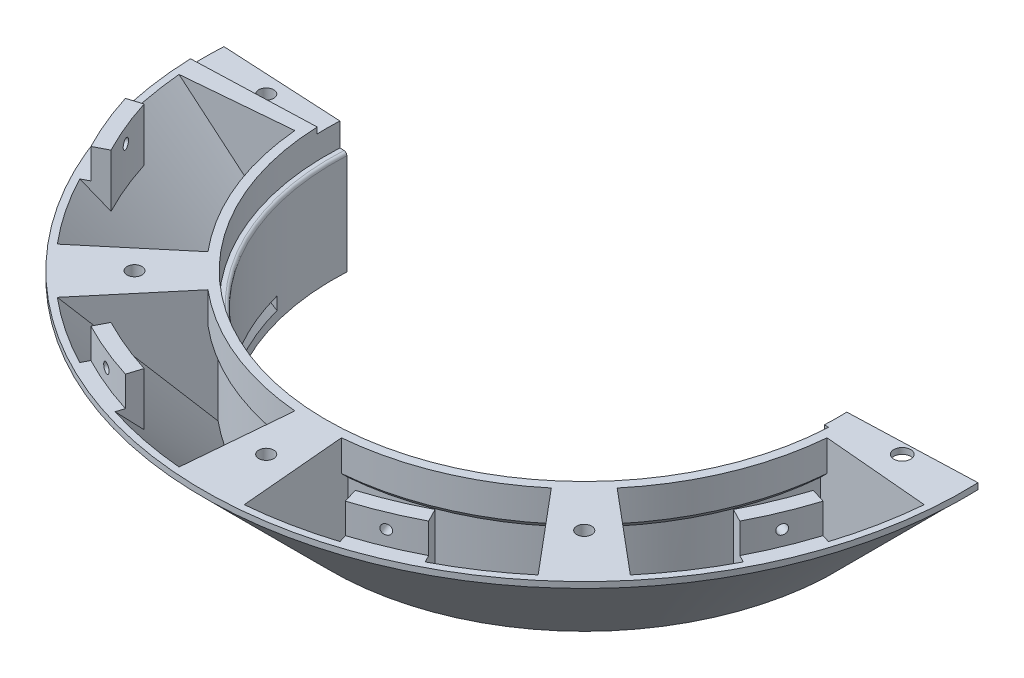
ISO-10303-21;
HEADER;
FILE_DESCRIPTION(('STEP AP214'),'2;1');
FILE_NAME('part.step','',(''),(''),'','','');
FILE_SCHEMA(('AUTOMOTIVE_DESIGN { 1 0 10303 214 1 1 1 1 }'));
ENDSEC;
DATA;
#1=APPLICATION_CONTEXT('core data for automotive mechanical design processes');
#2=APPLICATION_PROTOCOL_DEFINITION('international standard','automotive_design',2000,#1);
#3=PRODUCT_CONTEXT('',#1,'mechanical');
#4=PRODUCT('Part','Part','',(#3));
#5=PRODUCT_RELATED_PRODUCT_CATEGORY('part','',(#4));
#6=PRODUCT_DEFINITION_FORMATION('','',#4);
#7=PRODUCT_DEFINITION_CONTEXT('part definition',#1,'design');
#8=PRODUCT_DEFINITION('design','',#6,#7);
#9=PRODUCT_DEFINITION_SHAPE('','',#8);
#10=(LENGTH_UNIT() NAMED_UNIT(*) SI_UNIT(.MILLI.,.METRE.));
#11=(NAMED_UNIT(*) PLANE_ANGLE_UNIT() SI_UNIT($,.RADIAN.));
#12=(NAMED_UNIT(*) SI_UNIT($,.STERADIAN.) SOLID_ANGLE_UNIT());
#13=UNCERTAINTY_MEASURE_WITH_UNIT(LENGTH_MEASURE(1.E-05),#10,'distance_accuracy_value','');
#14=(GEOMETRIC_REPRESENTATION_CONTEXT(3) GLOBAL_UNCERTAINTY_ASSIGNED_CONTEXT((#13)) GLOBAL_UNIT_ASSIGNED_CONTEXT((#10,
#11,#12)) REPRESENTATION_CONTEXT('',''));
#15=CARTESIAN_POINT('',(0.,0.,0.));
#16=DIRECTION('',(0.,0.,1.));
#17=DIRECTION('',(1.,0.,0.));
#18=AXIS2_PLACEMENT_3D('',#15,#16,#17);
#19=CARTESIAN_POINT('',(-161.703087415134,-31.3562999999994,-8.47449971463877));
#20=DIRECTION('',(0.0523359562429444,0.,-0.998629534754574));
#21=DIRECTION('',(-0.998629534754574,0.,-0.0523359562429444));
#22=AXIS2_PLACEMENT_3D('',#19,#20,#21);
#23=PLANE('',#22);
#24=DIRECTION('',(0.,-1.,0.));
#25=VECTOR('',#24,1.);
#26=CARTESIAN_POINT('',(109.641034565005,0.,5.74604313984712));
#27=LINE('',#26,#25);
#28=CARTESIAN_POINT('',(109.641034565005,12.7,5.74604313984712));
#29=VERTEX_POINT('',#28);
#30=CARTESIAN_POINT('',(109.641034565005,22.6060000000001,5.74604313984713));
#31=VERTEX_POINT('',#30);
#32=EDGE_CURVE('E540',#29,#31,#27,.F.);
#33=ORIENTED_EDGE('',*,*,#32,.T.);
#34=DIRECTION('',(-0.998629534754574,0.,-0.0523359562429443));
#35=VECTOR('',#34,1.);
#36=CARTESIAN_POINT('',(107.814740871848,22.6060000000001,5.65033114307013));
#37=LINE('',#36,#35);
#38=CARTESIAN_POINT('',(161.703087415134,22.6060000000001,8.47449971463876));
#39=VERTEX_POINT('',#38);
#40=EDGE_CURVE('E919',#39,#31,#37,.T.);
#41=ORIENTED_EDGE('',*,*,#40,.F.);
#42=DIRECTION('',(-0.70613771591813,-0.707106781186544,-0.0370071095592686));
#43=VECTOR('',#42,1.);
#44=CARTESIAN_POINT('',(0.,-139.318999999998,0.));
#45=LINE('',#44,#43);
#46=CARTESIAN_POINT('',(107.814740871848,-31.3562999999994,5.65033114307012));
#47=VERTEX_POINT('',#46);
#48=EDGE_CURVE('E543',#39,#47,#45,.T.);
#49=ORIENTED_EDGE('',*,*,#48,.T.);
#50=DIRECTION('',(-0.998629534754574,0.,-0.0523359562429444));
#51=VECTOR('',#50,1.);
#52=CARTESIAN_POINT('',(-161.703087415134,-31.3562999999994,-8.47449971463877));
#53=LINE('',#52,#51);
#54=CARTESIAN_POINT('',(106.546481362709,-31.3562999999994,5.58386447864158));
#55=VERTEX_POINT('',#54);
#56=EDGE_CURVE('E532',#47,#55,#53,.T.);
#57=ORIENTED_EDGE('',*,*,#56,.T.);
#58=DIRECTION('',(0.,-1.,0.));
#59=VECTOR('',#58,1.);
#60=CARTESIAN_POINT('',(106.546481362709,0.,5.58386447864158));
#61=LINE('',#60,#59);
#62=CARTESIAN_POINT('',(106.546481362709,11.43,5.58386447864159));
#63=VERTEX_POINT('',#62);
#64=EDGE_CURVE('E57',#55,#63,#61,.F.);
#65=ORIENTED_EDGE('',*,*,#64,.T.);
#66=CARTESIAN_POINT('',(107.814740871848,11.43,5.65033114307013));
#67=DIRECTION('',(0.0523359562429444,0.,-0.998629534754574));
#68=DIRECTION('',(-0.998629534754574,0.,-0.0523359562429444));
#69=AXIS2_PLACEMENT_3D('',#66,#67,#68);
#70=CIRCLE('',#69,1.27);
#71=CARTESIAN_POINT('',(107.814740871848,12.7,5.65033114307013));
#72=VERTEX_POINT('',#71);
#73=EDGE_CURVE('E951',#63,#72,#70,.T.);
#74=ORIENTED_EDGE('',*,*,#73,.T.);
#75=DIRECTION('',(0.998629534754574,0.,0.0523359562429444));
#76=VECTOR('',#75,1.);
#77=CARTESIAN_POINT('',(-109.490775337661,12.7,-5.73816838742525));
#78=LINE('',#77,#76);
#79=EDGE_CURVE('E536',#72,#29,#78,.T.);
#80=ORIENTED_EDGE('',*,*,#79,.T.);
#81=EDGE_LOOP('',(#33,#41,#49,#57,#65,#74,#80));
#82=FACE_BOUND('',#81,.T.);
#83=ADVANCED_FACE('F33',(#82),#23,.T.);
#84=DIRECTION('',(-0.70613771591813,0.707106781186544,-0.0370071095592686));
#85=VECTOR('',#84,1.);
#86=CARTESIAN_POINT('',(0.,-139.318999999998,0.));
#87=LINE('',#86,#85);
#88=CARTESIAN_POINT('',(-107.814740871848,-31.3562999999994,-5.65033114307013));
#89=VERTEX_POINT('',#88);
#90=CARTESIAN_POINT('',(-161.703087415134,22.6060000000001,-8.47449971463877));
#91=VERTEX_POINT('',#90);
#92=EDGE_CURVE('E547',#89,#91,#87,.T.);
#93=ORIENTED_EDGE('',*,*,#92,.T.);
#94=DIRECTION('',(0.998629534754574,0.,0.0523359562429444));
#95=VECTOR('',#94,1.);
#96=CARTESIAN_POINT('',(-161.703087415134,22.6060000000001,-8.47449971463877));
#97=LINE('',#96,#95);
#98=CARTESIAN_POINT('',(-109.641034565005,22.6060000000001,-5.74604313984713));
#99=VERTEX_POINT('',#98);
#100=EDGE_CURVE('E42',#91,#99,#97,.T.);
#101=ORIENTED_EDGE('',*,*,#100,.T.);
#102=DIRECTION('',(0.,-1.,0.));
#103=VECTOR('',#102,1.);
#104=CARTESIAN_POINT('',(-109.641034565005,0.,-5.74604313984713));
#105=LINE('',#104,#103);
#106=CARTESIAN_POINT('',(-109.641034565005,12.7,-5.74604313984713));
#107=VERTEX_POINT('',#106);
#108=EDGE_CURVE('E535',#99,#107,#105,.T.);
#109=ORIENTED_EDGE('',*,*,#108,.T.);
#110=CARTESIAN_POINT('',(-107.814740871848,12.7,-5.65033114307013));
#111=VERTEX_POINT('',#110);
#112=EDGE_CURVE('E533',#107,#111,#78,.T.);
#113=ORIENTED_EDGE('',*,*,#112,.T.);
#114=CARTESIAN_POINT('',(-107.814740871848,11.43,-5.65033114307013));
#115=DIRECTION('',(0.0523359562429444,0.,-0.998629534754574));
#116=DIRECTION('',(-0.998629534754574,0.,-0.0523359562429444));
#117=AXIS2_PLACEMENT_3D('',#114,#115,#116);
#118=CIRCLE('',#117,1.27);
#119=CARTESIAN_POINT('',(-106.546481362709,11.43,-5.58386447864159));
#120=VERTEX_POINT('',#119);
#121=EDGE_CURVE('E586',#111,#120,#118,.T.);
#122=ORIENTED_EDGE('',*,*,#121,.T.);
#123=DIRECTION('',(0.,-1.,0.));
#124=VECTOR('',#123,1.);
#125=CARTESIAN_POINT('',(-106.546481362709,0.,-5.58386447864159));
#126=LINE('',#125,#124);
#127=CARTESIAN_POINT('',(-106.546481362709,-31.3562999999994,-5.58386447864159));
#128=VERTEX_POINT('',#127);
#129=EDGE_CURVE('E538',#120,#128,#126,.T.);
#130=ORIENTED_EDGE('',*,*,#129,.T.);
#131=EDGE_CURVE('E530',#128,#89,#53,.T.);
#132=ORIENTED_EDGE('',*,*,#131,.T.);
#133=EDGE_LOOP('',(#93,#101,#109,#113,#122,#130,#132));
#134=FACE_BOUND('',#133,.T.);
#135=ADVANCED_FACE('F574',(#134),#23,.T.);
#136=CARTESIAN_POINT('',(0.,0.,0.));
#137=DIRECTION('',(0.,-1.,0.));
#138=DIRECTION('',(0.,0.,-1.));
#139=AXIS2_PLACEMENT_3D('',#136,#137,#138);
#140=CYLINDRICAL_SURFACE('',#139,106.6927);
#141=DIRECTION('',(0.,1.,0.));
#142=VECTOR('',#141,1.);
#143=CARTESIAN_POINT('',(-53.3463500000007,-27.2381463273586,92.3985885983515));
#144=LINE('',#143,#142);
#145=CARTESIAN_POINT('',(-53.3463500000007,-27.2381463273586,92.3985885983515));
#146=VERTEX_POINT('',#145);
#147=CARTESIAN_POINT('',(-53.3463500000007,-21.8499926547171,92.3985885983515));
#148=VERTEX_POINT('',#147);
#149=EDGE_CURVE('E1241',#146,#148,#144,.T.);
#150=ORIENTED_EDGE('',*,*,#149,.F.);
#151=CARTESIAN_POINT('',(0.,-27.2381463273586,0.));
#152=DIRECTION('',(0.,1.,0.));
#153=DIRECTION('',(-0.707106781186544,0.,-0.707106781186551));
#154=AXIS2_PLACEMENT_3D('',#151,#152,#153);
#155=CIRCLE('',#154,106.6927);
#156=CARTESIAN_POINT('',(-27.6141027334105,-27.2381463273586,103.057234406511));
#157=VERTEX_POINT('',#156);
#158=EDGE_CURVE('E1235',#146,#157,#155,.T.);
#159=ORIENTED_EDGE('',*,*,#158,.T.);
#160=DIRECTION('',(0.,1.,0.));
#161=VECTOR('',#160,1.);
#162=CARTESIAN_POINT('',(-27.6141027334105,-27.2381463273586,103.057234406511));
#163=LINE('',#162,#161);
#164=CARTESIAN_POINT('',(-27.6141027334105,-21.8499926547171,103.057234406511));
#165=VERTEX_POINT('',#164);
#166=EDGE_CURVE('E1250',#157,#165,#163,.T.);
#167=ORIENTED_EDGE('',*,*,#166,.T.);
#168=CARTESIAN_POINT('',(0.,-21.8499926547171,0.));
#169=DIRECTION('',(0.,1.,0.));
#170=DIRECTION('',(-0.707106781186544,0.,-0.707106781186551));
#171=AXIS2_PLACEMENT_3D('',#168,#169,#170);
#172=CIRCLE('',#171,106.6927);
#173=EDGE_CURVE('E1232',#148,#165,#172,.T.);
#174=ORIENTED_EDGE('',*,*,#173,.F.);
#175=EDGE_LOOP('',(#150,#159,#167,#174));
#176=FACE_BOUND('',#175,.T.);
#177=DIRECTION('',(0.,1.,0.));
#178=VECTOR('',#177,1.);
#179=CARTESIAN_POINT('',(92.3985885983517,-27.2381463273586,53.3463500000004));
#180=LINE('',#179,#178);
#181=CARTESIAN_POINT('',(92.3985885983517,-27.2381463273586,53.3463500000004));
#182=VERTEX_POINT('',#181);
#183=CARTESIAN_POINT('',(92.3985885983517,-21.8499926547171,53.3463500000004));
#184=VERTEX_POINT('',#183);
#185=EDGE_CURVE('E1183',#182,#184,#180,.T.);
#186=ORIENTED_EDGE('',*,*,#185,.F.);
#187=CARTESIAN_POINT('',(0.,-27.2381463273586,0.));
#188=DIRECTION('',(0.,1.,0.));
#189=DIRECTION('',(-0.707106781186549,0.,0.707106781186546));
#190=AXIS2_PLACEMENT_3D('',#187,#188,#189);
#191=CIRCLE('',#190,106.6927);
#192=CARTESIAN_POINT('',(103.057234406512,-27.2381463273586,27.6141027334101));
#193=VERTEX_POINT('',#192);
#194=EDGE_CURVE('E1177',#182,#193,#191,.T.);
#195=ORIENTED_EDGE('',*,*,#194,.T.);
#196=DIRECTION('',(0.,1.,0.));
#197=VECTOR('',#196,1.);
#198=CARTESIAN_POINT('',(103.057234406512,-27.2381463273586,27.6141027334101));
#199=LINE('',#198,#197);
#200=CARTESIAN_POINT('',(103.057234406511,-21.8499926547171,27.6141027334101));
#201=VERTEX_POINT('',#200);
#202=EDGE_CURVE('E1192',#193,#201,#199,.T.);
#203=ORIENTED_EDGE('',*,*,#202,.T.);
#204=CARTESIAN_POINT('',(0.,-21.8499926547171,0.));
#205=DIRECTION('',(0.,1.,0.));
#206=DIRECTION('',(-0.707106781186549,0.,0.707106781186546));
#207=AXIS2_PLACEMENT_3D('',#204,#205,#206);
#208=CIRCLE('',#207,106.6927);
#209=EDGE_CURVE('E1174',#184,#201,#208,.T.);
#210=ORIENTED_EDGE('',*,*,#209,.F.);
#211=EDGE_LOOP('',(#186,#195,#203,#210));
#212=FACE_BOUND('',#211,.T.);
#213=DIRECTION('',(0.,1.,0.));
#214=VECTOR('',#213,1.);
#215=CARTESIAN_POINT('',(27.6141027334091,-27.2381463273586,103.057234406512));
#216=LINE('',#215,#214);
#217=CARTESIAN_POINT('',(27.6141027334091,-27.2381463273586,103.057234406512));
#218=VERTEX_POINT('',#217);
#219=CARTESIAN_POINT('',(27.6141027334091,-21.8499926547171,103.057234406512));
#220=VERTEX_POINT('',#219);
#221=EDGE_CURVE('E1212',#218,#220,#216,.T.);
#222=ORIENTED_EDGE('',*,*,#221,.F.);
#223=CARTESIAN_POINT('',(0.,-27.2381463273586,0.));
#224=DIRECTION('',(0.,1.,0.));
#225=DIRECTION('',(-1.,0.,0.));
#226=AXIS2_PLACEMENT_3D('',#223,#224,#225);
#227=CIRCLE('',#226,106.6927);
#228=CARTESIAN_POINT('',(53.3463499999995,-27.2381463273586,92.3985885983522));
#229=VERTEX_POINT('',#228);
#230=EDGE_CURVE('E1206',#218,#229,#227,.T.);
#231=ORIENTED_EDGE('',*,*,#230,.T.);
#232=DIRECTION('',(0.,1.,0.));
#233=VECTOR('',#232,1.);
#234=CARTESIAN_POINT('',(53.3463499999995,-27.2381463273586,92.3985885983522));
#235=LINE('',#234,#233);
#236=CARTESIAN_POINT('',(53.3463499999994,-21.8499926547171,92.3985885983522));
#237=VERTEX_POINT('',#236);
#238=EDGE_CURVE('E1221',#229,#237,#235,.T.);
#239=ORIENTED_EDGE('',*,*,#238,.T.);
#240=CARTESIAN_POINT('',(0.,-21.8499926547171,0.));
#241=DIRECTION('',(0.,1.,0.));
#242=DIRECTION('',(-1.,0.,0.));
#243=AXIS2_PLACEMENT_3D('',#240,#241,#242);
#244=CIRCLE('',#243,106.6927);
#245=EDGE_CURVE('E1203',#220,#237,#244,.T.);
#246=ORIENTED_EDGE('',*,*,#245,.F.);
#247=EDGE_LOOP('',(#222,#231,#239,#246));
#248=FACE_BOUND('',#247,.T.);
#249=DIRECTION('',(0.,1.,0.));
#250=VECTOR('',#249,1.);
#251=CARTESIAN_POINT('',(-103.057234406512,-27.2381463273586,27.6141027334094));
#252=LINE('',#251,#250);
#253=CARTESIAN_POINT('',(-103.057234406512,-27.2381463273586,27.6141027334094));
#254=VERTEX_POINT('',#253);
#255=CARTESIAN_POINT('',(-103.057234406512,-21.8499926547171,27.6141027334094));
#256=VERTEX_POINT('',#255);
#257=EDGE_CURVE('E1270',#254,#256,#252,.T.);
#258=ORIENTED_EDGE('',*,*,#257,.F.);
#259=CARTESIAN_POINT('',(0.,-27.2381463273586,0.));
#260=DIRECTION('',(0.,1.,0.));
#261=DIRECTION('',(0.,0.,-1.));
#262=AXIS2_PLACEMENT_3D('',#259,#260,#261);
#263=CIRCLE('',#262,106.6927);
#264=CARTESIAN_POINT('',(-92.3985885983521,-27.2381463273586,53.3463499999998));
#265=VERTEX_POINT('',#264);
#266=EDGE_CURVE('E1264',#254,#265,#263,.T.);
#267=ORIENTED_EDGE('',*,*,#266,.T.);
#268=DIRECTION('',(0.,1.,0.));
#269=VECTOR('',#268,1.);
#270=CARTESIAN_POINT('',(-92.3985885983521,-27.2381463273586,53.3463499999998));
#271=LINE('',#270,#269);
#272=CARTESIAN_POINT('',(-92.398588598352,-21.8499926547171,53.3463499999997));
#273=VERTEX_POINT('',#272);
#274=EDGE_CURVE('E1279',#265,#273,#271,.T.);
#275=ORIENTED_EDGE('',*,*,#274,.T.);
#276=CARTESIAN_POINT('',(0.,-21.8499926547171,0.));
#277=DIRECTION('',(0.,1.,0.));
#278=DIRECTION('',(0.,0.,-1.));
#279=AXIS2_PLACEMENT_3D('',#276,#277,#278);
#280=CIRCLE('',#279,106.6927);
#281=EDGE_CURVE('E1261',#256,#273,#280,.T.);
#282=ORIENTED_EDGE('',*,*,#281,.F.);
#283=EDGE_LOOP('',(#258,#267,#275,#282));
#284=FACE_BOUND('',#283,.T.);
#285=ORIENTED_EDGE('',*,*,#64,.F.);
#286=CARTESIAN_POINT('',(0.,-31.3562999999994,0.));
#287=DIRECTION('',(0.,-1.,0.));
#288=DIRECTION('',(0.,0.,-1.));
#289=AXIS2_PLACEMENT_3D('',#286,#287,#288);
#290=CIRCLE('',#289,106.6927);
#291=EDGE_CURVE('E950',#55,#128,#290,.T.);
#292=ORIENTED_EDGE('',*,*,#291,.T.);
#293=ORIENTED_EDGE('',*,*,#129,.F.);
#294=CARTESIAN_POINT('',(0.,11.43,0.));
#295=DIRECTION('',(0.,-1.,0.));
#296=DIRECTION('',(0.,0.,-1.));
#297=AXIS2_PLACEMENT_3D('',#294,#295,#296);
#298=CIRCLE('',#297,106.6927);
#299=EDGE_CURVE('E934',#63,#120,#298,.T.);
#300=ORIENTED_EDGE('',*,*,#299,.F.);
#301=EDGE_LOOP('',(#285,#292,#293,#300));
#302=FACE_BOUND('',#301,.T.);
#303=ADVANCED_FACE('F884',(#176,#212,#248,#284,#302),#140,.F.);
#304=CARTESIAN_POINT('',(-107.9627,-31.3562999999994,0.));
#305=DIRECTION('',(0.,1.,0.));
#306=DIRECTION('',(0.,0.,1.));
#307=AXIS2_PLACEMENT_3D('',#304,#305,#306);
#308=PLANE('',#307);
#309=ORIENTED_EDGE('',*,*,#56,.F.);
#310=CARTESIAN_POINT('',(0.,-31.3562999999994,0.));
#311=DIRECTION('',(0.,-1.,0.));
#312=DIRECTION('',(0.,0.,-1.));
#313=AXIS2_PLACEMENT_3D('',#310,#311,#312);
#314=CIRCLE('',#313,107.9627);
#315=EDGE_CURVE('E587',#47,#89,#314,.T.);
#316=ORIENTED_EDGE('',*,*,#315,.T.);
#317=ORIENTED_EDGE('',*,*,#131,.F.);
#318=ORIENTED_EDGE('',*,*,#291,.F.);
#319=EDGE_LOOP('',(#309,#316,#317,#318));
#320=FACE_BOUND('',#319,.T.);
#321=ADVANCED_FACE('F35',(#320),#308,.F.);
#322=CARTESIAN_POINT('',(0.,22.6060000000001,0.));
#323=DIRECTION('',(0.,1.,0.));
#324=DIRECTION('',(0.,0.,1.));
#325=AXIS2_PLACEMENT_3D('',#322,#323,#324);
#326=CONICAL_SURFACE('',#325,161.925,0.785398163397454);
#327=ORIENTED_EDGE('',*,*,#92,.F.);
#328=ORIENTED_EDGE('',*,*,#315,.F.);
#329=ORIENTED_EDGE('',*,*,#48,.F.);
#330=CARTESIAN_POINT('',(0.,22.6060000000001,0.));
#331=DIRECTION('',(0.,-1.,0.));
#332=DIRECTION('',(0.,0.,-1.));
#333=AXIS2_PLACEMENT_3D('',#330,#331,#332);
#334=CIRCLE('',#333,161.925);
#335=CARTESIAN_POINT('',(-161.826359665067,22.6060000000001,5.65110100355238));
#336=VERTEX_POINT('',#335);
#337=EDGE_CURVE('E486',#39,#336,#334,.T.);
#338=ORIENTED_EDGE('',*,*,#337,.T.);
#339=CARTESIAN_POINT('',(0.,22.6060000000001,0.));
#340=DIRECTION('',(0.,1.,0.));
#341=DIRECTION('',(0.,0.,1.));
#342=AXIS2_PLACEMENT_3D('',#339,#340,#341);
#343=CIRCLE('',#342,161.925);
#344=EDGE_CURVE('E519',#91,#336,#343,.T.);
#345=ORIENTED_EDGE('',*,*,#344,.F.);
#346=EDGE_LOOP('',(#327,#328,#329,#338,#345));
#347=FACE_BOUND('',#346,.T.);
#348=ADVANCED_FACE('F903',(#347),#326,.T.);
#349=CARTESIAN_POINT('',(0.,0.,0.));
#350=DIRECTION('',(0.,-1.,0.));
#351=DIRECTION('',(0.,0.,-1.));
#352=AXIS2_PLACEMENT_3D('',#349,#350,#351);
#353=CYLINDRICAL_SURFACE('',#352,161.925);
#354=CARTESIAN_POINT('',(0.,25.1460000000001,0.));
#355=DIRECTION('',(0.,-1.,0.));
#356=DIRECTION('',(0.,0.,-1.));
#357=AXIS2_PLACEMENT_3D('',#354,#355,#356);
#358=CIRCLE('',#357,161.925);
#359=CARTESIAN_POINT('',(161.826359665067,25.1460000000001,-5.65110100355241));
#360=VERTEX_POINT('',#359);
#361=CARTESIAN_POINT('',(-161.826359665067,25.1460000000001,5.65110100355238));
#362=VERTEX_POINT('',#361);
#363=EDGE_CURVE('E476',#360,#362,#358,.T.);
#364=ORIENTED_EDGE('',*,*,#363,.T.);
#365=DIRECTION('',(0.,1.,0.));
#366=VECTOR('',#365,1.);
#367=CARTESIAN_POINT('',(-161.826359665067,22.6060000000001,5.65110100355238));
#368=LINE('',#367,#366);
#369=EDGE_CURVE('E523',#336,#362,#368,.T.);
#370=ORIENTED_EDGE('',*,*,#369,.F.);
#371=ORIENTED_EDGE('',*,*,#337,.F.);
#372=CARTESIAN_POINT('',(0.,22.6060000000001,0.));
#373=DIRECTION('',(0.,1.,0.));
#374=DIRECTION('',(0.,0.,1.));
#375=AXIS2_PLACEMENT_3D('',#372,#373,#374);
#376=CIRCLE('',#375,161.925);
#377=CARTESIAN_POINT('',(161.826359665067,22.6060000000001,-5.65110100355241));
#378=VERTEX_POINT('',#377);
#379=EDGE_CURVE('E494',#378,#39,#376,.F.);
#380=ORIENTED_EDGE('',*,*,#379,.F.);
#381=DIRECTION('',(0.,1.,0.));
#382=VECTOR('',#381,1.);
#383=CARTESIAN_POINT('',(161.826359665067,-33.3176330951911,-5.65110100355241));
#384=LINE('',#383,#382);
#385=EDGE_CURVE('E491',#378,#360,#384,.T.);
#386=ORIENTED_EDGE('',*,*,#385,.T.);
#387=EDGE_LOOP('',(#364,#370,#371,#380,#386));
#388=FACE_BOUND('',#387,.T.);
#389=ADVANCED_FACE('F492',(#388),#353,.T.);
#390=CARTESIAN_POINT('',(-117.88380266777,25.1460000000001,0.));
#391=DIRECTION('',(0.,-1.,0.));
#392=DIRECTION('',(0.,0.,-1.));
#393=AXIS2_PLACEMENT_3D('',#390,#391,#392);
#394=PLANE('',#393);
#395=CARTESIAN_POINT('',(135.255,25.1460000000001,0.));
#396=DIRECTION('',(0.,1.,0.));
#397=DIRECTION('',(0.,0.,1.));
#398=AXIS2_PLACEMENT_3D('',#395,#396,#397);
#399=CIRCLE('',#398,3.57187499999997);
#400=CARTESIAN_POINT('',(135.255,25.1460000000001,3.57187499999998));
#401=VERTEX_POINT('',#400);
#402=EDGE_CURVE('E507',#401,#401,#399,.T.);
#403=ORIENTED_EDGE('',*,*,#402,.F.);
#404=EDGE_LOOP('',(#403));
#405=FACE_BOUND('',#404,.T.);
#406=CARTESIAN_POINT('',(95.6397276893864,25.1460000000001,95.6397276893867));
#407=DIRECTION('',(0.,1.,0.));
#408=DIRECTION('',(0.,0.,1.));
#409=AXIS2_PLACEMENT_3D('',#406,#407,#408);
#410=CIRCLE('',#409,3.175);
#411=CARTESIAN_POINT('',(95.6397276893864,25.1460000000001,98.8147276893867));
#412=VERTEX_POINT('',#411);
#413=EDGE_CURVE('E963',#412,#412,#410,.T.);
#414=ORIENTED_EDGE('',*,*,#413,.F.);
#415=EDGE_LOOP('',(#414));
#416=FACE_BOUND('',#415,.T.);
#417=CARTESIAN_POINT('',(-4.64732147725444E-13,25.1460000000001,135.255));
#418=DIRECTION('',(0.,1.,0.));
#419=DIRECTION('',(0.,0.,1.));
#420=AXIS2_PLACEMENT_3D('',#417,#418,#419);
#421=CIRCLE('',#420,3.17499999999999);
#422=CARTESIAN_POINT('',(-4.64732147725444E-13,25.1460000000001,138.43));
#423=VERTEX_POINT('',#422);
#424=EDGE_CURVE('E975',#423,#423,#421,.T.);
#425=ORIENTED_EDGE('',*,*,#424,.F.);
#426=EDGE_LOOP('',(#425));
#427=FACE_BOUND('',#426,.T.);
#428=CARTESIAN_POINT('',(-95.639727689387,25.1460000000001,95.639727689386));
#429=DIRECTION('',(0.,1.,0.));
#430=DIRECTION('',(0.,0.,1.));
#431=AXIS2_PLACEMENT_3D('',#428,#429,#430);
#432=CIRCLE('',#431,3.175);
#433=CARTESIAN_POINT('',(-95.639727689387,25.1460000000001,98.814727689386));
#434=VERTEX_POINT('',#433);
#435=EDGE_CURVE('E987',#434,#434,#432,.T.);
#436=ORIENTED_EDGE('',*,*,#435,.F.);
#437=EDGE_LOOP('',(#436));
#438=FACE_BOUND('',#437,.T.);
#439=CARTESIAN_POINT('',(0.,25.1460000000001,0.));
#440=DIRECTION('',(0.,1.,0.));
#441=DIRECTION('',(-0.707106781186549,0.,0.707106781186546));
#442=AXIS2_PLACEMENT_3D('',#439,#440,#441);
#443=CIRCLE('',#442,159.076846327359);
#444=CARTESIAN_POINT('',(121.859934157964,25.1460000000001,102.252625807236));
#445=VERTEX_POINT('',#444);
#446=CARTESIAN_POINT('',(141.102886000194,25.1460000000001,73.453513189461));
#447=VERTEX_POINT('',#446);
#448=EDGE_CURVE('E1010',#445,#447,#443,.T.);
#449=ORIENTED_EDGE('',*,*,#448,.F.);
#450=DIRECTION('',(0.766044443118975,0.,0.642787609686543));
#451=VECTOR('',#450,1.);
#452=CARTESIAN_POINT('',(121.859934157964,25.1460000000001,102.252625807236));
#453=LINE('',#452,#451);
#454=CARTESIAN_POINT('',(87.0237978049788,25.1460000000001,73.0216366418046));
#455=VERTEX_POINT('',#454);
#456=EDGE_CURVE('E1025',#455,#445,#453,.T.);
#457=ORIENTED_EDGE('',*,*,#456,.F.);
#458=CARTESIAN_POINT('',(0.,25.1460000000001,0.));
#459=DIRECTION('',(0.,1.,0.));
#460=DIRECTION('',(-0.707106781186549,0.,0.707106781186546));
#461=AXIS2_PLACEMENT_3D('',#458,#459,#460);
#462=CIRCLE('',#461,113.601499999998);
#463=CARTESIAN_POINT('',(113.169211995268,25.1460000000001,9.90102310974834));
#464=VERTEX_POINT('',#463);
#465=EDGE_CURVE('E999',#455,#464,#462,.T.);
#466=ORIENTED_EDGE('',*,*,#465,.T.);
#467=DIRECTION('',(0.996194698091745,0.,0.0871557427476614));
#468=VECTOR('',#467,1.);
#469=CARTESIAN_POINT('',(158.47151090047,25.1460000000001,13.8644606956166));
#470=LINE('',#469,#468);
#471=CARTESIAN_POINT('',(158.47151090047,25.1460000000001,13.8644606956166));
#472=VERTEX_POINT('',#471);
#473=EDGE_CURVE('E1039',#464,#472,#470,.T.);
#474=ORIENTED_EDGE('',*,*,#473,.T.);
#475=CARTESIAN_POINT('',(151.714284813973,25.1460000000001,47.8353302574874));
#476=VERTEX_POINT('',#475);
#477=EDGE_CURVE('E1012',#476,#472,#443,.T.);
#478=ORIENTED_EDGE('',*,*,#477,.F.);
#479=DIRECTION('',(0.953716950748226,0.,0.300705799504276));
#480=VECTOR('',#479,1.);
#481=CARTESIAN_POINT('',(148.374514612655,25.1460000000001,46.7823047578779));
#482=LINE('',#481,#480);
#483=CARTESIAN_POINT('',(148.374514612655,25.1460000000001,46.7823047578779));
#484=VERTEX_POINT('',#483);
#485=EDGE_CURVE('E1299',#484,#476,#482,.T.);
#486=ORIENTED_EDGE('',*,*,#485,.F.);
#487=CARTESIAN_POINT('',(0.,25.1460000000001,0.));
#488=DIRECTION('',(0.,-1.,0.));
#489=DIRECTION('',(0.707106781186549,0.,-0.707106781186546));
#490=AXIS2_PLACEMENT_3D('',#487,#488,#489);
#491=CIRCLE('',#490,155.575);
#492=CARTESIAN_POINT('',(137.996710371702,25.1460000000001,71.836540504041));
#493=VERTEX_POINT('',#492);
#494=EDGE_CURVE('E1291',#484,#493,#491,.T.);
#495=ORIENTED_EDGE('',*,*,#494,.T.);
#496=DIRECTION('',(0.88701083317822,0.,0.461748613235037));
#497=VECTOR('',#496,1.);
#498=CARTESIAN_POINT('',(137.996710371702,25.1460000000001,71.836540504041));
#499=LINE('',#498,#497);
#500=EDGE_CURVE('E1313',#493,#447,#499,.T.);
#501=ORIENTED_EDGE('',*,*,#500,.T.);
#502=EDGE_LOOP('',(#449,#457,#466,#474,#478,#486,#495,#501));
#503=FACE_BOUND('',#502,.T.);
#504=CARTESIAN_POINT('',(0.,25.1460000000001,0.));
#505=DIRECTION('',(0.,1.,0.));
#506=DIRECTION('',(-1.,0.,0.));
#507=AXIS2_PLACEMENT_3D('',#504,#505,#506);
#508=CIRCLE('',#507,159.076846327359);
#509=CARTESIAN_POINT('',(13.8644606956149,25.1460000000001,158.47151090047));
#510=VERTEX_POINT('',#509);
#511=CARTESIAN_POINT('',(47.8353302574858,25.1460000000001,151.714284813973));
#512=VERTEX_POINT('',#511);
#513=EDGE_CURVE('E1053',#510,#512,#508,.T.);
#514=ORIENTED_EDGE('',*,*,#513,.F.);
#515=DIRECTION('',(0.0871557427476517,0.,0.996194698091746));
#516=VECTOR('',#515,1.);
#517=CARTESIAN_POINT('',(13.8644606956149,25.1460000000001,158.47151090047));
#518=LINE('',#517,#516);
#519=CARTESIAN_POINT('',(9.90102310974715,25.1460000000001,113.169211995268));
#520=VERTEX_POINT('',#519);
#521=EDGE_CURVE('E1068',#520,#510,#518,.T.);
#522=ORIENTED_EDGE('',*,*,#521,.F.);
#523=CARTESIAN_POINT('',(0.,25.1460000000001,0.));
#524=DIRECTION('',(0.,1.,0.));
#525=DIRECTION('',(-1.,0.,0.));
#526=AXIS2_PLACEMENT_3D('',#523,#524,#525);
#527=CIRCLE('',#526,113.601499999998);
#528=CARTESIAN_POINT('',(73.0216366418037,25.1460000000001,87.0237978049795));
#529=VERTEX_POINT('',#528);
#530=EDGE_CURVE('E1042',#520,#529,#527,.T.);
#531=ORIENTED_EDGE('',*,*,#530,.T.);
#532=DIRECTION('',(0.642787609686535,0.,0.766044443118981));
#533=VECTOR('',#532,1.);
#534=CARTESIAN_POINT('',(102.252625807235,25.1460000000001,121.859934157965));
#535=LINE('',#534,#533);
#536=CARTESIAN_POINT('',(102.252625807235,25.1460000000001,121.859934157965));
#537=VERTEX_POINT('',#536);
#538=EDGE_CURVE('E1082',#529,#537,#535,.T.);
#539=ORIENTED_EDGE('',*,*,#538,.T.);
#540=CARTESIAN_POINT('',(73.4535131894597,25.1460000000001,141.102886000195));
#541=VERTEX_POINT('',#540);
#542=EDGE_CURVE('E1055',#541,#537,#508,.T.);
#543=ORIENTED_EDGE('',*,*,#542,.F.);
#544=DIRECTION('',(0.46174861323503,0.,0.887010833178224));
#545=VECTOR('',#544,1.);
#546=CARTESIAN_POINT('',(71.8365405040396,25.1460000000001,137.996710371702));
#547=LINE('',#546,#545);
#548=CARTESIAN_POINT('',(71.8365405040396,25.1460000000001,137.996710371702));
#549=VERTEX_POINT('',#548);
#550=EDGE_CURVE('E1337',#549,#541,#547,.T.);
#551=ORIENTED_EDGE('',*,*,#550,.F.);
#552=CARTESIAN_POINT('',(0.,25.1460000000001,0.));
#553=DIRECTION('',(0.,-1.,0.));
#554=DIRECTION('',(1.,0.,0.));
#555=AXIS2_PLACEMENT_3D('',#552,#553,#554);
#556=CIRCLE('',#555,155.575);
#557=CARTESIAN_POINT('',(46.7823047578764,25.1460000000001,148.374514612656));
#558=VERTEX_POINT('',#557);
#559=EDGE_CURVE('E1329',#549,#558,#556,.T.);
#560=ORIENTED_EDGE('',*,*,#559,.T.);
#561=DIRECTION('',(0.300705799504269,0.,0.953716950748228));
#562=VECTOR('',#561,1.);
#563=CARTESIAN_POINT('',(46.7823047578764,25.1460000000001,148.374514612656));
#564=LINE('',#563,#562);
#565=EDGE_CURVE('E1351',#558,#512,#564,.T.);
#566=ORIENTED_EDGE('',*,*,#565,.T.);
#567=EDGE_LOOP('',(#514,#522,#531,#539,#543,#551,#560,#566));
#568=FACE_BOUND('',#567,.T.);
#569=CARTESIAN_POINT('',(0.,25.1460000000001,0.));
#570=DIRECTION('',(0.,1.,0.));
#571=DIRECTION('',(-0.707106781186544,0.,-0.707106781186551));
#572=AXIS2_PLACEMENT_3D('',#569,#570,#571);
#573=CIRCLE('',#572,159.076846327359);
#574=CARTESIAN_POINT('',(-102.252625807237,25.1460000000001,121.859934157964));
#575=VERTEX_POINT('',#574);
#576=CARTESIAN_POINT('',(-73.4535131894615,25.1460000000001,141.102886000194));
#577=VERTEX_POINT('',#576);
#578=EDGE_CURVE('E1096',#575,#577,#573,.T.);
#579=ORIENTED_EDGE('',*,*,#578,.F.);
#580=DIRECTION('',(-0.642787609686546,0.,0.766044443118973));
#581=VECTOR('',#580,1.);
#582=CARTESIAN_POINT('',(-102.252625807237,25.1460000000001,121.859934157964));
#583=LINE('',#582,#581);
#584=CARTESIAN_POINT('',(-73.0216366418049,25.1460000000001,87.0237978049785));
#585=VERTEX_POINT('',#584);
#586=EDGE_CURVE('E1111',#585,#575,#583,.T.);
#587=ORIENTED_EDGE('',*,*,#586,.F.);
#588=CARTESIAN_POINT('',(0.,25.1460000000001,0.));
#589=DIRECTION('',(0.,1.,0.));
#590=DIRECTION('',(-0.707106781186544,0.,-0.707106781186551));
#591=AXIS2_PLACEMENT_3D('',#588,#589,#590);
#592=CIRCLE('',#591,113.601499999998);
#593=CARTESIAN_POINT('',(-9.90102310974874,25.1460000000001,113.169211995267));
#594=VERTEX_POINT('',#593);
#595=EDGE_CURVE('E1085',#585,#594,#592,.T.);
#596=ORIENTED_EDGE('',*,*,#595,.T.);
#597=DIRECTION('',(-0.087155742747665,0.,0.996194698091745));
#598=VECTOR('',#597,1.);
#599=CARTESIAN_POINT('',(-13.8644606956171,25.1460000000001,158.47151090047));
#600=LINE('',#599,#598);
#601=CARTESIAN_POINT('',(-13.8644606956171,25.1460000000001,158.47151090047));
#602=VERTEX_POINT('',#601);
#603=EDGE_CURVE('E1125',#594,#602,#600,.T.);
#604=ORIENTED_EDGE('',*,*,#603,.T.);
#605=CARTESIAN_POINT('',(-47.8353302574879,25.1460000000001,151.714284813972));
#606=VERTEX_POINT('',#605);
#607=EDGE_CURVE('E1098',#606,#602,#573,.T.);
#608=ORIENTED_EDGE('',*,*,#607,.F.);
#609=DIRECTION('',(-0.300705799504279,0.,0.953716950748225));
#610=VECTOR('',#609,1.);
#611=CARTESIAN_POINT('',(-46.7823047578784,25.1460000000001,148.374514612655));
#612=LINE('',#611,#610);
#613=CARTESIAN_POINT('',(-46.7823047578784,25.1460000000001,148.374514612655));
#614=VERTEX_POINT('',#613);
#615=EDGE_CURVE('E1375',#614,#606,#612,.T.);
#616=ORIENTED_EDGE('',*,*,#615,.F.);
#617=CARTESIAN_POINT('',(0.,25.1460000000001,0.));
#618=DIRECTION('',(0.,-1.,0.));
#619=DIRECTION('',(0.707106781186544,0.,0.707106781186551));
#620=AXIS2_PLACEMENT_3D('',#617,#618,#619);
#621=CIRCLE('',#620,155.575);
#622=CARTESIAN_POINT('',(-71.8365405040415,25.1460000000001,137.996710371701));
#623=VERTEX_POINT('',#622);
#624=EDGE_CURVE('E1367',#614,#623,#621,.T.);
#625=ORIENTED_EDGE('',*,*,#624,.T.);
#626=DIRECTION('',(-0.46174861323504,0.,0.887010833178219));
#627=VECTOR('',#626,1.);
#628=CARTESIAN_POINT('',(-71.8365405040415,25.1460000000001,137.996710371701));
#629=LINE('',#628,#627);
#630=EDGE_CURVE('E1389',#623,#577,#629,.T.);
#631=ORIENTED_EDGE('',*,*,#630,.T.);
#632=EDGE_LOOP('',(#579,#587,#596,#604,#608,#616,#625,#631));
#633=FACE_BOUND('',#632,.T.);
#634=CARTESIAN_POINT('',(0.,25.1460000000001,0.));
#635=DIRECTION('',(0.,1.,0.));
#636=DIRECTION('',(0.,0.,-1.));
#637=AXIS2_PLACEMENT_3D('',#634,#635,#636);
#638=CIRCLE('',#637,159.076846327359);
#639=CARTESIAN_POINT('',(-158.47151090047,25.1460000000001,13.8644606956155));
#640=VERTEX_POINT('',#639);
#641=CARTESIAN_POINT('',(-151.714284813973,25.1460000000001,47.8353302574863));
#642=VERTEX_POINT('',#641);
#643=EDGE_CURVE('E1139',#640,#642,#638,.T.);
#644=ORIENTED_EDGE('',*,*,#643,.F.);
#645=DIRECTION('',(-0.996194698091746,0.,0.0871557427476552));
#646=VECTOR('',#645,1.);
#647=CARTESIAN_POINT('',(-158.47151090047,25.1460000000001,13.8644606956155));
#648=LINE('',#647,#646);
#649=CARTESIAN_POINT('',(-113.169211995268,25.1460000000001,9.90102310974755));
#650=VERTEX_POINT('',#649);
#651=EDGE_CURVE('E1154',#650,#640,#648,.T.);
#652=ORIENTED_EDGE('',*,*,#651,.F.);
#653=CARTESIAN_POINT('',(0.,25.1460000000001,0.));
#654=DIRECTION('',(0.,1.,0.));
#655=DIRECTION('',(0.,0.,-1.));
#656=AXIS2_PLACEMENT_3D('',#653,#654,#655);
#657=CIRCLE('',#656,113.601499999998);
#658=CARTESIAN_POINT('',(-87.0237978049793,25.1460000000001,73.021636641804));
#659=VERTEX_POINT('',#658);
#660=EDGE_CURVE('E1128',#650,#659,#657,.T.);
#661=ORIENTED_EDGE('',*,*,#660,.T.);
#662=DIRECTION('',(-0.766044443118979,0.,0.642787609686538));
#663=VECTOR('',#662,1.);
#664=CARTESIAN_POINT('',(-121.859934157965,25.1460000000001,102.252625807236));
#665=LINE('',#664,#663);
#666=CARTESIAN_POINT('',(-121.859934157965,25.1460000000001,102.252625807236));
#667=VERTEX_POINT('',#666);
#668=EDGE_CURVE('E1168',#659,#667,#665,.T.);
#669=ORIENTED_EDGE('',*,*,#668,.T.);
#670=CARTESIAN_POINT('',(-141.102886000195,25.1460000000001,73.4535131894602));
#671=VERTEX_POINT('',#670);
#672=EDGE_CURVE('E1141',#671,#667,#638,.T.);
#673=ORIENTED_EDGE('',*,*,#672,.F.);
#674=DIRECTION('',(-0.887010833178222,0.,0.461748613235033));
#675=VECTOR('',#674,1.);
#676=CARTESIAN_POINT('',(-137.996710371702,25.1460000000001,71.8365405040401));
#677=LINE('',#676,#675);
#678=CARTESIAN_POINT('',(-137.996710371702,25.1460000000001,71.8365405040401));
#679=VERTEX_POINT('',#678);
#680=EDGE_CURVE('E1413',#679,#671,#677,.T.);
#681=ORIENTED_EDGE('',*,*,#680,.F.);
#682=CARTESIAN_POINT('',(0.,25.1460000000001,0.));
#683=DIRECTION('',(0.,-1.,0.));
#684=DIRECTION('',(0.,0.,1.));
#685=AXIS2_PLACEMENT_3D('',#682,#683,#684);
#686=CIRCLE('',#685,155.575);
#687=CARTESIAN_POINT('',(-148.374514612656,25.1460000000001,46.7823047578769));
#688=VERTEX_POINT('',#687);
#689=EDGE_CURVE('E1405',#679,#688,#686,.T.);
#690=ORIENTED_EDGE('',*,*,#689,.T.);
#691=DIRECTION('',(-0.953716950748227,0.,0.300705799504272));
#692=VECTOR('',#691,1.);
#693=CARTESIAN_POINT('',(-148.374514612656,25.1460000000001,46.7823047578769));
#694=LINE('',#693,#692);
#695=EDGE_CURVE('E1427',#688,#642,#694,.T.);
#696=ORIENTED_EDGE('',*,*,#695,.T.);
#697=EDGE_LOOP('',(#644,#652,#661,#669,#673,#681,#690,#696));
#698=FACE_BOUND('',#697,.T.);
#699=CARTESIAN_POINT('',(0.,25.1460000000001,0.));
#700=DIRECTION('',(0.,-1.,0.));
#701=DIRECTION('',(0.,0.,-1.));
#702=AXIS2_PLACEMENT_3D('',#699,#700,#701);
#703=CIRCLE('',#702,109.791499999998);
#704=CARTESIAN_POINT('',(109.641034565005,25.1460000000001,5.74604313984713));
#705=VERTEX_POINT('',#704);
#706=CARTESIAN_POINT('',(-109.724617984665,25.1460000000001,3.83166809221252));
#707=VERTEX_POINT('',#706);
#708=EDGE_CURVE('E487',#705,#707,#703,.T.);
#709=ORIENTED_EDGE('',*,*,#708,.T.);
#710=DIRECTION('',(0.999390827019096,0.,-0.0348994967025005));
#711=VECTOR('',#710,1.);
#712=CARTESIAN_POINT('',(-161.826359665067,25.1460000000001,5.6511010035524));
#713=LINE('',#712,#711);
#714=EDGE_CURVE('E483',#362,#707,#713,.T.);
#715=ORIENTED_EDGE('',*,*,#714,.F.);
#716=ORIENTED_EDGE('',*,*,#363,.F.);
#717=DIRECTION('',(-0.999390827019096,0.,0.0348994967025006));
#718=VECTOR('',#717,1.);
#719=CARTESIAN_POINT('',(107.896932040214,25.1460000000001,-3.76784389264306));
#720=LINE('',#719,#718);
#721=CARTESIAN_POINT('',(107.896932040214,25.1460000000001,-3.76784389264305));
#722=VERTEX_POINT('',#721);
#723=EDGE_CURVE('E482',#360,#722,#720,.T.);
#724=ORIENTED_EDGE('',*,*,#723,.T.);
#725=CARTESIAN_POINT('',(0.,25.1460000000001,0.));
#726=DIRECTION('',(0.,-1.,0.));
#727=DIRECTION('',(0.,0.,1.));
#728=AXIS2_PLACEMENT_3D('',#725,#726,#727);
#729=CIRCLE('',#728,107.9627);
#730=CARTESIAN_POINT('',(107.814740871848,25.1460000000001,5.65033114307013));
#731=VERTEX_POINT('',#730);
#732=EDGE_CURVE('E503',#722,#731,#729,.T.);
#733=ORIENTED_EDGE('',*,*,#732,.T.);
#734=DIRECTION('',(0.998629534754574,0.,0.0523359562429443));
#735=VECTOR('',#734,1.);
#736=CARTESIAN_POINT('',(107.814740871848,25.1460000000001,5.65033114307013));
#737=LINE('',#736,#735);
#738=EDGE_CURVE('E498',#731,#705,#737,.T.);
#739=ORIENTED_EDGE('',*,*,#738,.T.);
#740=EDGE_LOOP('',(#709,#715,#716,#724,#733,#739));
#741=FACE_BOUND('',#740,.T.);
#742=ADVANCED_FACE('F479',(#405,#416,#427,#438,#503,#568,#633,#698,#741),#394,.F.);
#743=CARTESIAN_POINT('',(0.,0.,0.));
#744=DIRECTION('',(0.,-1.,0.));
#745=DIRECTION('',(0.,0.,-1.));
#746=AXIS2_PLACEMENT_3D('',#743,#744,#745);
#747=CYLINDRICAL_SURFACE('',#746,109.791499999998);
#748=CARTESIAN_POINT('',(0.,22.6060000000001,0.));
#749=DIRECTION('',(0.,1.,0.));
#750=DIRECTION('',(0.,0.,1.));
#751=AXIS2_PLACEMENT_3D('',#748,#749,#750);
#752=CIRCLE('',#751,109.791499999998);
#753=CARTESIAN_POINT('',(-109.724617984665,22.6060000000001,3.83166809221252));
#754=VERTEX_POINT('',#753);
#755=EDGE_CURVE('E49',#754,#99,#752,.F.);
#756=ORIENTED_EDGE('',*,*,#755,.F.);
#757=DIRECTION('',(0.,-1.,0.));
#758=VECTOR('',#757,1.);
#759=CARTESIAN_POINT('',(-109.724617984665,0.,3.83166809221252));
#760=LINE('',#759,#758);
#761=EDGE_CURVE('E11',#754,#707,#760,.F.);
#762=ORIENTED_EDGE('',*,*,#761,.T.);
#763=ORIENTED_EDGE('',*,*,#708,.F.);
#764=EDGE_CURVE('E544',#31,#705,#27,.F.);
#765=ORIENTED_EDGE('',*,*,#764,.F.);
#766=ORIENTED_EDGE('',*,*,#32,.F.);
#767=CARTESIAN_POINT('',(0.,12.7,0.));
#768=DIRECTION('',(0.,-1.,0.));
#769=DIRECTION('',(0.,0.,-1.));
#770=AXIS2_PLACEMENT_3D('',#767,#768,#769);
#771=CIRCLE('',#770,109.791499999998);
#772=EDGE_CURVE('E926',#29,#107,#771,.T.);
#773=ORIENTED_EDGE('',*,*,#772,.T.);
#774=ORIENTED_EDGE('',*,*,#108,.F.);
#775=EDGE_LOOP('',(#756,#762,#763,#765,#766,#773,#774));
#776=FACE_BOUND('',#775,.T.);
#777=ADVANCED_FACE('F894',(#776),#747,.F.);
#778=CARTESIAN_POINT('',(-109.791499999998,12.7,0.));
#779=DIRECTION('',(0.,-1.,0.));
#780=DIRECTION('',(0.,0.,-1.));
#781=AXIS2_PLACEMENT_3D('',#778,#779,#780);
#782=PLANE('',#781);
#783=ORIENTED_EDGE('',*,*,#112,.F.);
#784=ORIENTED_EDGE('',*,*,#772,.F.);
#785=ORIENTED_EDGE('',*,*,#79,.F.);
#786=CARTESIAN_POINT('',(0.,12.7,0.));
#787=DIRECTION('',(0.,-1.,0.));
#788=DIRECTION('',(0.,0.,-1.));
#789=AXIS2_PLACEMENT_3D('',#786,#787,#788);
#790=CIRCLE('',#789,107.9627);
#791=EDGE_CURVE('E931',#72,#111,#790,.T.);
#792=ORIENTED_EDGE('',*,*,#791,.T.);
#793=EDGE_LOOP('',(#783,#784,#785,#792));
#794=FACE_BOUND('',#793,.T.);
#795=ADVANCED_FACE('F890',(#794),#782,.F.);
#796=CARTESIAN_POINT('',(0.,11.43,0.));
#797=DIRECTION('',(0.,-1.,0.));
#798=DIRECTION('',(0.,0.,-1.));
#799=AXIS2_PLACEMENT_3D('',#796,#797,#798);
#800=TOROIDAL_SURFACE('',#799,107.9627,1.27);
#801=ORIENTED_EDGE('',*,*,#73,.F.);
#802=ORIENTED_EDGE('',*,*,#299,.T.);
#803=ORIENTED_EDGE('',*,*,#121,.F.);
#804=ORIENTED_EDGE('',*,*,#791,.F.);
#805=EDGE_LOOP('',(#801,#802,#803,#804));
#806=FACE_BOUND('',#805,.T.);
#807=ADVANCED_FACE('F738',(#806),#800,.T.);
#808=CARTESIAN_POINT('',(0.,55.6325432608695,0.));
#809=DIRECTION('',(0.,1.,0.));
#810=DIRECTION('',(0.,0.,-1.));
#811=AXIS2_PLACEMENT_3D('',#808,#809,#810);
#812=CYLINDRICAL_SURFACE('',#811,110.5027);
#813=DIRECTION('',(0.,-1.,0.));
#814=VECTOR('',#813,1.);
#815=CARTESIAN_POINT('',(-106.737411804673,-18.0399926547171,28.60020329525));
#816=LINE('',#815,#814);
#817=CARTESIAN_POINT('',(-106.737411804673,-18.0399926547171,28.60020329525));
#818=VERTEX_POINT('',#817);
#819=CARTESIAN_POINT('',(-106.737411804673,-23.4281463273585,28.60020329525));
#820=VERTEX_POINT('',#819);
#821=EDGE_CURVE('E1275',#818,#820,#816,.T.);
#822=ORIENTED_EDGE('',*,*,#821,.F.);
#823=CARTESIAN_POINT('',(0.,-18.0399926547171,0.));
#824=DIRECTION('',(0.,1.,0.));
#825=DIRECTION('',(0.,0.,-1.));
#826=AXIS2_PLACEMENT_3D('',#823,#824,#825);
#827=CIRCLE('',#826,110.5027);
#828=CARTESIAN_POINT('',(-95.6981453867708,-18.0399926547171,55.2513499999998));
#829=VERTEX_POINT('',#828);
#830=EDGE_CURVE('E1258',#818,#829,#827,.T.);
#831=ORIENTED_EDGE('',*,*,#830,.T.);
#832=DIRECTION('',(0.,-1.,0.));
#833=VECTOR('',#832,1.);
#834=CARTESIAN_POINT('',(-95.6981453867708,-18.0399926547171,55.2513499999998));
#835=LINE('',#834,#833);
#836=CARTESIAN_POINT('',(-95.6981453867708,-23.4281463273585,55.2513499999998));
#837=VERTEX_POINT('',#836);
#838=EDGE_CURVE('E1284',#829,#837,#835,.T.);
#839=ORIENTED_EDGE('',*,*,#838,.T.);
#840=CARTESIAN_POINT('',(0.,-23.4281463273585,0.));
#841=DIRECTION('',(0.,1.,0.));
#842=DIRECTION('',(0.,0.,-1.));
#843=AXIS2_PLACEMENT_3D('',#840,#841,#842);
#844=CIRCLE('',#843,110.5027);
#845=CARTESIAN_POINT('',(-84.6499792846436,-23.4281463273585,71.0297663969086));
#846=VERTEX_POINT('',#845);
#847=EDGE_CURVE('E1138',#837,#846,#844,.T.);
#848=ORIENTED_EDGE('',*,*,#847,.T.);
#849=DIRECTION('',(0.,1.,0.));
#850=VECTOR('',#849,1.);
#851=CARTESIAN_POINT('',(-84.6499792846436,8.89000000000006,71.0297663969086));
#852=LINE('',#851,#850);
#853=CARTESIAN_POINT('',(-84.6499792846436,8.89000000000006,71.0297663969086));
#854=VERTEX_POINT('',#853);
#855=EDGE_CURVE('E1162',#846,#854,#852,.T.);
#856=ORIENTED_EDGE('',*,*,#855,.T.);
#857=CARTESIAN_POINT('',(0.,8.89000000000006,0.));
#858=DIRECTION('',(0.,1.,0.));
#859=DIRECTION('',(0.,0.,-1.));
#860=AXIS2_PLACEMENT_3D('',#857,#858,#859);
#861=CIRCLE('',#860,110.5027);
#862=CARTESIAN_POINT('',(-110.082203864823,8.89000000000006,9.63094489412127));
#863=VERTEX_POINT('',#862);
#864=EDGE_CURVE('E1133',#863,#854,#861,.T.);
#865=ORIENTED_EDGE('',*,*,#864,.F.);
#866=DIRECTION('',(0.,1.,0.));
#867=VECTOR('',#866,1.);
#868=CARTESIAN_POINT('',(-110.082203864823,8.89000000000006,9.63094489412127));
#869=LINE('',#868,#867);
#870=CARTESIAN_POINT('',(-110.082203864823,-23.4281463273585,9.63094489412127));
#871=VERTEX_POINT('',#870);
#872=EDGE_CURVE('E1148',#871,#863,#869,.T.);
#873=ORIENTED_EDGE('',*,*,#872,.F.);
#874=EDGE_CURVE('E1135',#871,#820,#844,.T.);
#875=ORIENTED_EDGE('',*,*,#874,.T.);
#876=EDGE_LOOP('',(#822,#831,#839,#848,#856,#865,#873,#875));
#877=FACE_BOUND('',#876,.T.);
#878=ADVANCED_FACE('F734',(#877),#812,.T.);
#879=CARTESIAN_POINT('',(0.,55.6325432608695,0.));
#880=DIRECTION('',(0.,1.,0.));
#881=DIRECTION('',(-0.707106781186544,0.,-0.707106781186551));
#882=AXIS2_PLACEMENT_3D('',#879,#880,#881);
#883=CYLINDRICAL_SURFACE('',#882,110.5027);
#884=DIRECTION('',(0.,-1.,0.));
#885=VECTOR('',#884,1.);
#886=CARTESIAN_POINT('',(-55.2513500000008,-18.0399926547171,95.6981453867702));
#887=LINE('',#886,#885);
#888=CARTESIAN_POINT('',(-55.2513500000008,-18.0399926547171,95.6981453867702));
#889=VERTEX_POINT('',#888);
#890=CARTESIAN_POINT('',(-55.2513500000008,-23.4281463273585,95.6981453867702));
#891=VERTEX_POINT('',#890);
#892=EDGE_CURVE('E1246',#889,#891,#887,.T.);
#893=ORIENTED_EDGE('',*,*,#892,.F.);
#894=CARTESIAN_POINT('',(0.,-18.0399926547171,0.));
#895=DIRECTION('',(0.,1.,0.));
#896=DIRECTION('',(-0.707106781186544,0.,-0.707106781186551));
#897=AXIS2_PLACEMENT_3D('',#894,#895,#896);
#898=CIRCLE('',#897,110.5027);
#899=CARTESIAN_POINT('',(-28.6002032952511,-18.0399926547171,106.737411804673));
#900=VERTEX_POINT('',#899);
#901=EDGE_CURVE('E1229',#889,#900,#898,.T.);
#902=ORIENTED_EDGE('',*,*,#901,.T.);
#903=DIRECTION('',(0.,-1.,0.));
#904=VECTOR('',#903,1.);
#905=CARTESIAN_POINT('',(-28.6002032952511,-18.0399926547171,106.737411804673));
#906=LINE('',#905,#904);
#907=CARTESIAN_POINT('',(-28.6002032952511,-23.4281463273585,106.737411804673));
#908=VERTEX_POINT('',#907);
#909=EDGE_CURVE('E1255',#900,#908,#906,.T.);
#910=ORIENTED_EDGE('',*,*,#909,.T.);
#911=CARTESIAN_POINT('',(0.,-23.4281463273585,0.));
#912=DIRECTION('',(0.,1.,0.));
#913=DIRECTION('',(-0.707106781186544,0.,-0.707106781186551));
#914=AXIS2_PLACEMENT_3D('',#911,#912,#913);
#915=CIRCLE('',#914,110.5027);
#916=CARTESIAN_POINT('',(-9.63094489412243,-23.4281463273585,110.082203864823));
#917=VERTEX_POINT('',#916);
#918=EDGE_CURVE('E1095',#908,#917,#915,.T.);
#919=ORIENTED_EDGE('',*,*,#918,.T.);
#920=DIRECTION('',(0.,1.,0.));
#921=VECTOR('',#920,1.);
#922=CARTESIAN_POINT('',(-9.63094489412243,8.89000000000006,110.082203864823));
#923=LINE('',#922,#921);
#924=CARTESIAN_POINT('',(-9.63094489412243,8.89000000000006,110.082203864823));
#925=VERTEX_POINT('',#924);
#926=EDGE_CURVE('E1119',#917,#925,#923,.T.);
#927=ORIENTED_EDGE('',*,*,#926,.T.);
#928=CARTESIAN_POINT('',(0.,8.89000000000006,0.));
#929=DIRECTION('',(0.,1.,0.));
#930=DIRECTION('',(-0.707106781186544,0.,-0.707106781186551));
#931=AXIS2_PLACEMENT_3D('',#928,#929,#930);
#932=CIRCLE('',#931,110.5027);
#933=CARTESIAN_POINT('',(-71.0297663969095,8.89000000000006,84.6499792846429));
#934=VERTEX_POINT('',#933);
#935=EDGE_CURVE('E1090',#934,#925,#932,.T.);
#936=ORIENTED_EDGE('',*,*,#935,.F.);
#937=DIRECTION('',(0.,1.,0.));
#938=VECTOR('',#937,1.);
#939=CARTESIAN_POINT('',(-71.0297663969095,8.89000000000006,84.6499792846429));
#940=LINE('',#939,#938);
#941=CARTESIAN_POINT('',(-71.0297663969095,-23.4281463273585,84.6499792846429));
#942=VERTEX_POINT('',#941);
#943=EDGE_CURVE('E1105',#942,#934,#940,.T.);
#944=ORIENTED_EDGE('',*,*,#943,.F.);
#945=EDGE_CURVE('E1092',#942,#891,#915,.T.);
#946=ORIENTED_EDGE('',*,*,#945,.T.);
#947=EDGE_LOOP('',(#893,#902,#910,#919,#927,#936,#944,#946));
#948=FACE_BOUND('',#947,.T.);
#949=ADVANCED_FACE('F737',(#948),#883,.T.);
#950=CARTESIAN_POINT('',(0.,55.6325432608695,0.));
#951=DIRECTION('',(0.,1.,0.));
#952=DIRECTION('',(-1.,0.,0.));
#953=AXIS2_PLACEMENT_3D('',#950,#951,#952);
#954=CYLINDRICAL_SURFACE('',#953,110.5027);
#955=DIRECTION('',(0.,-1.,0.));
#956=VECTOR('',#955,1.);
#957=CARTESIAN_POINT('',(28.6002032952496,-18.0399926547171,106.737411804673));
#958=LINE('',#957,#956);
#959=CARTESIAN_POINT('',(28.6002032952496,-18.0399926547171,106.737411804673));
#960=VERTEX_POINT('',#959);
#961=CARTESIAN_POINT('',(28.6002032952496,-23.4281463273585,106.737411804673));
#962=VERTEX_POINT('',#961);
#963=EDGE_CURVE('E1217',#960,#962,#958,.T.);
#964=ORIENTED_EDGE('',*,*,#963,.F.);
#965=CARTESIAN_POINT('',(0.,-18.0399926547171,0.));
#966=DIRECTION('',(0.,1.,0.));
#967=DIRECTION('',(-1.,0.,0.));
#968=AXIS2_PLACEMENT_3D('',#965,#966,#967);
#969=CIRCLE('',#968,110.5027);
#970=CARTESIAN_POINT('',(55.2513499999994,-18.0399926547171,95.698145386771));
#971=VERTEX_POINT('',#970);
#972=EDGE_CURVE('E1200',#960,#971,#969,.T.);
#973=ORIENTED_EDGE('',*,*,#972,.T.);
#974=DIRECTION('',(0.,-1.,0.));
#975=VECTOR('',#974,1.);
#976=CARTESIAN_POINT('',(55.2513499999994,-18.0399926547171,95.698145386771));
#977=LINE('',#976,#975);
#978=CARTESIAN_POINT('',(55.2513499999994,-23.4281463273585,95.698145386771));
#979=VERTEX_POINT('',#978);
#980=EDGE_CURVE('E1226',#971,#979,#977,.T.);
#981=ORIENTED_EDGE('',*,*,#980,.T.);
#982=CARTESIAN_POINT('',(0.,-23.4281463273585,0.));
#983=DIRECTION('',(0.,1.,0.));
#984=DIRECTION('',(-1.,0.,0.));
#985=AXIS2_PLACEMENT_3D('',#982,#983,#984);
#986=CIRCLE('',#985,110.5027);
#987=CARTESIAN_POINT('',(71.0297663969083,-23.4281463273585,84.6499792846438));
#988=VERTEX_POINT('',#987);
#989=EDGE_CURVE('E1052',#979,#988,#986,.T.);
#990=ORIENTED_EDGE('',*,*,#989,.T.);
#991=DIRECTION('',(0.,1.,0.));
#992=VECTOR('',#991,1.);
#993=CARTESIAN_POINT('',(71.0297663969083,8.89000000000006,84.6499792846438));
#994=LINE('',#993,#992);
#995=CARTESIAN_POINT('',(71.0297663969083,8.89000000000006,84.6499792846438));
#996=VERTEX_POINT('',#995);
#997=EDGE_CURVE('E1076',#988,#996,#994,.T.);
#998=ORIENTED_EDGE('',*,*,#997,.T.);
#999=CARTESIAN_POINT('',(0.,8.89000000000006,0.));
#1000=DIRECTION('',(0.,1.,0.));
#1001=DIRECTION('',(-1.,0.,0.));
#1002=AXIS2_PLACEMENT_3D('',#999,#1000,#1001);
#1003=CIRCLE('',#1002,110.5027);
#1004=CARTESIAN_POINT('',(9.63094489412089,8.89000000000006,110.082203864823));
#1005=VERTEX_POINT('',#1004);
#1006=EDGE_CURVE('E1047',#1005,#996,#1003,.T.);
#1007=ORIENTED_EDGE('',*,*,#1006,.F.);
#1008=DIRECTION('',(0.,1.,0.));
#1009=VECTOR('',#1008,1.);
#1010=CARTESIAN_POINT('',(9.63094489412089,8.89000000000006,110.082203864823));
#1011=LINE('',#1010,#1009);
#1012=CARTESIAN_POINT('',(9.63094489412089,-23.4281463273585,110.082203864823));
#1013=VERTEX_POINT('',#1012);
#1014=EDGE_CURVE('E1062',#1013,#1005,#1011,.T.);
#1015=ORIENTED_EDGE('',*,*,#1014,.F.);
#1016=EDGE_CURVE('E1049',#1013,#962,#986,.T.);
#1017=ORIENTED_EDGE('',*,*,#1016,.T.);
#1018=EDGE_LOOP('',(#964,#973,#981,#990,#998,#1007,#1015,#1017));
#1019=FACE_BOUND('',#1018,.T.);
#1020=ADVANCED_FACE('F762',(#1019),#954,.T.);
#1021=CARTESIAN_POINT('',(0.,55.6325432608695,0.));
#1022=DIRECTION('',(0.,1.,0.));
#1023=DIRECTION('',(-0.707106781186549,0.,0.707106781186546));
#1024=AXIS2_PLACEMENT_3D('',#1021,#1022,#1023);
#1025=CYLINDRICAL_SURFACE('',#1024,110.5027);
#1026=DIRECTION('',(0.,-1.,0.));
#1027=VECTOR('',#1026,1.);
#1028=CARTESIAN_POINT('',(95.6981453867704,-18.0399926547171,55.2513500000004));
#1029=LINE('',#1028,#1027);
#1030=CARTESIAN_POINT('',(95.6981453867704,-18.0399926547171,55.2513500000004));
#1031=VERTEX_POINT('',#1030);
#1032=CARTESIAN_POINT('',(95.6981453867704,-23.4281463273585,55.2513500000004));
#1033=VERTEX_POINT('',#1032);
#1034=EDGE_CURVE('E1188',#1031,#1033,#1029,.T.);
#1035=ORIENTED_EDGE('',*,*,#1034,.F.);
#1036=CARTESIAN_POINT('',(0.,-18.0399926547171,0.));
#1037=DIRECTION('',(0.,1.,0.));
#1038=DIRECTION('',(-0.707106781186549,0.,0.707106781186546));
#1039=AXIS2_PLACEMENT_3D('',#1036,#1037,#1038);
#1040=CIRCLE('',#1039,110.5027);
#1041=CARTESIAN_POINT('',(106.737411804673,-18.0399926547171,28.6002032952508));
#1042=VERTEX_POINT('',#1041);
#1043=EDGE_CURVE('E1171',#1031,#1042,#1040,.T.);
#1044=ORIENTED_EDGE('',*,*,#1043,.T.);
#1045=DIRECTION('',(0.,-1.,0.));
#1046=VECTOR('',#1045,1.);
#1047=CARTESIAN_POINT('',(106.737411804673,-18.0399926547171,28.6002032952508));
#1048=LINE('',#1047,#1046);
#1049=CARTESIAN_POINT('',(106.737411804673,-23.4281463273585,28.6002032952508));
#1050=VERTEX_POINT('',#1049);
#1051=EDGE_CURVE('E1197',#1042,#1050,#1048,.T.);
#1052=ORIENTED_EDGE('',*,*,#1051,.T.);
#1053=CARTESIAN_POINT('',(0.,-23.4281463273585,0.));
#1054=DIRECTION('',(0.,1.,0.));
#1055=DIRECTION('',(-0.707106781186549,0.,0.707106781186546));
#1056=AXIS2_PLACEMENT_3D('',#1053,#1054,#1055);
#1057=CIRCLE('',#1056,110.5027);
#1058=CARTESIAN_POINT('',(110.082203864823,-23.4281463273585,9.63094489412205));
#1059=VERTEX_POINT('',#1058);
#1060=EDGE_CURVE('E1009',#1050,#1059,#1057,.T.);
#1061=ORIENTED_EDGE('',*,*,#1060,.T.);
#1062=DIRECTION('',(0.,1.,0.));
#1063=VECTOR('',#1062,1.);
#1064=CARTESIAN_POINT('',(110.082203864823,8.89000000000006,9.63094489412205));
#1065=LINE('',#1064,#1063);
#1066=CARTESIAN_POINT('',(110.082203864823,8.89000000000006,9.63094489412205));
#1067=VERTEX_POINT('',#1066);
#1068=EDGE_CURVE('E1033',#1059,#1067,#1065,.T.);
#1069=ORIENTED_EDGE('',*,*,#1068,.T.);
#1070=CARTESIAN_POINT('',(0.,8.89000000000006,0.));
#1071=DIRECTION('',(0.,1.,0.));
#1072=DIRECTION('',(-0.707106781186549,0.,0.707106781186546));
#1073=AXIS2_PLACEMENT_3D('',#1070,#1071,#1072);
#1074=CIRCLE('',#1073,110.5027);
#1075=CARTESIAN_POINT('',(84.6499792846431,8.89000000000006,71.0297663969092));
#1076=VERTEX_POINT('',#1075);
#1077=EDGE_CURVE('E1004',#1076,#1067,#1074,.T.);
#1078=ORIENTED_EDGE('',*,*,#1077,.F.);
#1079=DIRECTION('',(0.,1.,0.));
#1080=VECTOR('',#1079,1.);
#1081=CARTESIAN_POINT('',(84.6499792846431,8.89000000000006,71.0297663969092));
#1082=LINE('',#1081,#1080);
#1083=CARTESIAN_POINT('',(84.6499792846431,-23.4281463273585,71.0297663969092));
#1084=VERTEX_POINT('',#1083);
#1085=EDGE_CURVE('E1019',#1084,#1076,#1082,.T.);
#1086=ORIENTED_EDGE('',*,*,#1085,.F.);
#1087=EDGE_CURVE('E1006',#1084,#1033,#1057,.T.);
#1088=ORIENTED_EDGE('',*,*,#1087,.T.);
#1089=EDGE_LOOP('',(#1035,#1044,#1052,#1061,#1069,#1078,#1086,#1088));
#1090=FACE_BOUND('',#1089,.T.);
#1091=ADVANCED_FACE('F786',(#1090),#1025,.T.);
#1092=CARTESIAN_POINT('',(95.6397276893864,8.63600000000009,95.6397276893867));
#1093=DIRECTION('',(0.,1.,0.));
#1094=DIRECTION('',(0.,0.,1.));
#1095=AXIS2_PLACEMENT_3D('',#1092,#1093,#1094);
#1096=CONICAL_SURFACE('',#1095,2.55269999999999,1.02974425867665);
#1097=CARTESIAN_POINT('',(95.6397276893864,7.10218309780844,95.6397276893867));
#1098=VERTEX_POINT('',#1097);
#1099=VERTEX_LOOP('',#1098);
#1100=FACE_BOUND('',#1099,.T.);
#1101=CARTESIAN_POINT('',(95.6397276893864,8.63600000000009,95.6397276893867));
#1102=DIRECTION('',(0.,1.,0.));
#1103=DIRECTION('',(0.,0.,1.));
#1104=AXIS2_PLACEMENT_3D('',#1101,#1102,#1103);
#1105=CIRCLE('',#1104,2.55269999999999);
#1106=CARTESIAN_POINT('',(95.6397276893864,8.63600000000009,98.1924276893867));
#1107=VERTEX_POINT('',#1106);
#1108=EDGE_CURVE('E952',#1107,#1107,#1105,.T.);
#1109=ORIENTED_EDGE('',*,*,#1108,.T.);
#1110=EDGE_LOOP('',(#1109));
#1111=FACE_BOUND('',#1110,.T.);
#1112=ADVANCED_FACE('F810',(#1100,#1111),#1096,.F.);
#1113=CARTESIAN_POINT('',(95.6397276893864,25.1460000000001,95.6397276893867));
#1114=DIRECTION('',(0.,1.,0.));
#1115=DIRECTION('',(0.,0.,1.));
#1116=AXIS2_PLACEMENT_3D('',#1113,#1114,#1115);
#1117=CYLINDRICAL_SURFACE('',#1116,2.55269999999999);
#1118=ORIENTED_EDGE('',*,*,#1108,.F.);
#1119=EDGE_LOOP('',(#1118));
#1120=FACE_BOUND('',#1119,.T.);
#1121=CARTESIAN_POINT('',(95.6397276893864,12.4460000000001,95.6397276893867));
#1122=DIRECTION('',(0.,1.,0.));
#1123=DIRECTION('',(0.,0.,1.));
#1124=AXIS2_PLACEMENT_3D('',#1121,#1122,#1123);
#1125=CIRCLE('',#1124,2.55269999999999);
#1126=CARTESIAN_POINT('',(95.6397276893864,12.4460000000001,98.1924276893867));
#1127=VERTEX_POINT('',#1126);
#1128=EDGE_CURVE('E957',#1127,#1127,#1125,.T.);
#1129=ORIENTED_EDGE('',*,*,#1128,.T.);
#1130=EDGE_LOOP('',(#1129));
#1131=FACE_BOUND('',#1130,.T.);
#1132=ADVANCED_FACE('F876',(#1120,#1131),#1117,.F.);
#1133=CARTESIAN_POINT('',(98.1924276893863,12.4460000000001,95.6397276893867));
#1134=DIRECTION('',(0.,-1.,0.));
#1135=DIRECTION('',(0.,0.,-1.));
#1136=AXIS2_PLACEMENT_3D('',#1133,#1134,#1135);
#1137=PLANE('',#1136);
#1138=ORIENTED_EDGE('',*,*,#1128,.F.);
#1139=EDGE_LOOP('',(#1138));
#1140=FACE_BOUND('',#1139,.T.);
#1141=CARTESIAN_POINT('',(95.6397276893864,12.4460000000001,95.6397276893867));
#1142=DIRECTION('',(0.,1.,0.));
#1143=DIRECTION('',(0.,0.,1.));
#1144=AXIS2_PLACEMENT_3D('',#1141,#1142,#1143);
#1145=CIRCLE('',#1144,3.175);
#1146=CARTESIAN_POINT('',(95.6397276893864,12.4460000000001,98.8147276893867));
#1147=VERTEX_POINT('',#1146);
#1148=EDGE_CURVE('E960',#1147,#1147,#1145,.T.);
#1149=ORIENTED_EDGE('',*,*,#1148,.T.);
#1150=EDGE_LOOP('',(#1149));
#1151=FACE_BOUND('',#1150,.T.);
#1152=ADVANCED_FACE('F872',(#1140,#1151),#1137,.F.);
#1153=CARTESIAN_POINT('',(95.6397276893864,25.1460000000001,95.6397276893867));
#1154=DIRECTION('',(0.,1.,0.));
#1155=DIRECTION('',(0.,0.,1.));
#1156=AXIS2_PLACEMENT_3D('',#1153,#1154,#1155);
#1157=CYLINDRICAL_SURFACE('',#1156,3.175);
#1158=ORIENTED_EDGE('',*,*,#1148,.F.);
#1159=EDGE_LOOP('',(#1158));
#1160=FACE_BOUND('',#1159,.T.);
#1161=ORIENTED_EDGE('',*,*,#413,.T.);
#1162=EDGE_LOOP('',(#1161));
#1163=FACE_BOUND('',#1162,.T.);
#1164=ADVANCED_FACE('F868',(#1160,#1163),#1157,.F.);
#1165=CARTESIAN_POINT('',(-4.64732147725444E-13,8.63600000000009,135.255));
#1166=DIRECTION('',(0.,1.,0.));
#1167=DIRECTION('',(0.,0.,1.));
#1168=AXIS2_PLACEMENT_3D('',#1165,#1166,#1167);
#1169=CONICAL_SURFACE('',#1168,2.5527,1.02974425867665);
#1170=CARTESIAN_POINT('',(-4.69151608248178E-13,7.10218309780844,135.255));
#1171=VERTEX_POINT('',#1170);
#1172=VERTEX_LOOP('',#1171);
#1173=FACE_BOUND('',#1172,.T.);
#1174=CARTESIAN_POINT('',(-4.64732147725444E-13,8.63600000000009,135.255));
#1175=DIRECTION('',(0.,1.,0.));
#1176=DIRECTION('',(0.,0.,1.));
#1177=AXIS2_PLACEMENT_3D('',#1174,#1175,#1176);
#1178=CIRCLE('',#1177,2.5527);
#1179=CARTESIAN_POINT('',(-4.64732147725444E-13,8.63600000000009,137.8077));
#1180=VERTEX_POINT('',#1179);
#1181=EDGE_CURVE('E966',#1180,#1180,#1178,.T.);
#1182=ORIENTED_EDGE('',*,*,#1181,.T.);
#1183=EDGE_LOOP('',(#1182));
#1184=FACE_BOUND('',#1183,.T.);
#1185=ADVANCED_FACE('F864',(#1173,#1184),#1169,.F.);
#1186=CARTESIAN_POINT('',(-4.64732147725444E-13,25.1460000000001,135.255));
#1187=DIRECTION('',(0.,1.,0.));
#1188=DIRECTION('',(0.,0.,1.));
#1189=AXIS2_PLACEMENT_3D('',#1186,#1187,#1188);
#1190=CYLINDRICAL_SURFACE('',#1189,2.5527);
#1191=ORIENTED_EDGE('',*,*,#1181,.F.);
#1192=EDGE_LOOP('',(#1191));
#1193=FACE_BOUND('',#1192,.T.);
#1194=CARTESIAN_POINT('',(-4.64732147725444E-13,12.4460000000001,135.255));
#1195=DIRECTION('',(0.,1.,0.));
#1196=DIRECTION('',(0.,0.,1.));
#1197=AXIS2_PLACEMENT_3D('',#1194,#1195,#1196);
#1198=CIRCLE('',#1197,2.5527);
#1199=CARTESIAN_POINT('',(-4.64732147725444E-13,12.4460000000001,137.8077));
#1200=VERTEX_POINT('',#1199);
#1201=EDGE_CURVE('E969',#1200,#1200,#1198,.T.);
#1202=ORIENTED_EDGE('',*,*,#1201,.T.);
#1203=EDGE_LOOP('',(#1202));
#1204=FACE_BOUND('',#1203,.T.);
#1205=ADVANCED_FACE('F860',(#1193,#1204),#1190,.F.);
#1206=CARTESIAN_POINT('',(2.55269999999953,12.4460000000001,135.255));
#1207=DIRECTION('',(0.,-1.,0.));
#1208=DIRECTION('',(0.,0.,-1.));
#1209=AXIS2_PLACEMENT_3D('',#1206,#1207,#1208);
#1210=PLANE('',#1209);
#1211=ORIENTED_EDGE('',*,*,#1201,.F.);
#1212=EDGE_LOOP('',(#1211));
#1213=FACE_BOUND('',#1212,.T.);
#1214=CARTESIAN_POINT('',(-4.64732147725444E-13,12.4460000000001,135.255));
#1215=DIRECTION('',(0.,1.,0.));
#1216=DIRECTION('',(0.,0.,1.));
#1217=AXIS2_PLACEMENT_3D('',#1214,#1215,#1216);
#1218=CIRCLE('',#1217,3.175);
#1219=CARTESIAN_POINT('',(-4.64732147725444E-13,12.4460000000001,138.43));
#1220=VERTEX_POINT('',#1219);
#1221=EDGE_CURVE('E972',#1220,#1220,#1218,.T.);
#1222=ORIENTED_EDGE('',*,*,#1221,.T.);
#1223=EDGE_LOOP('',(#1222));
#1224=FACE_BOUND('',#1223,.T.);
#1225=ADVANCED_FACE('F856',(#1213,#1224),#1210,.F.);
#1226=CARTESIAN_POINT('',(-4.64732147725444E-13,25.1460000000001,135.255));
#1227=DIRECTION('',(0.,1.,0.));
#1228=DIRECTION('',(0.,0.,1.));
#1229=AXIS2_PLACEMENT_3D('',#1226,#1227,#1228);
#1230=CYLINDRICAL_SURFACE('',#1229,3.175);
#1231=ORIENTED_EDGE('',*,*,#1221,.F.);
#1232=EDGE_LOOP('',(#1231));
#1233=FACE_BOUND('',#1232,.T.);
#1234=ORIENTED_EDGE('',*,*,#424,.T.);
#1235=EDGE_LOOP('',(#1234));
#1236=FACE_BOUND('',#1235,.T.);
#1237=ADVANCED_FACE('F852',(#1233,#1236),#1230,.F.);
#1238=CARTESIAN_POINT('',(-95.639727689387,8.63600000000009,95.639727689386));
#1239=DIRECTION('',(0.,1.,0.));
#1240=DIRECTION('',(0.,0.,1.));
#1241=AXIS2_PLACEMENT_3D('',#1238,#1239,#1240);
#1242=CONICAL_SURFACE('',#1241,2.55269999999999,1.02974425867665);
#1243=CARTESIAN_POINT('',(-95.639727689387,7.10218309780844,95.639727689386));
#1244=VERTEX_POINT('',#1243);
#1245=VERTEX_LOOP('',#1244);
#1246=FACE_BOUND('',#1245,.T.);
#1247=CARTESIAN_POINT('',(-95.639727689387,8.63600000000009,95.639727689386));
#1248=DIRECTION('',(0.,1.,0.));
#1249=DIRECTION('',(0.,0.,1.));
#1250=AXIS2_PLACEMENT_3D('',#1247,#1248,#1249);
#1251=CIRCLE('',#1250,2.55269999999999);
#1252=CARTESIAN_POINT('',(-95.639727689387,8.63600000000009,98.192427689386));
#1253=VERTEX_POINT('',#1252);
#1254=EDGE_CURVE('E978',#1253,#1253,#1251,.T.);
#1255=ORIENTED_EDGE('',*,*,#1254,.T.);
#1256=EDGE_LOOP('',(#1255));
#1257=FACE_BOUND('',#1256,.T.);
#1258=ADVANCED_FACE('F848',(#1246,#1257),#1242,.F.);
#1259=CARTESIAN_POINT('',(-95.639727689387,25.1460000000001,95.639727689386));
#1260=DIRECTION('',(0.,1.,0.));
#1261=DIRECTION('',(0.,0.,1.));
#1262=AXIS2_PLACEMENT_3D('',#1259,#1260,#1261);
#1263=CYLINDRICAL_SURFACE('',#1262,2.55269999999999);
#1264=ORIENTED_EDGE('',*,*,#1254,.F.);
#1265=EDGE_LOOP('',(#1264));
#1266=FACE_BOUND('',#1265,.T.);
#1267=CARTESIAN_POINT('',(-95.639727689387,12.4460000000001,95.639727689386));
#1268=DIRECTION('',(0.,1.,0.));
#1269=DIRECTION('',(0.,0.,1.));
#1270=AXIS2_PLACEMENT_3D('',#1267,#1268,#1269);
#1271=CIRCLE('',#1270,2.55269999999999);
#1272=CARTESIAN_POINT('',(-95.639727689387,12.4460000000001,98.192427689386));
#1273=VERTEX_POINT('',#1272);
#1274=EDGE_CURVE('E981',#1273,#1273,#1271,.T.);
#1275=ORIENTED_EDGE('',*,*,#1274,.T.);
#1276=EDGE_LOOP('',(#1275));
#1277=FACE_BOUND('',#1276,.T.);
#1278=ADVANCED_FACE('F844',(#1266,#1277),#1263,.F.);
#1279=CARTESIAN_POINT('',(-93.087027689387,12.4460000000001,95.639727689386));
#1280=DIRECTION('',(0.,-1.,0.));
#1281=DIRECTION('',(0.,0.,-1.));
#1282=AXIS2_PLACEMENT_3D('',#1279,#1280,#1281);
#1283=PLANE('',#1282);
#1284=ORIENTED_EDGE('',*,*,#1274,.F.);
#1285=EDGE_LOOP('',(#1284));
#1286=FACE_BOUND('',#1285,.T.);
#1287=CARTESIAN_POINT('',(-95.639727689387,12.4460000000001,95.639727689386));
#1288=DIRECTION('',(0.,1.,0.));
#1289=DIRECTION('',(0.,0.,1.));
#1290=AXIS2_PLACEMENT_3D('',#1287,#1288,#1289);
#1291=CIRCLE('',#1290,3.175);
#1292=CARTESIAN_POINT('',(-95.639727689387,12.4460000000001,98.814727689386));
#1293=VERTEX_POINT('',#1292);
#1294=EDGE_CURVE('E984',#1293,#1293,#1291,.T.);
#1295=ORIENTED_EDGE('',*,*,#1294,.T.);
#1296=EDGE_LOOP('',(#1295));
#1297=FACE_BOUND('',#1296,.T.);
#1298=ADVANCED_FACE('F840',(#1286,#1297),#1283,.F.);
#1299=CARTESIAN_POINT('',(-95.639727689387,25.1460000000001,95.639727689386));
#1300=DIRECTION('',(0.,1.,0.));
#1301=DIRECTION('',(0.,0.,1.));
#1302=AXIS2_PLACEMENT_3D('',#1299,#1300,#1301);
#1303=CYLINDRICAL_SURFACE('',#1302,3.175);
#1304=ORIENTED_EDGE('',*,*,#1294,.F.);
#1305=EDGE_LOOP('',(#1304));
#1306=FACE_BOUND('',#1305,.T.);
#1307=ORIENTED_EDGE('',*,*,#435,.T.);
#1308=EDGE_LOOP('',(#1307));
#1309=FACE_BOUND('',#1308,.T.);
#1310=ADVANCED_FACE('F818',(#1306,#1309),#1303,.F.);
#1311=CARTESIAN_POINT('',(0.,55.6325432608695,0.));
#1312=DIRECTION('',(0.,1.,0.));
#1313=DIRECTION('',(-0.707106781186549,0.,0.707106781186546));
#1314=AXIS2_PLACEMENT_3D('',#1311,#1312,#1313);
#1315=CYLINDRICAL_SURFACE('',#1314,113.601499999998);
#1316=CARTESIAN_POINT('',(0.,11.9887999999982,0.));
#1317=DIRECTION('',(0.,1.,0.));
#1318=DIRECTION('',(-0.707106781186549,0.,0.707106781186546));
#1319=AXIS2_PLACEMENT_3D('',#1316,#1317,#1318);
#1320=CIRCLE('',#1319,113.601499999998);
#1321=CARTESIAN_POINT('',(87.0237978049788,11.9887999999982,73.0216366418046));
#1322=VERTEX_POINT('',#1321);
#1323=CARTESIAN_POINT('',(113.169211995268,11.9887999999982,9.90102310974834));
#1324=VERTEX_POINT('',#1323);
#1325=EDGE_CURVE('E1002',#1322,#1324,#1320,.T.);
#1326=ORIENTED_EDGE('',*,*,#1325,.T.);
#1327=DIRECTION('',(0.,1.,0.));
#1328=VECTOR('',#1327,1.);
#1329=CARTESIAN_POINT('',(113.169211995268,25.1460000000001,9.90102310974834));
#1330=LINE('',#1329,#1328);
#1331=EDGE_CURVE('E1028',#1324,#464,#1330,.T.);
#1332=ORIENTED_EDGE('',*,*,#1331,.T.);
#1333=ORIENTED_EDGE('',*,*,#465,.F.);
#1334=DIRECTION('',(0.,1.,0.));
#1335=VECTOR('',#1334,1.);
#1336=CARTESIAN_POINT('',(87.0237978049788,25.1460000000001,73.0216366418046));
#1337=LINE('',#1336,#1335);
#1338=EDGE_CURVE('E1013',#1322,#455,#1337,.T.);
#1339=ORIENTED_EDGE('',*,*,#1338,.F.);
#1340=EDGE_LOOP('',(#1326,#1332,#1333,#1339));
#1341=FACE_BOUND('',#1340,.T.);
#1342=ADVANCED_FACE('F814',(#1341),#1315,.T.);
#1343=CARTESIAN_POINT('',(0.,8.89000000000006,0.));
#1344=DIRECTION('',(0.,1.,0.));
#1345=DIRECTION('',(-0.707106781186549,0.,0.707106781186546));
#1346=AXIS2_PLACEMENT_3D('',#1343,#1344,#1345);
#1347=CONICAL_SURFACE('',#1346,110.5027,0.785398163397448);
#1348=ORIENTED_EDGE('',*,*,#1077,.T.);
#1349=DIRECTION('',(0.704416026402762,0.707106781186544,0.061628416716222));
#1350=VECTOR('',#1349,1.);
#1351=CARTESIAN_POINT('',(113.169211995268,11.9887999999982,9.90102310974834));
#1352=LINE('',#1351,#1350);
#1353=EDGE_CURVE('E1030',#1067,#1324,#1352,.T.);
#1354=ORIENTED_EDGE('',*,*,#1353,.T.);
#1355=ORIENTED_EDGE('',*,*,#1325,.F.);
#1356=DIRECTION('',(0.541675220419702,0.707106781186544,0.454519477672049));
#1357=VECTOR('',#1356,1.);
#1358=CARTESIAN_POINT('',(87.0237978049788,11.9887999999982,73.0216366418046));
#1359=LINE('',#1358,#1357);
#1360=EDGE_CURVE('E1016',#1076,#1322,#1359,.T.);
#1361=ORIENTED_EDGE('',*,*,#1360,.F.);
#1362=EDGE_LOOP('',(#1348,#1354,#1355,#1361));
#1363=FACE_BOUND('',#1362,.T.);
#1364=ADVANCED_FACE('F806',(#1363),#1347,.T.);
#1365=CARTESIAN_POINT('',(0.,25.1460000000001,0.));
#1366=DIRECTION('',(0.,1.,0.));
#1367=DIRECTION('',(-0.707106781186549,0.,0.707106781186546));
#1368=AXIS2_PLACEMENT_3D('',#1365,#1366,#1367);
#1369=CONICAL_SURFACE('',#1368,159.076846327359,0.785398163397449);
#1370=CARTESIAN_POINT('',(0.,15.2941536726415,0.));
#1371=DIRECTION('',(0.,-1.,0.));
#1372=DIRECTION('',(0.707106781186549,0.,-0.707106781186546));
#1373=AXIS2_PLACEMENT_3D('',#1370,#1371,#1372);
#1374=CIRCLE('',#1373,149.225);
#1375=CARTESIAN_POINT('',(142.318411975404,15.2941536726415,44.8728229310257));
#1376=VERTEX_POINT('',#1375);
#1377=CARTESIAN_POINT('',(132.36419158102,15.2941536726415,68.9044368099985));
#1378=VERTEX_POINT('',#1377);
#1379=EDGE_CURVE('E1293',#1376,#1378,#1374,.T.);
#1380=ORIENTED_EDGE('',*,*,#1379,.F.);
#1381=DIRECTION('',(-0.674379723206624,-0.707106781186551,-0.212631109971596));
#1382=VECTOR('',#1381,1.);
#1383=CARTESIAN_POINT('',(151.714284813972,25.1460000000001,47.8353302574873));
#1384=LINE('',#1383,#1382);
#1385=EDGE_CURVE('E1296',#476,#1376,#1384,.T.);
#1386=ORIENTED_EDGE('',*,*,#1385,.F.);
#1387=ORIENTED_EDGE('',*,*,#477,.T.);
#1388=DIRECTION('',(-0.704416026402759,-0.707106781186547,-0.0616284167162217));
#1389=VECTOR('',#1388,1.);
#1390=CARTESIAN_POINT('',(110.082203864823,-23.4281463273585,9.63094489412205));
#1391=LINE('',#1390,#1389);
#1392=EDGE_CURVE('E1036',#472,#1059,#1391,.T.);
#1393=ORIENTED_EDGE('',*,*,#1392,.T.);
#1394=ORIENTED_EDGE('',*,*,#1060,.F.);
#1395=DIRECTION('',(-0.683012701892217,-0.70710678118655,-0.183012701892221));
#1396=VECTOR('',#1395,1.);
#1397=CARTESIAN_POINT('',(106.737411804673,-23.4281463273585,28.6002032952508));
#1398=LINE('',#1397,#1396);
#1399=EDGE_CURVE('E1195',#1050,#193,#1398,.T.);
#1400=ORIENTED_EDGE('',*,*,#1399,.T.);
#1401=ORIENTED_EDGE('',*,*,#194,.F.);
#1402=DIRECTION('',(-0.612372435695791,-0.70710678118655,-0.353553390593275));
#1403=VECTOR('',#1402,1.);
#1404=CARTESIAN_POINT('',(95.6981453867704,-23.4281463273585,55.2513500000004));
#1405=LINE('',#1404,#1403);
#1406=EDGE_CURVE('E1185',#1033,#182,#1405,.T.);
#1407=ORIENTED_EDGE('',*,*,#1406,.F.);
#1408=ORIENTED_EDGE('',*,*,#1087,.F.);
#1409=DIRECTION('',(-0.5416752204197,-0.707106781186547,-0.454519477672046));
#1410=VECTOR('',#1409,1.);
#1411=CARTESIAN_POINT('',(84.6499792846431,-23.4281463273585,71.0297663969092));
#1412=LINE('',#1411,#1410);
#1413=EDGE_CURVE('E1022',#445,#1084,#1412,.T.);
#1414=ORIENTED_EDGE('',*,*,#1413,.F.);
#1415=ORIENTED_EDGE('',*,*,#448,.T.);
#1416=DIRECTION('',(-0.627211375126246,-0.707106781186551,-0.326505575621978));
#1417=VECTOR('',#1416,1.);
#1418=CARTESIAN_POINT('',(141.102886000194,25.1460000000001,73.453513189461));
#1419=LINE('',#1418,#1417);
#1420=EDGE_CURVE('E1311',#447,#1378,#1419,.T.);
#1421=ORIENTED_EDGE('',*,*,#1420,.T.);
#1422=EDGE_LOOP('',(#1380,#1386,#1387,#1393,#1394,#1400,#1401,#1407,#1408,#1414,#1415,#1421));
#1423=FACE_BOUND('',#1422,.T.);
#1424=ADVANCED_FACE('F802',(#1423),#1369,.F.);
#1425=CARTESIAN_POINT('',(0.,0.,0.));
#1426=DIRECTION('',(-0.642787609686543,0.,0.766044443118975));
#1427=DIRECTION('',(0.766044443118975,0.,0.642787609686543));
#1428=AXIS2_PLACEMENT_3D('',#1425,#1426,#1427);
#1429=PLANE('',#1428);
#1430=ORIENTED_EDGE('',*,*,#456,.T.);
#1431=ORIENTED_EDGE('',*,*,#1413,.T.);
#1432=ORIENTED_EDGE('',*,*,#1085,.T.);
#1433=ORIENTED_EDGE('',*,*,#1360,.T.);
#1434=ORIENTED_EDGE('',*,*,#1338,.T.);
#1435=EDGE_LOOP('',(#1430,#1431,#1432,#1433,#1434));
#1436=FACE_BOUND('',#1435,.T.);
#1437=ADVANCED_FACE('F798',(#1436),#1429,.F.);
#1438=CARTESIAN_POINT('',(0.,0.,0.));
#1439=DIRECTION('',(-0.0871557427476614,0.,0.996194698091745));
#1440=DIRECTION('',(0.996194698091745,0.,0.0871557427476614));
#1441=AXIS2_PLACEMENT_3D('',#1438,#1439,#1440);
#1442=PLANE('',#1441);
#1443=ORIENTED_EDGE('',*,*,#473,.F.);
#1444=ORIENTED_EDGE('',*,*,#1331,.F.);
#1445=ORIENTED_EDGE('',*,*,#1353,.F.);
#1446=ORIENTED_EDGE('',*,*,#1068,.F.);
#1447=ORIENTED_EDGE('',*,*,#1392,.F.);
#1448=EDGE_LOOP('',(#1443,#1444,#1445,#1446,#1447));
#1449=FACE_BOUND('',#1448,.T.);
#1450=ADVANCED_FACE('F794',(#1449),#1442,.T.);
#1451=CARTESIAN_POINT('',(0.,55.6325432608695,0.));
#1452=DIRECTION('',(0.,1.,0.));
#1453=DIRECTION('',(-1.,0.,0.));
#1454=AXIS2_PLACEMENT_3D('',#1451,#1452,#1453);
#1455=CYLINDRICAL_SURFACE('',#1454,113.601499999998);
#1456=CARTESIAN_POINT('',(0.,11.9887999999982,0.));
#1457=DIRECTION('',(0.,1.,0.));
#1458=DIRECTION('',(-1.,0.,0.));
#1459=AXIS2_PLACEMENT_3D('',#1456,#1457,#1458);
#1460=CIRCLE('',#1459,113.601499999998);
#1461=CARTESIAN_POINT('',(9.90102310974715,11.9887999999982,113.169211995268));
#1462=VERTEX_POINT('',#1461);
#1463=CARTESIAN_POINT('',(73.0216366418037,11.9887999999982,87.0237978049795));
#1464=VERTEX_POINT('',#1463);
#1465=EDGE_CURVE('E1045',#1462,#1464,#1460,.T.);
#1466=ORIENTED_EDGE('',*,*,#1465,.T.);
#1467=DIRECTION('',(0.,1.,0.));
#1468=VECTOR('',#1467,1.);
#1469=CARTESIAN_POINT('',(73.0216366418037,25.1460000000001,87.0237978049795));
#1470=LINE('',#1469,#1468);
#1471=EDGE_CURVE('E1071',#1464,#529,#1470,.T.);
#1472=ORIENTED_EDGE('',*,*,#1471,.T.);
#1473=ORIENTED_EDGE('',*,*,#530,.F.);
#1474=DIRECTION('',(0.,1.,0.));
#1475=VECTOR('',#1474,1.);
#1476=CARTESIAN_POINT('',(9.90102310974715,25.1460000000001,113.169211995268));
#1477=LINE('',#1476,#1475);
#1478=EDGE_CURVE('E1056',#1462,#520,#1477,.T.);
#1479=ORIENTED_EDGE('',*,*,#1478,.F.);
#1480=EDGE_LOOP('',(#1466,#1472,#1473,#1479));
#1481=FACE_BOUND('',#1480,.T.);
#1482=ADVANCED_FACE('F790',(#1481),#1455,.T.);
#1483=CARTESIAN_POINT('',(0.,8.89000000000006,0.));
#1484=DIRECTION('',(0.,1.,0.));
#1485=DIRECTION('',(-1.,0.,0.));
#1486=AXIS2_PLACEMENT_3D('',#1483,#1484,#1485);
#1487=CONICAL_SURFACE('',#1486,110.5027,0.785398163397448);
#1488=ORIENTED_EDGE('',*,*,#1006,.T.);
#1489=DIRECTION('',(0.454519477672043,0.707106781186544,0.541675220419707));
#1490=VECTOR('',#1489,1.);
#1491=CARTESIAN_POINT('',(73.0216366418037,11.9887999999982,87.0237978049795));
#1492=LINE('',#1491,#1490);
#1493=EDGE_CURVE('E1073',#996,#1464,#1492,.T.);
#1494=ORIENTED_EDGE('',*,*,#1493,.T.);
#1495=ORIENTED_EDGE('',*,*,#1465,.F.);
#1496=DIRECTION('',(0.0616284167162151,0.707106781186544,0.704416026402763));
#1497=VECTOR('',#1496,1.);
#1498=CARTESIAN_POINT('',(9.90102310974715,11.9887999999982,113.169211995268));
#1499=LINE('',#1498,#1497);
#1500=EDGE_CURVE('E1059',#1005,#1462,#1499,.T.);
#1501=ORIENTED_EDGE('',*,*,#1500,.F.);
#1502=EDGE_LOOP('',(#1488,#1494,#1495,#1501));
#1503=FACE_BOUND('',#1502,.T.);
#1504=ADVANCED_FACE('F782',(#1503),#1487,.T.);
#1505=CARTESIAN_POINT('',(0.,25.1460000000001,0.));
#1506=DIRECTION('',(0.,1.,0.));
#1507=DIRECTION('',(-1.,0.,0.));
#1508=AXIS2_PLACEMENT_3D('',#1505,#1506,#1507);
#1509=CONICAL_SURFACE('',#1508,159.076846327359,0.785398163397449);
#1510=CARTESIAN_POINT('',(0.,15.2941536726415,0.));
#1511=DIRECTION('',(0.,-1.,0.));
#1512=DIRECTION('',(1.,0.,0.));
#1513=AXIS2_PLACEMENT_3D('',#1510,#1511,#1512);
#1514=CIRCLE('',#1513,149.225);
#1515=CARTESIAN_POINT('',(68.9044368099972,15.2941536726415,132.364191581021));
#1516=VERTEX_POINT('',#1515);
#1517=CARTESIAN_POINT('',(44.8728229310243,15.2941536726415,142.318411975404));
#1518=VERTEX_POINT('',#1517);
#1519=EDGE_CURVE('E1331',#1516,#1518,#1514,.T.);
#1520=ORIENTED_EDGE('',*,*,#1519,.F.);
#1521=DIRECTION('',(-0.326505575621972,-0.707106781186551,-0.627211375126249));
#1522=VECTOR('',#1521,1.);
#1523=CARTESIAN_POINT('',(73.4535131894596,25.1460000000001,141.102886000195));
#1524=LINE('',#1523,#1522);
#1525=EDGE_CURVE('E1334',#541,#1516,#1524,.T.);
#1526=ORIENTED_EDGE('',*,*,#1525,.F.);
#1527=ORIENTED_EDGE('',*,*,#542,.T.);
#1528=DIRECTION('',(-0.454519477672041,-0.707106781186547,-0.541675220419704));
#1529=VECTOR('',#1528,1.);
#1530=CARTESIAN_POINT('',(71.0297663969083,-23.4281463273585,84.6499792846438));
#1531=LINE('',#1530,#1529);
#1532=EDGE_CURVE('E1079',#537,#988,#1531,.T.);
#1533=ORIENTED_EDGE('',*,*,#1532,.T.);
#1534=ORIENTED_EDGE('',*,*,#989,.F.);
#1535=DIRECTION('',(-0.353553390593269,-0.70710678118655,-0.612372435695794));
#1536=VECTOR('',#1535,1.);
#1537=CARTESIAN_POINT('',(55.2513499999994,-23.4281463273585,95.698145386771));
#1538=LINE('',#1537,#1536);
#1539=EDGE_CURVE('E1224',#979,#229,#1538,.T.);
#1540=ORIENTED_EDGE('',*,*,#1539,.T.);
#1541=ORIENTED_EDGE('',*,*,#230,.F.);
#1542=DIRECTION('',(-0.183012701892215,-0.70710678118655,-0.683012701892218));
#1543=VECTOR('',#1542,1.);
#1544=CARTESIAN_POINT('',(28.6002032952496,-23.4281463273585,106.737411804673));
#1545=LINE('',#1544,#1543);
#1546=EDGE_CURVE('E1214',#962,#218,#1545,.T.);
#1547=ORIENTED_EDGE('',*,*,#1546,.F.);
#1548=ORIENTED_EDGE('',*,*,#1016,.F.);
#1549=DIRECTION('',(-0.0616284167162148,-0.707106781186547,-0.704416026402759));
#1550=VECTOR('',#1549,1.);
#1551=CARTESIAN_POINT('',(9.63094489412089,-23.4281463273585,110.082203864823));
#1552=LINE('',#1551,#1550);
#1553=EDGE_CURVE('E1065',#510,#1013,#1552,.T.);
#1554=ORIENTED_EDGE('',*,*,#1553,.F.);
#1555=ORIENTED_EDGE('',*,*,#513,.T.);
#1556=DIRECTION('',(-0.212631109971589,-0.707106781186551,-0.674379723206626));
#1557=VECTOR('',#1556,1.);
#1558=CARTESIAN_POINT('',(47.8353302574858,25.1460000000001,151.714284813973));
#1559=LINE('',#1558,#1557);
#1560=EDGE_CURVE('E1349',#512,#1518,#1559,.T.);
#1561=ORIENTED_EDGE('',*,*,#1560,.T.);
#1562=EDGE_LOOP('',(#1520,#1526,#1527,#1533,#1534,#1540,#1541,#1547,#1548,#1554,#1555,#1561));
#1563=FACE_BOUND('',#1562,.T.);
#1564=ADVANCED_FACE('F778',(#1563),#1509,.F.);
#1565=CARTESIAN_POINT('',(0.,0.,0.));
#1566=DIRECTION('',(-0.996194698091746,0.,0.0871557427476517));
#1567=DIRECTION('',(0.0871557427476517,0.,0.996194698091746));
#1568=AXIS2_PLACEMENT_3D('',#1565,#1566,#1567);
#1569=PLANE('',#1568);
#1570=ORIENTED_EDGE('',*,*,#521,.T.);
#1571=ORIENTED_EDGE('',*,*,#1553,.T.);
#1572=ORIENTED_EDGE('',*,*,#1014,.T.);
#1573=ORIENTED_EDGE('',*,*,#1500,.T.);
#1574=ORIENTED_EDGE('',*,*,#1478,.T.);
#1575=EDGE_LOOP('',(#1570,#1571,#1572,#1573,#1574));
#1576=FACE_BOUND('',#1575,.T.);
#1577=ADVANCED_FACE('F774',(#1576),#1569,.F.);
#1578=CARTESIAN_POINT('',(0.,0.,0.));
#1579=DIRECTION('',(-0.766044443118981,0.,0.642787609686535));
#1580=DIRECTION('',(0.642787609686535,0.,0.766044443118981));
#1581=AXIS2_PLACEMENT_3D('',#1578,#1579,#1580);
#1582=PLANE('',#1581);
#1583=ORIENTED_EDGE('',*,*,#538,.F.);
#1584=ORIENTED_EDGE('',*,*,#1471,.F.);
#1585=ORIENTED_EDGE('',*,*,#1493,.F.);
#1586=ORIENTED_EDGE('',*,*,#997,.F.);
#1587=ORIENTED_EDGE('',*,*,#1532,.F.);
#1588=EDGE_LOOP('',(#1583,#1584,#1585,#1586,#1587));
#1589=FACE_BOUND('',#1588,.T.);
#1590=ADVANCED_FACE('F770',(#1589),#1582,.T.);
#1591=CARTESIAN_POINT('',(0.,55.6325432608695,0.));
#1592=DIRECTION('',(0.,1.,0.));
#1593=DIRECTION('',(-0.707106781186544,0.,-0.707106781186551));
#1594=AXIS2_PLACEMENT_3D('',#1591,#1592,#1593);
#1595=CYLINDRICAL_SURFACE('',#1594,113.601499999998);
#1596=CARTESIAN_POINT('',(0.,11.9887999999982,0.));
#1597=DIRECTION('',(0.,1.,0.));
#1598=DIRECTION('',(-0.707106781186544,0.,-0.707106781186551));
#1599=AXIS2_PLACEMENT_3D('',#1596,#1597,#1598);
#1600=CIRCLE('',#1599,113.601499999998);
#1601=CARTESIAN_POINT('',(-73.0216366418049,11.9887999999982,87.0237978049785));
#1602=VERTEX_POINT('',#1601);
#1603=CARTESIAN_POINT('',(-9.90102310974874,11.9887999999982,113.169211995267));
#1604=VERTEX_POINT('',#1603);
#1605=EDGE_CURVE('E1088',#1602,#1604,#1600,.T.);
#1606=ORIENTED_EDGE('',*,*,#1605,.T.);
#1607=DIRECTION('',(0.,1.,0.));
#1608=VECTOR('',#1607,1.);
#1609=CARTESIAN_POINT('',(-9.90102310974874,25.1460000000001,113.169211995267));
#1610=LINE('',#1609,#1608);
#1611=EDGE_CURVE('E1114',#1604,#594,#1610,.T.);
#1612=ORIENTED_EDGE('',*,*,#1611,.T.);
#1613=ORIENTED_EDGE('',*,*,#595,.F.);
#1614=DIRECTION('',(0.,1.,0.));
#1615=VECTOR('',#1614,1.);
#1616=CARTESIAN_POINT('',(-73.0216366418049,25.1460000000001,87.0237978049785));
#1617=LINE('',#1616,#1615);
#1618=EDGE_CURVE('E1099',#1602,#585,#1617,.T.);
#1619=ORIENTED_EDGE('',*,*,#1618,.F.);
#1620=EDGE_LOOP('',(#1606,#1612,#1613,#1619));
#1621=FACE_BOUND('',#1620,.T.);
#1622=ADVANCED_FACE('F766',(#1621),#1595,.T.);
#1623=CARTESIAN_POINT('',(0.,8.89000000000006,0.));
#1624=DIRECTION('',(0.,1.,0.));
#1625=DIRECTION('',(-0.707106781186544,0.,-0.707106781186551));
#1626=AXIS2_PLACEMENT_3D('',#1623,#1624,#1625);
#1627=CONICAL_SURFACE('',#1626,110.5027,0.785398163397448);
#1628=ORIENTED_EDGE('',*,*,#935,.T.);
#1629=DIRECTION('',(-0.0616284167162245,0.707106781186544,0.704416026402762));
#1630=VECTOR('',#1629,1.);
#1631=CARTESIAN_POINT('',(-9.90102310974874,11.9887999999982,113.169211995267));
#1632=LINE('',#1631,#1630);
#1633=EDGE_CURVE('E1116',#925,#1604,#1632,.T.);
#1634=ORIENTED_EDGE('',*,*,#1633,.T.);
#1635=ORIENTED_EDGE('',*,*,#1605,.F.);
#1636=DIRECTION('',(-0.45451947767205,0.707106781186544,0.541675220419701));
#1637=VECTOR('',#1636,1.);
#1638=CARTESIAN_POINT('',(-73.0216366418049,11.9887999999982,87.0237978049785));
#1639=LINE('',#1638,#1637);
#1640=EDGE_CURVE('E1102',#934,#1602,#1639,.T.);
#1641=ORIENTED_EDGE('',*,*,#1640,.F.);
#1642=EDGE_LOOP('',(#1628,#1634,#1635,#1641));
#1643=FACE_BOUND('',#1642,.T.);
#1644=ADVANCED_FACE('F758',(#1643),#1627,.T.);
#1645=CARTESIAN_POINT('',(0.,25.1460000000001,0.));
#1646=DIRECTION('',(0.,1.,0.));
#1647=DIRECTION('',(-0.707106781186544,0.,-0.707106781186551));
#1648=AXIS2_PLACEMENT_3D('',#1645,#1646,#1647);
#1649=CONICAL_SURFACE('',#1648,159.076846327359,0.785398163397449);
#1650=CARTESIAN_POINT('',(0.,15.2941536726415,0.));
#1651=DIRECTION('',(0.,-1.,0.));
#1652=DIRECTION('',(0.707106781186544,0.,0.707106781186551));
#1653=AXIS2_PLACEMENT_3D('',#1650,#1651,#1652);
#1654=CIRCLE('',#1653,149.225);
#1655=CARTESIAN_POINT('',(-44.8728229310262,15.2941536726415,142.318411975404));
#1656=VERTEX_POINT('',#1655);
#1657=CARTESIAN_POINT('',(-68.904436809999,15.2941536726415,132.36419158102));
#1658=VERTEX_POINT('',#1657);
#1659=EDGE_CURVE('E1369',#1656,#1658,#1654,.T.);
#1660=ORIENTED_EDGE('',*,*,#1659,.F.);
#1661=DIRECTION('',(0.212631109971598,-0.707106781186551,-0.674379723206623));
#1662=VECTOR('',#1661,1.);
#1663=CARTESIAN_POINT('',(-47.8353302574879,25.1460000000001,151.714284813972));
#1664=LINE('',#1663,#1662);
#1665=EDGE_CURVE('E1372',#606,#1656,#1664,.T.);
#1666=ORIENTED_EDGE('',*,*,#1665,.F.);
#1667=ORIENTED_EDGE('',*,*,#607,.T.);
#1668=DIRECTION('',(0.0616284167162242,-0.707106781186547,-0.704416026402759));
#1669=VECTOR('',#1668,1.);
#1670=CARTESIAN_POINT('',(-9.63094489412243,-23.4281463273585,110.082203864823));
#1671=LINE('',#1670,#1669);
#1672=EDGE_CURVE('E1122',#602,#917,#1671,.T.);
#1673=ORIENTED_EDGE('',*,*,#1672,.T.);
#1674=ORIENTED_EDGE('',*,*,#918,.F.);
#1675=DIRECTION('',(0.183012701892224,-0.70710678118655,-0.683012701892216));
#1676=VECTOR('',#1675,1.);
#1677=CARTESIAN_POINT('',(-28.6002032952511,-23.4281463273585,106.737411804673));
#1678=LINE('',#1677,#1676);
#1679=EDGE_CURVE('E1253',#908,#157,#1678,.T.);
#1680=ORIENTED_EDGE('',*,*,#1679,.T.);
#1681=ORIENTED_EDGE('',*,*,#158,.F.);
#1682=DIRECTION('',(0.353553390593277,-0.70710678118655,-0.61237243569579));
#1683=VECTOR('',#1682,1.);
#1684=CARTESIAN_POINT('',(-55.2513500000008,-23.4281463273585,95.6981453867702));
#1685=LINE('',#1684,#1683);
#1686=EDGE_CURVE('E1243',#891,#146,#1685,.T.);
#1687=ORIENTED_EDGE('',*,*,#1686,.F.);
#1688=ORIENTED_EDGE('',*,*,#945,.F.);
#1689=DIRECTION('',(0.454519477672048,-0.707106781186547,-0.541675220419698));
#1690=VECTOR('',#1689,1.);
#1691=CARTESIAN_POINT('',(-71.0297663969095,-23.4281463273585,84.6499792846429));
#1692=LINE('',#1691,#1690);
#1693=EDGE_CURVE('E1108',#575,#942,#1692,.T.);
#1694=ORIENTED_EDGE('',*,*,#1693,.F.);
#1695=ORIENTED_EDGE('',*,*,#578,.T.);
#1696=DIRECTION('',(0.32650557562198,-0.707106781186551,-0.627211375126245));
#1697=VECTOR('',#1696,1.);
#1698=CARTESIAN_POINT('',(-73.4535131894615,25.1460000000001,141.102886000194));
#1699=LINE('',#1698,#1697);
#1700=EDGE_CURVE('E1387',#577,#1658,#1699,.T.);
#1701=ORIENTED_EDGE('',*,*,#1700,.T.);
#1702=EDGE_LOOP('',(#1660,#1666,#1667,#1673,#1674,#1680,#1681,#1687,#1688,#1694,#1695,#1701));
#1703=FACE_BOUND('',#1702,.T.);
#1704=ADVANCED_FACE('F754',(#1703),#1649,.F.);
#1705=CARTESIAN_POINT('',(0.,0.,0.));
#1706=DIRECTION('',(-0.766044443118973,0.,-0.642787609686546));
#1707=DIRECTION('',(-0.642787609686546,0.,0.766044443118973));
#1708=AXIS2_PLACEMENT_3D('',#1705,#1706,#1707);
#1709=PLANE('',#1708);
#1710=ORIENTED_EDGE('',*,*,#586,.T.);
#1711=ORIENTED_EDGE('',*,*,#1693,.T.);
#1712=ORIENTED_EDGE('',*,*,#943,.T.);
#1713=ORIENTED_EDGE('',*,*,#1640,.T.);
#1714=ORIENTED_EDGE('',*,*,#1618,.T.);
#1715=EDGE_LOOP('',(#1710,#1711,#1712,#1713,#1714));
#1716=FACE_BOUND('',#1715,.T.);
#1717=ADVANCED_FACE('F750',(#1716),#1709,.F.);
#1718=CARTESIAN_POINT('',(0.,0.,0.));
#1719=DIRECTION('',(-0.996194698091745,0.,-0.087155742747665));
#1720=DIRECTION('',(-0.087155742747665,0.,0.996194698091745));
#1721=AXIS2_PLACEMENT_3D('',#1718,#1719,#1720);
#1722=PLANE('',#1721);
#1723=ORIENTED_EDGE('',*,*,#603,.F.);
#1724=ORIENTED_EDGE('',*,*,#1611,.F.);
#1725=ORIENTED_EDGE('',*,*,#1633,.F.);
#1726=ORIENTED_EDGE('',*,*,#926,.F.);
#1727=ORIENTED_EDGE('',*,*,#1672,.F.);
#1728=EDGE_LOOP('',(#1723,#1724,#1725,#1726,#1727));
#1729=FACE_BOUND('',#1728,.T.);
#1730=ADVANCED_FACE('F746',(#1729),#1722,.T.);
#1731=CARTESIAN_POINT('',(0.,55.6325432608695,0.));
#1732=DIRECTION('',(0.,1.,0.));
#1733=DIRECTION('',(0.,0.,-1.));
#1734=AXIS2_PLACEMENT_3D('',#1731,#1732,#1733);
#1735=CYLINDRICAL_SURFACE('',#1734,113.601499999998);
#1736=CARTESIAN_POINT('',(0.,11.9887999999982,0.));
#1737=DIRECTION('',(0.,1.,0.));
#1738=DIRECTION('',(0.,0.,-1.));
#1739=AXIS2_PLACEMENT_3D('',#1736,#1737,#1738);
#1740=CIRCLE('',#1739,113.601499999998);
#1741=CARTESIAN_POINT('',(-113.169211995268,11.9887999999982,9.90102310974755));
#1742=VERTEX_POINT('',#1741);
#1743=CARTESIAN_POINT('',(-87.0237978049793,11.9887999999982,73.021636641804));
#1744=VERTEX_POINT('',#1743);
#1745=EDGE_CURVE('E1131',#1742,#1744,#1740,.T.);
#1746=ORIENTED_EDGE('',*,*,#1745,.T.);
#1747=DIRECTION('',(0.,1.,0.));
#1748=VECTOR('',#1747,1.);
#1749=CARTESIAN_POINT('',(-87.0237978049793,25.1460000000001,73.021636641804));
#1750=LINE('',#1749,#1748);
#1751=EDGE_CURVE('E1157',#1744,#659,#1750,.T.);
#1752=ORIENTED_EDGE('',*,*,#1751,.T.);
#1753=ORIENTED_EDGE('',*,*,#660,.F.);
#1754=DIRECTION('',(0.,1.,0.));
#1755=VECTOR('',#1754,1.);
#1756=CARTESIAN_POINT('',(-113.169211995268,25.1460000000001,9.90102310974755));
#1757=LINE('',#1756,#1755);
#1758=EDGE_CURVE('E1142',#1742,#650,#1757,.T.);
#1759=ORIENTED_EDGE('',*,*,#1758,.F.);
#1760=EDGE_LOOP('',(#1746,#1752,#1753,#1759));
#1761=FACE_BOUND('',#1760,.T.);
#1762=ADVANCED_FACE('F742',(#1761),#1735,.T.);
#1763=CARTESIAN_POINT('',(0.,8.89000000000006,0.));
#1764=DIRECTION('',(0.,1.,0.));
#1765=DIRECTION('',(0.,0.,-1.));
#1766=AXIS2_PLACEMENT_3D('',#1763,#1764,#1765);
#1767=CONICAL_SURFACE('',#1766,110.5027,0.785398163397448);
#1768=ORIENTED_EDGE('',*,*,#864,.T.);
#1769=DIRECTION('',(-0.541675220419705,0.707106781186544,0.454519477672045));
#1770=VECTOR('',#1769,1.);
#1771=CARTESIAN_POINT('',(-87.0237978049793,11.9887999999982,73.021636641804));
#1772=LINE('',#1771,#1770);
#1773=EDGE_CURVE('E1159',#854,#1744,#1772,.T.);
#1774=ORIENTED_EDGE('',*,*,#1773,.T.);
#1775=ORIENTED_EDGE('',*,*,#1745,.F.);
#1776=DIRECTION('',(-0.704416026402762,0.707106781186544,0.0616284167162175));
#1777=VECTOR('',#1776,1.);
#1778=CARTESIAN_POINT('',(-113.169211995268,11.9887999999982,9.90102310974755));
#1779=LINE('',#1778,#1777);
#1780=EDGE_CURVE('E1145',#863,#1742,#1779,.T.);
#1781=ORIENTED_EDGE('',*,*,#1780,.F.);
#1782=EDGE_LOOP('',(#1768,#1774,#1775,#1781));
#1783=FACE_BOUND('',#1782,.T.);
#1784=ADVANCED_FACE('F732',(#1783),#1767,.T.);
#1785=CARTESIAN_POINT('',(0.,25.1460000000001,0.));
#1786=DIRECTION('',(0.,1.,0.));
#1787=DIRECTION('',(0.,0.,-1.));
#1788=AXIS2_PLACEMENT_3D('',#1785,#1786,#1787);
#1789=CONICAL_SURFACE('',#1788,159.076846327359,0.785398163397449);
#1790=CARTESIAN_POINT('',(0.,15.2941536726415,0.));
#1791=DIRECTION('',(0.,-1.,0.));
#1792=DIRECTION('',(0.,0.,1.));
#1793=AXIS2_PLACEMENT_3D('',#1790,#1791,#1792);
#1794=CIRCLE('',#1793,149.225);
#1795=CARTESIAN_POINT('',(-132.36419158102,15.2941536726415,68.9044368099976));
#1796=VERTEX_POINT('',#1795);
#1797=CARTESIAN_POINT('',(-142.318411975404,15.2941536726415,44.8728229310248));
#1798=VERTEX_POINT('',#1797);
#1799=EDGE_CURVE('E1407',#1796,#1798,#1794,.T.);
#1800=ORIENTED_EDGE('',*,*,#1799,.F.);
#1801=DIRECTION('',(0.627211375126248,-0.707106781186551,-0.326505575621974));
#1802=VECTOR('',#1801,1.);
#1803=CARTESIAN_POINT('',(-141.102886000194,25.1460000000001,73.4535131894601));
#1804=LINE('',#1803,#1802);
#1805=EDGE_CURVE('E1410',#671,#1796,#1804,.T.);
#1806=ORIENTED_EDGE('',*,*,#1805,.F.);
#1807=ORIENTED_EDGE('',*,*,#672,.T.);
#1808=DIRECTION('',(0.541675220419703,-0.707106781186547,-0.454519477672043));
#1809=VECTOR('',#1808,1.);
#1810=CARTESIAN_POINT('',(-84.6499792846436,-23.4281463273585,71.0297663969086));
#1811=LINE('',#1810,#1809);
#1812=EDGE_CURVE('E1165',#667,#846,#1811,.T.);
#1813=ORIENTED_EDGE('',*,*,#1812,.T.);
#1814=ORIENTED_EDGE('',*,*,#847,.F.);
#1815=DIRECTION('',(0.612372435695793,-0.70710678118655,-0.353553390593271));
#1816=VECTOR('',#1815,1.);
#1817=CARTESIAN_POINT('',(-95.6981453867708,-23.4281463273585,55.2513499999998));
#1818=LINE('',#1817,#1816);
#1819=EDGE_CURVE('E1282',#837,#265,#1818,.T.);
#1820=ORIENTED_EDGE('',*,*,#1819,.T.);
#1821=ORIENTED_EDGE('',*,*,#266,.F.);
#1822=DIRECTION('',(0.683012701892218,-0.70710678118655,-0.183012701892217));
#1823=VECTOR('',#1822,1.);
#1824=CARTESIAN_POINT('',(-106.737411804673,-23.4281463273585,28.60020329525));
#1825=LINE('',#1824,#1823);
#1826=EDGE_CURVE('E1272',#820,#254,#1825,.T.);
#1827=ORIENTED_EDGE('',*,*,#1826,.F.);
#1828=ORIENTED_EDGE('',*,*,#874,.F.);
#1829=DIRECTION('',(0.704416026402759,-0.707106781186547,-0.0616284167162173));
#1830=VECTOR('',#1829,1.);
#1831=CARTESIAN_POINT('',(-110.082203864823,-23.4281463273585,9.63094489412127));
#1832=LINE('',#1831,#1830);
#1833=EDGE_CURVE('E1151',#640,#871,#1832,.T.);
#1834=ORIENTED_EDGE('',*,*,#1833,.F.);
#1835=ORIENTED_EDGE('',*,*,#643,.T.);
#1836=DIRECTION('',(0.674379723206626,-0.707106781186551,-0.212631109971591));
#1837=VECTOR('',#1836,1.);
#1838=CARTESIAN_POINT('',(-151.714284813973,25.1460000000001,47.8353302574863));
#1839=LINE('',#1838,#1837);
#1840=EDGE_CURVE('E1425',#642,#1798,#1839,.T.);
#1841=ORIENTED_EDGE('',*,*,#1840,.T.);
#1842=EDGE_LOOP('',(#1800,#1806,#1807,#1813,#1814,#1820,#1821,#1827,#1828,#1834,#1835,#1841));
#1843=FACE_BOUND('',#1842,.T.);
#1844=ADVANCED_FACE('F728',(#1843),#1789,.F.);
#1845=CARTESIAN_POINT('',(0.,0.,0.));
#1846=DIRECTION('',(-0.0871557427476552,0.,-0.996194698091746));
#1847=DIRECTION('',(-0.996194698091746,0.,0.0871557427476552));
#1848=AXIS2_PLACEMENT_3D('',#1845,#1846,#1847);
#1849=PLANE('',#1848);
#1850=ORIENTED_EDGE('',*,*,#651,.T.);
#1851=ORIENTED_EDGE('',*,*,#1833,.T.);
#1852=ORIENTED_EDGE('',*,*,#872,.T.);
#1853=ORIENTED_EDGE('',*,*,#1780,.T.);
#1854=ORIENTED_EDGE('',*,*,#1758,.T.);
#1855=EDGE_LOOP('',(#1850,#1851,#1852,#1853,#1854));
#1856=FACE_BOUND('',#1855,.T.);
#1857=ADVANCED_FACE('F724',(#1856),#1849,.F.);
#1858=CARTESIAN_POINT('',(0.,0.,0.));
#1859=DIRECTION('',(-0.642787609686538,0.,-0.766044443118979));
#1860=DIRECTION('',(-0.766044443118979,0.,0.642787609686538));
#1861=AXIS2_PLACEMENT_3D('',#1858,#1859,#1860);
#1862=PLANE('',#1861);
#1863=ORIENTED_EDGE('',*,*,#668,.F.);
#1864=ORIENTED_EDGE('',*,*,#1751,.F.);
#1865=ORIENTED_EDGE('',*,*,#1773,.F.);
#1866=ORIENTED_EDGE('',*,*,#855,.F.);
#1867=ORIENTED_EDGE('',*,*,#1812,.F.);
#1868=EDGE_LOOP('',(#1863,#1864,#1865,#1866,#1867));
#1869=FACE_BOUND('',#1868,.T.);
#1870=ADVANCED_FACE('F720',(#1869),#1862,.T.);
#1871=CARTESIAN_POINT('',(0.,-21.8499926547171,0.));
#1872=DIRECTION('',(0.,1.,0.));
#1873=DIRECTION('',(-0.707106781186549,0.,0.707106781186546));
#1874=AXIS2_PLACEMENT_3D('',#1871,#1872,#1873);
#1875=CONICAL_SURFACE('',#1874,106.6927,0.78539816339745);
#1876=ORIENTED_EDGE('',*,*,#209,.T.);
#1877=DIRECTION('',(0.683012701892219,0.707106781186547,0.183012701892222));
#1878=VECTOR('',#1877,1.);
#1879=CARTESIAN_POINT('',(103.057234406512,-21.8499926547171,27.6141027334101));
#1880=LINE('',#1879,#1878);
#1881=EDGE_CURVE('E1190',#201,#1042,#1880,.T.);
#1882=ORIENTED_EDGE('',*,*,#1881,.T.);
#1883=ORIENTED_EDGE('',*,*,#1043,.F.);
#1884=DIRECTION('',(0.612372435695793,0.707106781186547,0.353553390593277));
#1885=VECTOR('',#1884,1.);
#1886=CARTESIAN_POINT('',(92.3985885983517,-21.8499926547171,53.3463500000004));
#1887=LINE('',#1886,#1885);
#1888=EDGE_CURVE('E1180',#184,#1031,#1887,.T.);
#1889=ORIENTED_EDGE('',*,*,#1888,.F.);
#1890=EDGE_LOOP('',(#1876,#1882,#1883,#1889));
#1891=FACE_BOUND('',#1890,.T.);
#1892=ADVANCED_FACE('F716',(#1891),#1875,.T.);
#1893=CARTESIAN_POINT('',(0.,0.,0.));
#1894=DIRECTION('',(0.500000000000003,0.,-0.866025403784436));
#1895=DIRECTION('',(-0.866025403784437,0.,-0.500000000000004));
#1896=AXIS2_PLACEMENT_3D('',#1893,#1894,#1895);
#1897=PLANE('',#1896);
#1898=ORIENTED_EDGE('',*,*,#1034,.T.);
#1899=ORIENTED_EDGE('',*,*,#1406,.T.);
#1900=ORIENTED_EDGE('',*,*,#185,.T.);
#1901=ORIENTED_EDGE('',*,*,#1888,.T.);
#1902=EDGE_LOOP('',(#1898,#1899,#1900,#1901));
#1903=FACE_BOUND('',#1902,.T.);
#1904=ADVANCED_FACE('F712',(#1903),#1897,.T.);
#1905=CARTESIAN_POINT('',(0.,0.,0.));
#1906=DIRECTION('',(0.258819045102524,0.,-0.965925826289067));
#1907=DIRECTION('',(-0.965925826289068,0.,-0.258819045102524));
#1908=AXIS2_PLACEMENT_3D('',#1905,#1906,#1907);
#1909=PLANE('',#1908);
#1910=ORIENTED_EDGE('',*,*,#1051,.F.);
#1911=ORIENTED_EDGE('',*,*,#1881,.F.);
#1912=ORIENTED_EDGE('',*,*,#202,.F.);
#1913=ORIENTED_EDGE('',*,*,#1399,.F.);
#1914=EDGE_LOOP('',(#1910,#1911,#1912,#1913));
#1915=FACE_BOUND('',#1914,.T.);
#1916=ADVANCED_FACE('F708',(#1915),#1909,.F.);
#1917=CARTESIAN_POINT('',(0.,-21.8499926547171,0.));
#1918=DIRECTION('',(0.,1.,0.));
#1919=DIRECTION('',(-1.,0.,0.));
#1920=AXIS2_PLACEMENT_3D('',#1917,#1918,#1919);
#1921=CONICAL_SURFACE('',#1920,106.6927,0.78539816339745);
#1922=ORIENTED_EDGE('',*,*,#245,.T.);
#1923=DIRECTION('',(0.35355339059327,0.707106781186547,0.612372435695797));
#1924=VECTOR('',#1923,1.);
#1925=CARTESIAN_POINT('',(53.3463499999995,-21.8499926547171,92.3985885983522));
#1926=LINE('',#1925,#1924);
#1927=EDGE_CURVE('E1219',#237,#971,#1926,.T.);
#1928=ORIENTED_EDGE('',*,*,#1927,.T.);
#1929=ORIENTED_EDGE('',*,*,#972,.F.);
#1930=DIRECTION('',(0.183012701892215,0.707106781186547,0.683012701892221));
#1931=VECTOR('',#1930,1.);
#1932=CARTESIAN_POINT('',(27.6141027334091,-21.8499926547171,103.057234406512));
#1933=LINE('',#1932,#1931);
#1934=EDGE_CURVE('E1209',#220,#960,#1933,.T.);
#1935=ORIENTED_EDGE('',*,*,#1934,.F.);
#1936=EDGE_LOOP('',(#1922,#1928,#1929,#1935));
#1937=FACE_BOUND('',#1936,.T.);
#1938=ADVANCED_FACE('F704',(#1937),#1921,.T.);
#1939=CARTESIAN_POINT('',(0.,0.,0.));
#1940=DIRECTION('',(0.96592582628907,0.,-0.258819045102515));
#1941=DIRECTION('',(-0.258819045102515,0.,-0.96592582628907));
#1942=AXIS2_PLACEMENT_3D('',#1939,#1940,#1941);
#1943=PLANE('',#1942);
#1944=ORIENTED_EDGE('',*,*,#963,.T.);
#1945=ORIENTED_EDGE('',*,*,#1546,.T.);
#1946=ORIENTED_EDGE('',*,*,#221,.T.);
#1947=ORIENTED_EDGE('',*,*,#1934,.T.);
#1948=EDGE_LOOP('',(#1944,#1945,#1946,#1947));
#1949=FACE_BOUND('',#1948,.T.);
#1950=ADVANCED_FACE('F700',(#1949),#1943,.T.);
#1951=CARTESIAN_POINT('',(0.,0.,0.));
#1952=DIRECTION('',(0.866025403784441,0.,-0.499999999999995));
#1953=DIRECTION('',(-0.499999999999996,0.,-0.866025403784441));
#1954=AXIS2_PLACEMENT_3D('',#1951,#1952,#1953);
#1955=PLANE('',#1954);
#1956=ORIENTED_EDGE('',*,*,#980,.F.);
#1957=ORIENTED_EDGE('',*,*,#1927,.F.);
#1958=ORIENTED_EDGE('',*,*,#238,.F.);
#1959=ORIENTED_EDGE('',*,*,#1539,.F.);
#1960=EDGE_LOOP('',(#1956,#1957,#1958,#1959));
#1961=FACE_BOUND('',#1960,.T.);
#1962=ADVANCED_FACE('F696',(#1961),#1955,.F.);
#1963=CARTESIAN_POINT('',(0.,-21.8499926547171,0.));
#1964=DIRECTION('',(0.,1.,0.));
#1965=DIRECTION('',(-0.707106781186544,0.,-0.707106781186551));
#1966=AXIS2_PLACEMENT_3D('',#1963,#1964,#1965);
#1967=CONICAL_SURFACE('',#1966,106.6927,0.78539816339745);
#1968=ORIENTED_EDGE('',*,*,#173,.T.);
#1969=DIRECTION('',(-0.183012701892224,0.707106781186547,0.683012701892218));
#1970=VECTOR('',#1969,1.);
#1971=CARTESIAN_POINT('',(-27.6141027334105,-21.8499926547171,103.057234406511));
#1972=LINE('',#1971,#1970);
#1973=EDGE_CURVE('E1248',#165,#900,#1972,.T.);
#1974=ORIENTED_EDGE('',*,*,#1973,.T.);
#1975=ORIENTED_EDGE('',*,*,#901,.F.);
#1976=DIRECTION('',(-0.353553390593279,0.707106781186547,0.612372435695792));
#1977=VECTOR('',#1976,1.);
#1978=CARTESIAN_POINT('',(-53.3463500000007,-21.8499926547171,92.3985885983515));
#1979=LINE('',#1978,#1977);
#1980=EDGE_CURVE('E1238',#148,#889,#1979,.T.);
#1981=ORIENTED_EDGE('',*,*,#1980,.F.);
#1982=EDGE_LOOP('',(#1968,#1974,#1975,#1981));
#1983=FACE_BOUND('',#1982,.T.);
#1984=ADVANCED_FACE('F692',(#1983),#1967,.T.);
#1985=CARTESIAN_POINT('',(0.,0.,0.));
#1986=DIRECTION('',(0.866025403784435,0.,0.500000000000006));
#1987=DIRECTION('',(0.500000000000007,0.,-0.866025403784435));
#1988=AXIS2_PLACEMENT_3D('',#1985,#1986,#1987);
#1989=PLANE('',#1988);
#1990=ORIENTED_EDGE('',*,*,#892,.T.);
#1991=ORIENTED_EDGE('',*,*,#1686,.T.);
#1992=ORIENTED_EDGE('',*,*,#149,.T.);
#1993=ORIENTED_EDGE('',*,*,#1980,.T.);
#1994=EDGE_LOOP('',(#1990,#1991,#1992,#1993));
#1995=FACE_BOUND('',#1994,.T.);
#1996=ADVANCED_FACE('F688',(#1995),#1989,.T.);
#1997=CARTESIAN_POINT('',(0.,0.,0.));
#1998=DIRECTION('',(0.965925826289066,0.,0.258819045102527));
#1999=DIRECTION('',(0.258819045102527,0.,-0.965925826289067));
#2000=AXIS2_PLACEMENT_3D('',#1997,#1998,#1999);
#2001=PLANE('',#2000);
#2002=ORIENTED_EDGE('',*,*,#909,.F.);
#2003=ORIENTED_EDGE('',*,*,#1973,.F.);
#2004=ORIENTED_EDGE('',*,*,#166,.F.);
#2005=ORIENTED_EDGE('',*,*,#1679,.F.);
#2006=EDGE_LOOP('',(#2002,#2003,#2004,#2005));
#2007=FACE_BOUND('',#2006,.T.);
#2008=ADVANCED_FACE('F684',(#2007),#2001,.F.);
#2009=CARTESIAN_POINT('',(0.,-21.8499926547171,0.));
#2010=DIRECTION('',(0.,1.,0.));
#2011=DIRECTION('',(0.,0.,-1.));
#2012=AXIS2_PLACEMENT_3D('',#2009,#2010,#2011);
#2013=CONICAL_SURFACE('',#2012,106.6927,0.78539816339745);
#2014=ORIENTED_EDGE('',*,*,#281,.T.);
#2015=DIRECTION('',(-0.612372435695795,0.707106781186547,0.353553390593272));
#2016=VECTOR('',#2015,1.);
#2017=CARTESIAN_POINT('',(-92.3985885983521,-21.8499926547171,53.3463499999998));
#2018=LINE('',#2017,#2016);
#2019=EDGE_CURVE('E1277',#273,#829,#2018,.T.);
#2020=ORIENTED_EDGE('',*,*,#2019,.T.);
#2021=ORIENTED_EDGE('',*,*,#830,.F.);
#2022=DIRECTION('',(-0.68301270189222,0.707106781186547,0.183012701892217));
#2023=VECTOR('',#2022,1.);
#2024=CARTESIAN_POINT('',(-103.057234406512,-21.8499926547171,27.6141027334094));
#2025=LINE('',#2024,#2023);
#2026=EDGE_CURVE('E1267',#256,#818,#2025,.T.);
#2027=ORIENTED_EDGE('',*,*,#2026,.F.);
#2028=EDGE_LOOP('',(#2014,#2020,#2021,#2027));
#2029=FACE_BOUND('',#2028,.T.);
#2030=ADVANCED_FACE('F680',(#2029),#2013,.T.);
#2031=CARTESIAN_POINT('',(0.,0.,0.));
#2032=DIRECTION('',(0.258819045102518,0.,0.965925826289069));
#2033=DIRECTION('',(0.965925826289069,0.,-0.258819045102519));
#2034=AXIS2_PLACEMENT_3D('',#2031,#2032,#2033);
#2035=PLANE('',#2034);
#2036=ORIENTED_EDGE('',*,*,#821,.T.);
#2037=ORIENTED_EDGE('',*,*,#1826,.T.);
#2038=ORIENTED_EDGE('',*,*,#257,.T.);
#2039=ORIENTED_EDGE('',*,*,#2026,.T.);
#2040=EDGE_LOOP('',(#2036,#2037,#2038,#2039));
#2041=FACE_BOUND('',#2040,.T.);
#2042=ADVANCED_FACE('F676',(#2041),#2035,.T.);
#2043=CARTESIAN_POINT('',(0.,0.,0.));
#2044=DIRECTION('',(0.499999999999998,0.,0.866025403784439));
#2045=DIRECTION('',(0.86602540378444,0.,-0.499999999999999));
#2046=AXIS2_PLACEMENT_3D('',#2043,#2044,#2045);
#2047=PLANE('',#2046);
#2048=ORIENTED_EDGE('',*,*,#838,.F.);
#2049=ORIENTED_EDGE('',*,*,#2019,.F.);
#2050=ORIENTED_EDGE('',*,*,#274,.F.);
#2051=ORIENTED_EDGE('',*,*,#1819,.F.);
#2052=EDGE_LOOP('',(#2048,#2049,#2050,#2051));
#2053=FACE_BOUND('',#2052,.T.);
#2054=ADVANCED_FACE('F673',(#2053),#2047,.F.);
#2055=CARTESIAN_POINT('',(0.,0.,0.));
#2056=DIRECTION('',(0.,-1.,0.));
#2057=DIRECTION('',(0.707106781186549,0.,-0.707106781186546));
#2058=AXIS2_PLACEMENT_3D('',#2055,#2056,#2057);
#2059=CYLINDRICAL_SURFACE('',#2058,149.225);
#2060=CARTESIAN_POINT('',(138.649546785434,31.4960000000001,55.1761162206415));
#2061=CARTESIAN_POINT('',(138.649544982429,31.6129856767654,55.1761210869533));
#2062=CARTESIAN_POINT('',(138.645890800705,31.7300560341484,55.1853059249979));
#2063=CARTESIAN_POINT('',(138.631353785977,31.9609721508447,55.2218140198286));
#2064=CARTESIAN_POINT('',(138.620462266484,32.0748138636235,55.2491590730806));
#2065=CARTESIAN_POINT('',(138.591729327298,32.2958939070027,55.3211955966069));
#2066=CARTESIAN_POINT('',(138.573891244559,32.4031353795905,55.3658787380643));
#2067=CARTESIAN_POINT('',(138.531727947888,32.6079895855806,55.4712915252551));
#2068=CARTESIAN_POINT('',(138.507404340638,32.7056046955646,55.5320171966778));
#2069=CARTESIAN_POINT('',(138.452894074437,32.8884863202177,55.6677831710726));
#2070=CARTESIAN_POINT('',(138.422706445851,32.9737507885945,55.7428258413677));
#2071=CARTESIAN_POINT('',(138.357261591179,33.1294940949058,55.9050661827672));
#2072=CARTESIAN_POINT('',(138.322004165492,33.1999723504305,55.9922643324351));
#2073=CARTESIAN_POINT('',(138.247358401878,33.3241401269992,56.1763149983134));
#2074=CARTESIAN_POINT('',(138.207969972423,33.3778292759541,56.2731677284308));
#2075=CARTESIAN_POINT('',(138.126128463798,33.4668920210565,56.4737548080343));
#2076=CARTESIAN_POINT('',(138.083675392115,33.50226566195,56.5774891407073));
#2077=CARTESIAN_POINT('',(137.996875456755,33.5536912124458,56.7888724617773));
#2078=CARTESIAN_POINT('',(137.952528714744,33.5697443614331,56.8965211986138));
#2079=CARTESIAN_POINT('',(137.86318052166,33.5820770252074,57.1126759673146));
#2080=CARTESIAN_POINT('',(137.818179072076,33.5783565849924,57.2211819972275));
#2081=CARTESIAN_POINT('',(137.728806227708,33.5512488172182,57.4359651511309));
#2082=CARTESIAN_POINT('',(137.684434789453,33.5278628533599,57.5422424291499));
#2083=CARTESIAN_POINT('',(137.597603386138,33.4620899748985,57.7495697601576));
#2084=CARTESIAN_POINT('',(137.55514342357,33.4197030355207,57.8506198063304));
#2085=CARTESIAN_POINT('',(137.473382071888,33.317129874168,58.0446461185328));
#2086=CARTESIAN_POINT('',(137.434080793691,33.2569430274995,58.1376221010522));
#2087=CARTESIAN_POINT('',(137.359810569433,33.1204790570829,58.3128814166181));
#2088=CARTESIAN_POINT('',(137.324841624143,33.0442019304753,58.3951647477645));
#2089=CARTESIAN_POINT('',(137.260289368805,32.8777148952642,58.5467367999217));
#2090=CARTESIAN_POINT('',(137.230706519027,32.7875037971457,58.6160244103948));
#2091=CARTESIAN_POINT('',(137.177833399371,32.5957138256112,58.7396559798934));
#2092=CARTESIAN_POINT('',(137.154543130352,32.4941349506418,58.793999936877));
#2093=CARTESIAN_POINT('',(137.114972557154,32.2824922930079,58.8862246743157));
#2094=CARTESIAN_POINT('',(137.098692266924,32.1724284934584,58.9241054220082));
#2095=CARTESIAN_POINT('',(137.07364655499,31.9469406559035,58.9823453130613));
#2096=CARTESIAN_POINT('',(137.064881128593,31.831516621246,59.0027044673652));
#2097=CARTESIAN_POINT('',(137.05513848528,31.5985952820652,59.0253318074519));
#2098=CARTESIAN_POINT('',(137.054160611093,31.4810981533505,59.0276015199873));
#2099=CARTESIAN_POINT('',(137.060021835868,31.2473568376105,59.0139906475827));
#2100=CARTESIAN_POINT('',(137.066860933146,31.1311126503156,58.9981100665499));
#2101=CARTESIAN_POINT('',(137.088142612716,30.903181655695,58.9486428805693));
#2102=CARTESIAN_POINT('',(137.102584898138,30.7914946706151,58.9150569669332));
#2103=CARTESIAN_POINT('',(137.138624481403,30.575843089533,58.8311174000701));
#2104=CARTESIAN_POINT('',(137.160221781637,30.4718784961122,58.7807637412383));
#2105=CARTESIAN_POINT('',(137.209906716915,30.2746152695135,58.6646920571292));
#2106=CARTESIAN_POINT('',(137.237994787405,30.1813173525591,58.5989730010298));
#2107=CARTESIAN_POINT('',(137.299800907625,30.0080430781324,58.4540117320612));
#2108=CARTESIAN_POINT('',(137.333518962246,29.9280667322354,58.3747695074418));
#2109=CARTESIAN_POINT('',(137.405566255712,29.7837003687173,58.2049781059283));
#2110=CARTESIAN_POINT('',(137.443895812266,29.7193114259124,58.1144281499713));
#2111=CARTESIAN_POINT('',(137.524017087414,29.6079550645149,57.9245712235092));
#2112=CARTESIAN_POINT('',(137.565808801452,29.5609876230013,57.8252642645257));
#2113=CARTESIAN_POINT('',(137.651619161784,29.4858093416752,57.6206964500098));
#2114=CARTESIAN_POINT('',(137.69563772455,29.4575977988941,57.5154358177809));
#2115=CARTESIAN_POINT('',(137.784623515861,29.4207298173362,57.3019329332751));
#2116=CARTESIAN_POINT('',(137.829590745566,29.4120734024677,57.193690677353));
#2117=CARTESIAN_POINT('',(137.91918366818,29.4145615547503,56.9773034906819));
#2118=CARTESIAN_POINT('',(137.963809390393,29.4257044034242,56.8691585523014));
#2119=CARTESIAN_POINT('',(138.051468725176,29.4674712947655,56.656031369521));
#2120=CARTESIAN_POINT('',(138.094502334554,29.4980953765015,56.5510491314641));
#2121=CARTESIAN_POINT('',(138.177789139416,29.5779557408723,56.3472390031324));
#2122=CARTESIAN_POINT('',(138.21804228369,29.6271923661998,56.248411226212));
#2123=CARTESIAN_POINT('',(138.294672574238,29.7428779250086,56.0597408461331));
#2124=CARTESIAN_POINT('',(138.331049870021,29.8093261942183,55.9698978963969));
#2125=CARTESIAN_POINT('',(138.398957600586,29.9575475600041,55.8017687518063));
#2126=CARTESIAN_POINT('',(138.430488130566,30.0393203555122,55.7234823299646));
#2127=CARTESIAN_POINT('',(138.487880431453,30.2158974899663,55.580693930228));
#2128=CARTESIAN_POINT('',(138.513740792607,30.3107050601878,55.5161953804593));
#2129=CARTESIAN_POINT('',(138.559121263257,30.5106814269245,55.4028364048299));
#2130=CARTESIAN_POINT('',(138.578638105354,30.6158555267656,55.3539840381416));
#2131=CARTESIAN_POINT('',(138.610793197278,30.8334609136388,55.2734161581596));
#2132=CARTESIAN_POINT('',(138.623439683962,30.9458833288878,55.2416801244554));
#2133=CARTESIAN_POINT('',(138.63816553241,31.1318507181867,55.2047090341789));
#2134=CARTESIAN_POINT('',(138.642428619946,31.2041875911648,55.1940003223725));
#2135=CARTESIAN_POINT('',(138.648119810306,31.3496719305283,55.1797023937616));
#2136=CARTESIAN_POINT('',(138.649547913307,31.4228193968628,55.1761131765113));
#2137=CARTESIAN_POINT('',(138.649546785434,31.4960000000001,55.1761162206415));
#2138=B_SPLINE_CURVE_WITH_KNOTS('',3,(#2060,#2061,#2062,#2063,#2064,#2065,#2066,#2067,#2068,
#2069,#2070,#2071,#2072,#2073,#2074,#2075,#2076,#2077,#2078,#2079,#2080,#2081,#2082,#2083,#2084,
#2085,#2086,#2087,#2088,#2089,#2090,#2091,#2092,#2093,#2094,#2095,#2096,#2097,#2098,#2099,#2100,
#2101,#2102,#2103,#2104,#2105,#2106,#2107,#2108,#2109,#2110,#2111,#2112,#2113,#2114,#2115,#2116,
#2117,#2118,#2119,#2120,#2121,#2122,#2123,#2124,#2125,#2126,#2127,#2128,#2129,#2130,#2131,#2132,
#2133,#2134,#2135,#2136,#2137),.UNSPECIFIED.,.T.,.F.,(4,2,2,2,2,2,2,2,2,2,2,2,2,2,2,2,2,2,2,2,2,
2,2,2,2,2,2,2,2,2,2,2,2,2,2,2,2,2,4),(0.,0.350689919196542,0.701801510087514,1.05274464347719,
1.40360091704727,1.75451525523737,2.10544341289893,2.45637934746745,2.80731442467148,
3.15822698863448,3.50913875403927,3.8600261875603,4.21091407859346,4.56181428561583,
4.91271455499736,5.26364479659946,5.61457508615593,5.96550607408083,6.31643684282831,
6.66733799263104,7.01823906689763,7.36912644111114,7.72001393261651,8.07092497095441,
8.42183631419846,8.77277184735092,9.1237069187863,9.47462883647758,9.82555118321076,
10.1764430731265,10.5273356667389,10.8782347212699,11.2291202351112,11.5799988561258,
11.9309646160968,12.2821108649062,12.6328351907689,12.852209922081,13.0715846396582),.UNSPECIFIED.);
#2139=CARTESIAN_POINT('',(138.649546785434,31.4960000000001,55.1761162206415));
#2140=VERTEX_POINT('',#2139);
#2141=EDGE_CURVE('E650',#2140,#2140,#2138,.T.);
#2142=ORIENTED_EDGE('',*,*,#2141,.T.);
#2143=EDGE_LOOP('',(#2142));
#2144=FACE_BOUND('',#2143,.T.);
#2145=CARTESIAN_POINT('',(0.,37.8460000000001,0.));
#2146=DIRECTION('',(0.,-1.,0.));
#2147=DIRECTION('',(0.707106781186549,0.,-0.707106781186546));
#2148=AXIS2_PLACEMENT_3D('',#2145,#2146,#2147);
#2149=CIRCLE('',#2148,149.225);
#2150=CARTESIAN_POINT('',(142.318411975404,37.8460000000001,44.8728229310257));
#2151=VERTEX_POINT('',#2150);
#2152=CARTESIAN_POINT('',(132.36419158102,37.8460000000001,68.9044368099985));
#2153=VERTEX_POINT('',#2152);
#2154=EDGE_CURVE('E1287',#2151,#2153,#2149,.T.);
#2155=ORIENTED_EDGE('',*,*,#2154,.F.);
#2156=DIRECTION('',(0.,1.,0.));
#2157=VECTOR('',#2156,1.);
#2158=CARTESIAN_POINT('',(142.318411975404,15.2941536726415,44.8728229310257));
#2159=LINE('',#2158,#2157);
#2160=EDGE_CURVE('E1308',#1376,#2151,#2159,.T.);
#2161=ORIENTED_EDGE('',*,*,#2160,.F.);
#2162=ORIENTED_EDGE('',*,*,#1379,.T.);
#2163=DIRECTION('',(0.,1.,0.));
#2164=VECTOR('',#2163,1.);
#2165=CARTESIAN_POINT('',(132.36419158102,15.2941536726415,68.9044368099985));
#2166=LINE('',#2165,#2164);
#2167=EDGE_CURVE('E1322',#1378,#2153,#2166,.T.);
#2168=ORIENTED_EDGE('',*,*,#2167,.T.);
#2169=EDGE_LOOP('',(#2155,#2161,#2162,#2168));
#2170=FACE_BOUND('',#2169,.T.);
#2171=ADVANCED_FACE('F667',(#2144,#2170),#2059,.F.);
#2172=CARTESIAN_POINT('',(142.318411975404,37.8460000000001,44.8728229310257));
#2173=DIRECTION('',(0.,-1.,0.));
#2174=DIRECTION('',(0.707106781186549,0.,-0.707106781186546));
#2175=AXIS2_PLACEMENT_3D('',#2172,#2173,#2174);
#2176=PLANE('',#2175);
#2177=CARTESIAN_POINT('',(0.,37.8460000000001,0.));
#2178=DIRECTION('',(0.,-1.,0.));
#2179=DIRECTION('',(0.707106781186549,0.,-0.707106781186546));
#2180=AXIS2_PLACEMENT_3D('',#2177,#2178,#2179);
#2181=CIRCLE('',#2180,155.575);
#2182=CARTESIAN_POINT('',(148.374514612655,37.8460000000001,46.7823047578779));
#2183=VERTEX_POINT('',#2182);
#2184=CARTESIAN_POINT('',(137.996710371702,37.8460000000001,71.836540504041));
#2185=VERTEX_POINT('',#2184);
#2186=EDGE_CURVE('E1289',#2183,#2185,#2181,.T.);
#2187=ORIENTED_EDGE('',*,*,#2186,.F.);
#2188=DIRECTION('',(0.953716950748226,0.,0.300705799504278));
#2189=VECTOR('',#2188,1.);
#2190=CARTESIAN_POINT('',(142.318411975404,37.8460000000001,44.8728229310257));
#2191=LINE('',#2190,#2189);
#2192=EDGE_CURVE('E1305',#2151,#2183,#2191,.T.);
#2193=ORIENTED_EDGE('',*,*,#2192,.F.);
#2194=ORIENTED_EDGE('',*,*,#2154,.T.);
#2195=DIRECTION('',(0.887010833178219,0.,0.461748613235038));
#2196=VECTOR('',#2195,1.);
#2197=CARTESIAN_POINT('',(132.36419158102,37.8460000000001,68.9044368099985));
#2198=LINE('',#2197,#2196);
#2199=EDGE_CURVE('E1319',#2153,#2185,#2198,.T.);
#2200=ORIENTED_EDGE('',*,*,#2199,.T.);
#2201=EDGE_LOOP('',(#2187,#2193,#2194,#2200));
#2202=FACE_BOUND('',#2201,.T.);
#2203=ADVANCED_FACE('F665',(#2202),#2176,.F.);
#2204=CARTESIAN_POINT('',(0.,0.,0.));
#2205=DIRECTION('',(0.,-1.,0.));
#2206=DIRECTION('',(0.707106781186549,0.,-0.707106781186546));
#2207=AXIS2_PLACEMENT_3D('',#2204,#2205,#2206);
#2208=CYLINDRICAL_SURFACE('',#2207,155.575);
#2209=CARTESIAN_POINT('',(144.516730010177,31.4960000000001,57.6063830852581));
#2210=CARTESIAN_POINT('',(144.516728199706,31.3790138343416,57.6063879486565));
#2211=CARTESIAN_POINT('',(144.513068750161,31.2619429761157,57.6155706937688));
#2212=CARTESIAN_POINT('',(144.498511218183,31.0310258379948,57.6520706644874));
#2213=CARTESIAN_POINT('',(144.487604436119,30.9171836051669,57.6794096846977));
#2214=CARTESIAN_POINT('',(144.458832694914,30.6961025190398,57.7514309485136));
#2215=CARTESIAN_POINT('',(144.44097107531,30.5888605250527,57.796104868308));
#2216=CARTESIAN_POINT('',(144.398755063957,30.3840053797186,57.9014971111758));
#2217=CARTESIAN_POINT('',(144.3744022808,30.2863898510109,57.9622114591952));
#2218=CARTESIAN_POINT('',(144.319831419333,30.1035080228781,58.0979536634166));
#2219=CARTESIAN_POINT('',(144.289612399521,30.0182437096,58.172983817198));
#2220=CARTESIAN_POINT('',(144.22410598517,29.8625008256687,58.3351996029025));
#2221=CARTESIAN_POINT('',(144.188818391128,29.7920228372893,58.4223857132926));
#2222=CARTESIAN_POINT('',(144.114117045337,29.6678559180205,58.6064138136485));
#2223=CARTESIAN_POINT('',(144.074703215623,29.6141673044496,58.7032559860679));
#2224=CARTESIAN_POINT('',(143.992818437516,29.525105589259,58.903824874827));
#2225=CARTESIAN_POINT('',(143.950347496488,29.4897324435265,59.0075515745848));
#2226=CARTESIAN_POINT('',(143.863521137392,29.4383076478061,59.2189239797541));
#2227=CARTESIAN_POINT('',(143.819165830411,29.4222548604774,59.3265694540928));
#2228=CARTESIAN_POINT('',(143.729810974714,29.4099229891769,59.5427219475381));
#2229=CARTESIAN_POINT('',(143.684811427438,29.4136438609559,59.6512289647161));
#2230=CARTESIAN_POINT('',(143.595452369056,29.4407526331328,59.8660188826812));
#2231=CARTESIAN_POINT('',(143.551092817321,29.4641392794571,59.9723019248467));
#2232=CARTESIAN_POINT('',(143.464294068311,29.5299138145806,60.179644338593));
#2233=CARTESIAN_POINT('',(143.421854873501,29.5723017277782,60.2807037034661));
#2234=CARTESIAN_POINT('',(143.340141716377,29.6748769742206,60.4747508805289));
#2235=CARTESIAN_POINT('',(143.300867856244,29.7350648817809,60.5677384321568));
#2236=CARTESIAN_POINT('',(143.226655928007,29.8715311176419,60.7430220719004));
#2237=CARTESIAN_POINT('',(143.191717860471,29.9478094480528,60.8253181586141));
#2238=CARTESIAN_POINT('',(143.127227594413,30.1142983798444,60.976914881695));
#2239=CARTESIAN_POINT('',(143.097675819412,30.204510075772,61.046214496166));
#2240=CARTESIAN_POINT('',(143.044861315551,30.3963010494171,61.1698684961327));
#2241=CARTESIAN_POINT('',(143.021598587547,30.4978803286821,61.2242228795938));
#2242=CARTESIAN_POINT('',(142.982076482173,30.7095235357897,61.3164656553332));
#2243=CARTESIAN_POINT('',(142.965817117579,30.8195874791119,61.3543540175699));
#2244=CARTESIAN_POINT('',(142.940804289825,31.0450753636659,61.4126054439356));
#2245=CARTESIAN_POINT('',(142.932050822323,31.1604993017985,61.4329685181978));
#2246=CARTESIAN_POINT('',(142.922321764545,31.393421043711,61.4555995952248));
#2247=CARTESIAN_POINT('',(142.921345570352,31.510918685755,61.4578690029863));
#2248=CARTESIAN_POINT('',(142.927199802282,31.7446608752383,61.4442530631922));
#2249=CARTESIAN_POINT('',(142.934030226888,31.8609054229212,61.4283677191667));
#2250=CARTESIAN_POINT('',(142.955285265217,32.0888373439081,61.378886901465));
#2251=CARTESIAN_POINT('',(142.969709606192,32.2005248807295,61.3452920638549));
#2252=CARTESIAN_POINT('',(143.005706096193,32.4161773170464,61.2613313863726));
#2253=CARTESIAN_POINT('',(143.027278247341,32.5201422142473,61.2109655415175));
#2254=CARTESIAN_POINT('',(143.076908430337,32.7174051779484,61.0948677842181));
#2255=CARTESIAN_POINT('',(143.104966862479,32.8107025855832,61.0291349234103));
#2256=CARTESIAN_POINT('',(143.166712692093,32.9839755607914,60.8841456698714));
#2257=CARTESIAN_POINT('',(143.200400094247,33.0639511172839,60.8048892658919));
#2258=CARTESIAN_POINT('',(143.272388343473,33.2083151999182,60.6350711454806));
#2259=CARTESIAN_POINT('',(143.310689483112,33.2727027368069,60.5445087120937));
#2260=CARTESIAN_POINT('',(143.39075954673,33.3840562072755,60.3546295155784));
#2261=CARTESIAN_POINT('',(143.432528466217,33.4310221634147,60.2553127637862));
#2262=CARTESIAN_POINT('',(143.518301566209,33.5061975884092,60.0507288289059));
#2263=CARTESIAN_POINT('',(143.562305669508,33.5344077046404,59.9454618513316));
#2264=CARTESIAN_POINT('',(143.651272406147,33.5712728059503,59.7319506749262));
#2265=CARTESIAN_POINT('',(143.696235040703,33.5799277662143,59.6237064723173));
#2266=CARTESIAN_POINT('',(143.785829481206,33.5774367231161,59.4073192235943));
#2267=CARTESIAN_POINT('',(143.830461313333,33.5662923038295,59.2991761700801));
#2268=CARTESIAN_POINT('',(143.918142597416,33.524522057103,59.0860570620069));
#2269=CARTESIAN_POINT('',(143.961192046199,33.4938961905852,58.981081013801));
#2270=CARTESIAN_POINT('',(144.044518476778,33.4140320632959,58.7772868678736));
#2271=CARTESIAN_POINT('',(144.084795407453,33.3647934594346,58.6784688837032));
#2272=CARTESIAN_POINT('',(144.161478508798,33.2491037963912,58.4898206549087));
#2273=CARTESIAN_POINT('',(144.197884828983,33.1826534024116,58.3999900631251));
#2274=CARTESIAN_POINT('',(144.265852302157,33.0344282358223,58.2318874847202));
#2275=CARTESIAN_POINT('',(144.29741358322,32.9526538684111,58.1536151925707));
#2276=CARTESIAN_POINT('',(144.354865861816,32.7760738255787,58.0108547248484));
#2277=CARTESIAN_POINT('',(144.380755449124,32.6812649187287,57.9463699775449));
#2278=CARTESIAN_POINT('',(144.426189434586,32.481286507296,57.8330370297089));
#2279=CARTESIAN_POINT('',(144.445730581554,32.3761117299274,57.7841968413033));
#2280=CARTESIAN_POINT('',(144.477926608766,32.158505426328,57.7036502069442));
#2281=CARTESIAN_POINT('',(144.490589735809,32.0460827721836,57.6719232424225));
#2282=CARTESIAN_POINT('',(144.505334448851,31.8601207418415,57.6349647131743));
#2283=CARTESIAN_POINT('',(144.509602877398,31.7877894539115,57.6242601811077));
#2284=CARTESIAN_POINT('',(144.515301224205,31.6423164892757,57.6099678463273));
#2285=CARTESIAN_POINT('',(144.516731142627,31.5691748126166,57.6063800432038));
#2286=CARTESIAN_POINT('',(144.516730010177,31.4960000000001,57.6063830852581));
#2287=B_SPLINE_CURVE_WITH_KNOTS('',3,(#2209,#2210,#2211,#2212,#2213,#2214,#2215,#2216,#2217,
#2218,#2219,#2220,#2221,#2222,#2223,#2224,#2225,#2226,#2227,#2228,#2229,#2230,#2231,#2232,#2233,
#2234,#2235,#2236,#2237,#2238,#2239,#2240,#2241,#2242,#2243,#2244,#2245,#2246,#2247,#2248,#2249,
#2250,#2251,#2252,#2253,#2254,#2255,#2256,#2257,#2258,#2259,#2260,#2261,#2262,#2263,#2264,#2265,
#2266,#2267,#2268,#2269,#2270,#2271,#2272,#2273,#2274,#2275,#2276,#2277,#2278,#2279,#2280,#2281,
#2282,#2283,#2284,#2285,#2286),.UNSPECIFIED.,.T.,.F.,(4,2,2,2,2,2,2,2,2,2,2,2,2,2,2,2,2,2,2,2,2,
2,2,2,2,2,2,2,2,2,2,2,2,2,2,2,2,2,4),(0.,0.350691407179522,0.701804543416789,1.0527492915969,
1.40360715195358,1.75452136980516,2.10544940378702,2.45638406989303,2.80731789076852,
3.15823105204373,3.50914342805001,3.86003342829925,4.21092387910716,4.5618256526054,
4.91272747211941,5.26365687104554,5.61458631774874,5.96551640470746,6.31644628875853,
6.66734892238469,7.01825148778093,7.36914145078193,7.72003151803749,8.07094324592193,
8.42185526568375,8.77278954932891,9.1237233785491,9.47464509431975,9.82556725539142,
10.1764613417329,10.5273561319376,10.8782573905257,11.22914508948,11.5800235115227,
11.9309890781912,12.2821341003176,12.632857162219,12.852214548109,13.0715719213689),.UNSPECIFIED.);
#2288=CARTESIAN_POINT('',(144.516730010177,31.4960000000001,57.6063830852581));
#2289=VERTEX_POINT('',#2288);
#2290=EDGE_CURVE('E655',#2289,#2289,#2287,.T.);
#2291=ORIENTED_EDGE('',*,*,#2290,.T.);
#2292=EDGE_LOOP('',(#2291));
#2293=FACE_BOUND('',#2292,.T.);
#2294=ORIENTED_EDGE('',*,*,#494,.F.);
#2295=DIRECTION('',(0.,-1.,0.));
#2296=VECTOR('',#2295,1.);
#2297=CARTESIAN_POINT('',(148.374514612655,37.8460000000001,46.7823047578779));
#2298=LINE('',#2297,#2296);
#2299=EDGE_CURVE('E1302',#2183,#484,#2298,.T.);
#2300=ORIENTED_EDGE('',*,*,#2299,.F.);
#2301=ORIENTED_EDGE('',*,*,#2186,.T.);
#2302=DIRECTION('',(0.,-1.,0.));
#2303=VECTOR('',#2302,1.);
#2304=CARTESIAN_POINT('',(137.996710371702,37.8460000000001,71.836540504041));
#2305=LINE('',#2304,#2303);
#2306=EDGE_CURVE('E1316',#2185,#493,#2305,.T.);
#2307=ORIENTED_EDGE('',*,*,#2306,.T.);
#2308=EDGE_LOOP('',(#2294,#2300,#2301,#2307));
#2309=FACE_BOUND('',#2308,.T.);
#2310=ADVANCED_FACE('F660',(#2293,#2309),#2208,.T.);
#2311=CARTESIAN_POINT('',(0.,0.,0.));
#2312=DIRECTION('',(0.300705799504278,0.,-0.953716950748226));
#2313=DIRECTION('',(-0.953716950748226,0.,-0.300705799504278));
#2314=AXIS2_PLACEMENT_3D('',#2311,#2312,#2313);
#2315=PLANE('',#2314);
#2316=ORIENTED_EDGE('',*,*,#2160,.T.);
#2317=ORIENTED_EDGE('',*,*,#2192,.T.);
#2318=ORIENTED_EDGE('',*,*,#2299,.T.);
#2319=ORIENTED_EDGE('',*,*,#485,.T.);
#2320=ORIENTED_EDGE('',*,*,#1385,.T.);
#2321=EDGE_LOOP('',(#2316,#2317,#2318,#2319,#2320));
#2322=FACE_BOUND('',#2321,.T.);
#2323=ADVANCED_FACE('F664',(#2322),#2315,.T.);
#2324=CARTESIAN_POINT('',(0.,0.,0.));
#2325=DIRECTION('',(0.461748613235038,0.,-0.88701083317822));
#2326=DIRECTION('',(-0.887010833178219,0.,-0.461748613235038));
#2327=AXIS2_PLACEMENT_3D('',#2324,#2325,#2326);
#2328=PLANE('',#2327);
#2329=ORIENTED_EDGE('',*,*,#2167,.F.);
#2330=ORIENTED_EDGE('',*,*,#1420,.F.);
#2331=ORIENTED_EDGE('',*,*,#500,.F.);
#2332=ORIENTED_EDGE('',*,*,#2306,.F.);
#2333=ORIENTED_EDGE('',*,*,#2199,.F.);
#2334=EDGE_LOOP('',(#2329,#2330,#2331,#2332,#2333));
#2335=FACE_BOUND('',#2334,.T.);
#2336=ADVANCED_FACE('F1481',(#2335),#2328,.F.);
#2337=CARTESIAN_POINT('',(0.,0.,0.));
#2338=DIRECTION('',(0.,-1.,0.));
#2339=DIRECTION('',(1.,0.,0.));
#2340=AXIS2_PLACEMENT_3D('',#2337,#2338,#2339);
#2341=CYLINDRICAL_SURFACE('',#2340,149.225);
#2342=CARTESIAN_POINT('',(59.024628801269,31.4960000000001,137.055440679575));
#2343=CARTESIAN_POINT('',(59.02462408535,31.6129856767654,137.05544284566));
#2344=CARTESIAN_POINT('',(59.0155455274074,31.7300560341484,137.059353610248));
#2345=CARTESIAN_POINT('',(58.9794511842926,31.9609721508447,137.074889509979));
#2346=CARTESIAN_POINT('',(58.9524138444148,32.0748138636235,137.086523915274));
#2347=CARTESIAN_POINT('',(58.8811590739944,32.2958939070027,137.117144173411));
#2348=CARTESIAN_POINT('',(58.8369498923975,32.4031353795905,137.136126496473));
#2349=CARTESIAN_POINT('',(58.7325978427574,32.6079895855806,137.180850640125));
#2350=CARTESIAN_POINT('',(58.6724589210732,32.7056046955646,137.206590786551));
#2351=CARTESIAN_POINT('',(58.537913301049,32.8884863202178,137.264047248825));
#2352=CARTESIAN_POINT('',(58.4635042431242,32.9737507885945,137.295764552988));
#2353=CARTESIAN_POINT('',(58.3025064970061,33.1294940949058,137.364209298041));
#2354=CARTESIAN_POINT('',(58.2159173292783,33.1999723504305,137.400936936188));
#2355=CARTESIAN_POINT('',(58.0329913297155,33.3241401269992,137.478297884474));
#2356=CARTESIAN_POINT('',(57.9366542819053,33.3778292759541,137.518931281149));
#2357=CARTESIAN_POINT('',(57.7369471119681,33.4668920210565,137.602897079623));
#2358=CARTESIAN_POINT('',(57.6335770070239,33.5022656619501,137.646229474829));
#2359=CARTESIAN_POINT('',(57.4227296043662,33.5536912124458,137.734323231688));
#2360=CARTESIAN_POINT('',(57.3152525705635,33.5697443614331,137.779084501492));
#2361=CARTESIAN_POINT('',(57.0992293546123,33.5820770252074,137.868750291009));
#2362=CARTESIAN_POINT('',(56.9906831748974,33.5783565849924,137.913654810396));
#2363=CARTESIAN_POINT('',(56.7756124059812,33.5512488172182,138.002333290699));
#2364=CARTESIAN_POINT('',(56.6690876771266,33.5278628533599,138.046107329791));
#2365=CARTESIAN_POINT('',(56.4610860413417,33.4620899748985,138.131310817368));
#2366=CARTESIAN_POINT('',(56.3596091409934,33.4197030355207,138.172740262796));
#2367=CARTESIAN_POINT('',(56.1645978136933,33.317129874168,138.25212357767));
#2368=CARTESIAN_POINT('',(56.0710636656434,33.2569430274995,138.290077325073));
#2369=CARTESIAN_POINT('',(55.8946196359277,33.1204790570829,138.361487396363));
#2370=CARTESIAN_POINT('',(55.81170975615,33.0442019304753,138.39494371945));
#2371=CARTESIAN_POINT('',(55.6588867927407,32.8777148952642,138.456476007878));
#2372=CARTESIAN_POINT('',(55.5889748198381,32.7875037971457,138.484551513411));
#2373=CARTESIAN_POINT('',(55.4641671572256,32.5957138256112,138.534585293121));
#2374=CARTESIAN_POINT('',(55.4092714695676,32.4941349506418,138.556543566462));
#2375=CARTESIAN_POINT('',(55.3160781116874,32.2824922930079,138.593775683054));
#2376=CARTESIAN_POINT('',(55.2777804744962,32.1724284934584,138.609049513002));
#2377=CARTESIAN_POINT('',(55.2188886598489,31.9469406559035,138.632521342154));
#2378=CARTESIAN_POINT('',(55.1982944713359,31.831516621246,138.640719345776));
#2379=CARTESIAN_POINT('',(55.1754054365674,31.5985952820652,138.649830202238));
#2380=CARTESIAN_POINT('',(55.1731090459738,31.4810981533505,138.650743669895));
#2381=CARTESIAN_POINT('',(55.186877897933,31.2473568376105,138.645263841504));
#2382=CARTESIAN_POINT('',(55.2029431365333,31.1311126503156,138.638870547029));
#2383=CARTESIAN_POINT('',(55.2529701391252,30.903181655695,138.618940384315));
#2384=CARTESIAN_POINT('',(55.2869312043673,30.7914946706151,138.605403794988));
#2385=CARTESIAN_POINT('',(55.3717692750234,30.575843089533,138.571533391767));
#2386=CARTESIAN_POINT('',(55.422646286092,30.4718784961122,138.5511995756));
#2387=CARTESIAN_POINT('',(55.5398539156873,30.2746152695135,138.504257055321));
#2388=CARTESIAN_POINT('',(55.6061855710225,30.181317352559,138.477647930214));
#2389=CARTESIAN_POINT('',(55.7523921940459,30.0080430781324,138.418848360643));
#2390=CARTESIAN_POINT('',(55.8322671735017,29.9280667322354,138.38665791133));
#2391=CARTESIAN_POINT('',(56.003272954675,29.7837003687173,138.317542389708));
#2392=CARTESIAN_POINT('',(56.0944045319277,29.7193114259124,138.280616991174));
#2393=CARTESIAN_POINT('',(56.2853079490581,29.6079550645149,138.203022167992));
#2394=CARTESIAN_POINT('',(56.385079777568,29.5609876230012,138.162352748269));
#2395=CARTESIAN_POINT('',(56.5904081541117,29.4858093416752,138.078378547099));
#2396=CARTESIAN_POINT('',(56.6959644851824,29.4575977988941,138.035073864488));
#2397=CARTESIAN_POINT('',(56.9098562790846,29.4207298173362,137.947026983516));
#2398=CARTESIAN_POINT('',(57.0181917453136,29.4120734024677,137.902284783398));
#2399=CARTESIAN_POINT('',(57.2345523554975,29.4145615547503,137.812627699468));
#2400=CARTESIAN_POINT('',(57.3425775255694,29.4257044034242,137.76771283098));
#2401=CARTESIAN_POINT('',(57.5552657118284,29.4674712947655,137.678993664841));
#2402=CARTESIAN_POINT('',(57.6599287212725,29.4980953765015,137.635189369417));
#2403=CARTESIAN_POINT('',(57.8629369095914,29.5779557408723,137.5499665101));
#2404=CARTESIAN_POINT('',(57.9612819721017,29.6271923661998,137.50854799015));
#2405=CARTESIAN_POINT('',(58.1488778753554,29.7428779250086,137.429323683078));
#2406=CARTESIAN_POINT('',(58.2381290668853,29.8093261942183,137.391517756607));
#2407=CARTESIAN_POINT('',(58.405032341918,29.9575475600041,137.32065051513));
#2408=CARTESIAN_POINT('',(58.4826846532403,30.0393203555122,137.287589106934));
#2409=CARTESIAN_POINT('',(58.6242337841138,30.2158974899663,137.227204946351));
#2410=CARTESIAN_POINT('',(58.688127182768,30.3107050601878,137.199883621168));
#2411=CARTESIAN_POINT('',(58.8003729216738,30.5106814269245,137.151815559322));
#2412=CARTESIAN_POINT('',(58.8487172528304,30.6158555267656,137.131072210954));
#2413=CARTESIAN_POINT('',(58.9284244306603,30.8334609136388,137.096839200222));
#2414=CARTESIAN_POINT('',(58.9598076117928,30.9458833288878,137.083340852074));
#2415=CARTESIAN_POINT('',(58.9963628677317,31.1318507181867,137.067611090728));
#2416=CARTESIAN_POINT('',(59.0069495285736,31.2041875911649,137.063053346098));
#2417=CARTESIAN_POINT('',(59.0210839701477,31.3496719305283,137.056967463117));
#2418=CARTESIAN_POINT('',(59.0246317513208,31.4228193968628,137.055439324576));
#2419=CARTESIAN_POINT('',(59.024628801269,31.4960000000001,137.055440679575));
#2420=B_SPLINE_CURVE_WITH_KNOTS('',3,(#2342,#2343,#2344,#2345,#2346,#2347,#2348,#2349,#2350,
#2351,#2352,#2353,#2354,#2355,#2356,#2357,#2358,#2359,#2360,#2361,#2362,#2363,#2364,#2365,#2366,
#2367,#2368,#2369,#2370,#2371,#2372,#2373,#2374,#2375,#2376,#2377,#2378,#2379,#2380,#2381,#2382,
#2383,#2384,#2385,#2386,#2387,#2388,#2389,#2390,#2391,#2392,#2393,#2394,#2395,#2396,#2397,#2398,
#2399,#2400,#2401,#2402,#2403,#2404,#2405,#2406,#2407,#2408,#2409,#2410,#2411,#2412,#2413,#2414,
#2415,#2416,#2417,#2418,#2419),.UNSPECIFIED.,.T.,.F.,(4,2,2,2,2,2,2,2,2,2,2,2,2,2,2,2,2,2,2,2,2,
2,2,2,2,2,2,2,2,2,2,2,2,2,2,2,2,2,4),(0.,0.350689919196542,0.701801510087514,1.0527446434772,
1.40360091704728,1.75451525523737,2.10544341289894,2.45637934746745,2.80731442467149,
3.1582269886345,3.50913875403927,3.8600261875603,4.21091407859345,4.56181428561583,
4.91271455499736,5.26364479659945,5.61457508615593,5.96550607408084,6.31643684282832,
6.66733799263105,7.01823906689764,7.36912644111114,7.72001393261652,8.07092497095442,
8.42183631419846,8.77277184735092,9.12370691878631,9.47462883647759,9.82555118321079,
10.1764430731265,10.5273356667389,10.87823472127,11.2291202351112,11.5799988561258,
11.9309646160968,12.2821108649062,12.6328351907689,12.852209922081,13.0715846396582),.UNSPECIFIED.);
#2421=CARTESIAN_POINT('',(59.024628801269,31.4960000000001,137.055440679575));
#2422=VERTEX_POINT('',#2421);
#2423=EDGE_CURVE('E628',#2422,#2422,#2420,.T.);
#2424=ORIENTED_EDGE('',*,*,#2423,.T.);
#2425=EDGE_LOOP('',(#2424));
#2426=FACE_BOUND('',#2425,.T.);
#2427=CARTESIAN_POINT('',(0.,37.8460000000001,0.));
#2428=DIRECTION('',(0.,-1.,0.));
#2429=DIRECTION('',(1.,0.,0.));
#2430=AXIS2_PLACEMENT_3D('',#2427,#2428,#2429);
#2431=CIRCLE('',#2430,149.225);
#2432=CARTESIAN_POINT('',(68.9044368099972,37.8460000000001,132.364191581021));
#2433=VERTEX_POINT('',#2432);
#2434=CARTESIAN_POINT('',(44.8728229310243,37.8460000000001,142.318411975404));
#2435=VERTEX_POINT('',#2434);
#2436=EDGE_CURVE('E1325',#2433,#2435,#2431,.T.);
#2437=ORIENTED_EDGE('',*,*,#2436,.F.);
#2438=DIRECTION('',(0.,1.,0.));
#2439=VECTOR('',#2438,1.);
#2440=CARTESIAN_POINT('',(68.9044368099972,15.2941536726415,132.364191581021));
#2441=LINE('',#2440,#2439);
#2442=EDGE_CURVE('E1346',#1516,#2433,#2441,.T.);
#2443=ORIENTED_EDGE('',*,*,#2442,.F.);
#2444=ORIENTED_EDGE('',*,*,#1519,.T.);
#2445=DIRECTION('',(0.,1.,0.));
#2446=VECTOR('',#2445,1.);
#2447=CARTESIAN_POINT('',(44.8728229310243,15.2941536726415,142.318411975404));
#2448=LINE('',#2447,#2446);
#2449=EDGE_CURVE('E1360',#1518,#2435,#2448,.T.);
#2450=ORIENTED_EDGE('',*,*,#2449,.T.);
#2451=EDGE_LOOP('',(#2437,#2443,#2444,#2450));
#2452=FACE_BOUND('',#2451,.T.);
#2453=ADVANCED_FACE('F1483',(#2426,#2452),#2341,.F.);
#2454=CARTESIAN_POINT('',(68.9044368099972,37.8460000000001,132.364191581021));
#2455=DIRECTION('',(0.,-1.,0.));
#2456=DIRECTION('',(1.,0.,0.));
#2457=AXIS2_PLACEMENT_3D('',#2454,#2455,#2456);
#2458=PLANE('',#2457);
#2459=CARTESIAN_POINT('',(0.,37.8460000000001,0.));
#2460=DIRECTION('',(0.,-1.,0.));
#2461=DIRECTION('',(1.,0.,0.));
#2462=AXIS2_PLACEMENT_3D('',#2459,#2460,#2461);
#2463=CIRCLE('',#2462,155.575);
#2464=CARTESIAN_POINT('',(71.8365405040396,37.8460000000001,137.996710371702));
#2465=VERTEX_POINT('',#2464);
#2466=CARTESIAN_POINT('',(46.7823047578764,37.8460000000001,148.374514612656));
#2467=VERTEX_POINT('',#2466);
#2468=EDGE_CURVE('E1327',#2465,#2467,#2463,.T.);
#2469=ORIENTED_EDGE('',*,*,#2468,.F.);
#2470=DIRECTION('',(0.461748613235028,0.,0.887010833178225));
#2471=VECTOR('',#2470,1.);
#2472=CARTESIAN_POINT('',(68.9044368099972,37.8460000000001,132.364191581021));
#2473=LINE('',#2472,#2471);
#2474=EDGE_CURVE('E1343',#2433,#2465,#2473,.T.);
#2475=ORIENTED_EDGE('',*,*,#2474,.F.);
#2476=ORIENTED_EDGE('',*,*,#2436,.T.);
#2477=DIRECTION('',(0.300705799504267,0.,0.953716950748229));
#2478=VECTOR('',#2477,1.);
#2479=CARTESIAN_POINT('',(44.8728229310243,37.8460000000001,142.318411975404));
#2480=LINE('',#2479,#2478);
#2481=EDGE_CURVE('E1357',#2435,#2467,#2480,.T.);
#2482=ORIENTED_EDGE('',*,*,#2481,.T.);
#2483=EDGE_LOOP('',(#2469,#2475,#2476,#2482));
#2484=FACE_BOUND('',#2483,.T.);
#2485=ADVANCED_FACE('F1489',(#2484),#2458,.F.);
#2486=CARTESIAN_POINT('',(0.,0.,0.));
#2487=DIRECTION('',(0.,-1.,0.));
#2488=DIRECTION('',(1.,0.,0.));
#2489=AXIS2_PLACEMENT_3D('',#2486,#2487,#2488);
#2490=CYLINDRICAL_SURFACE('',#2489,155.575);
#2491=CARTESIAN_POINT('',(61.4548956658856,31.4960000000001,142.922623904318));
#2492=CARTESIAN_POINT('',(61.4548909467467,31.3790138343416,142.922626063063));
#2493=CARTESIAN_POINT('',(61.4458101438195,31.2619429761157,142.926531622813));
#2494=CARTESIAN_POINT('',(61.4097070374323,31.0310258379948,142.942047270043));
#2495=CARTESIAN_POINT('',(61.3826631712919,30.9171836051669,142.953666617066));
#2496=CARTESIAN_POINT('',(61.3113917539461,30.6961025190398,142.984248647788));
#2497=CARTESIAN_POINT('',(61.267172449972,30.5888605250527,143.003207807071));
#2498=CARTESIAN_POINT('',(61.1627976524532,30.3840053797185,143.047880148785));
#2499=CARTESIAN_POINT('',(61.1026461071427,30.2863898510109,143.073591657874));
#2500=CARTESIAN_POINT('',(60.9680744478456,30.1035080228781,143.130988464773));
#2501=CARTESIAN_POINT('',(60.8936520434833,30.0182437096,143.162674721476));
#2502=CARTESIAN_POINT('',(60.7326281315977,29.8625008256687,143.231058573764));
#2503=CARTESIAN_POINT('',(60.6460261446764,29.7920228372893,143.267756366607));
#2504=CARTESIAN_POINT('',(60.4630767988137,29.6678559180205,143.345062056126));
#2505=CARTESIAN_POINT('',(60.3667292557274,29.6141673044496,143.385670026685));
#2506=CARTESIAN_POINT('',(60.1670043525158,29.525105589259,143.469592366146));
#2507=CARTESIAN_POINT('',(60.0636270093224,29.4897324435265,143.512906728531));
#2508=CARTESIAN_POINT('',(59.852768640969,29.4383076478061,143.600974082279));
#2509=CARTESIAN_POINT('',(59.7452878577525,29.4222548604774,143.6457269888));
#2510=CARTESIAN_POINT('',(59.5292615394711,29.4099229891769,143.73538645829));
#2511=CARTESIAN_POINT('',(59.4207160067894,29.4136438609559,143.780293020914));
#2512=CARTESIAN_POINT('',(59.2056502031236,29.4407526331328,143.868986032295));
#2513=CARTESIAN_POINT('',(59.099129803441,29.4641392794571,143.912772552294));
#2514=CARTESIAN_POINT('',(58.8911405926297,29.5299138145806,143.998009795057));
#2515=CARTESIAN_POINT('',(58.7896717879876,29.5723017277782,144.039460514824));
#2516=CARTESIAN_POINT('',(58.5946797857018,29.6748769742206,144.11889266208));
#2517=CARTESIAN_POINT('',(58.5011568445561,29.7350648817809,144.156873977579));
#2518=CARTESIAN_POINT('',(58.3247368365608,29.871531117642,144.228342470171));
#2519=CARTESIAN_POINT('',(58.2418397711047,29.9478094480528,144.261829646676));
#2520=CARTESIAN_POINT('',(58.0890431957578,30.1142983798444,144.323423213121));
#2521=CARTESIAN_POINT('',(58.0191447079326,30.2045100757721,144.351529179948));
#2522=CARTESIAN_POINT('',(57.8943626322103,30.3963010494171,144.40162026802));
#2523=CARTESIAN_POINT('',(57.8394790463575,30.4978803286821,144.423605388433));
#2524=CARTESIAN_POINT('',(57.7463072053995,30.7095235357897,144.460884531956));
#2525=CARTESIAN_POINT('',(57.708018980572,30.8195874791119,144.47617854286));
#2526=CARTESIAN_POINT('',(57.649142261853,31.0450753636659,144.499681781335));
#2527=CARTESIAN_POINT('',(57.6285537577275,31.1604993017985,144.507891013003));
#2528=CARTESIAN_POINT('',(57.6056716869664,31.393421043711,144.517014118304));
#2529=CARTESIAN_POINT('',(57.6033766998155,31.510918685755,144.517928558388));
#2530=CARTESIAN_POINT('',(57.6171441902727,31.7446608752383,144.512440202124));
#2531=CARTESIAN_POINT('',(57.6332066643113,31.8609054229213,144.506037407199));
#2532=CARTESIAN_POINT('',(57.6832244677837,32.0888373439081,144.4860787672));
#2533=CARTESIAN_POINT('',(57.7171791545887,32.2005248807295,144.472523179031));
#2534=CARTESIAN_POINT('',(57.8020016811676,32.4161773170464,144.438607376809));
#2535=CARTESIAN_POINT('',(57.8528695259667,32.5201422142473,144.418247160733));
#2536=CARTESIAN_POINT('',(57.9700568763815,32.7174051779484,144.371247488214));
#2537=CARTESIAN_POINT('',(58.0363773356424,32.8107025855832,144.344607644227));
#2538=CARTESIAN_POINT('',(58.182561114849,32.9839755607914,144.285745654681));
#2539=CARTESIAN_POINT('',(58.2624244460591,33.0639511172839,144.253523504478));
#2540=CARTESIAN_POINT('',(58.4334073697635,33.2083151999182,144.18434733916));
#2541=CARTESIAN_POINT('',(58.5245276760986,33.2727027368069,144.147393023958));
#2542=CARTESIAN_POINT('',(58.7154106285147,33.3840562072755,144.06974624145));
#2543=CARTESIAN_POINT('',(58.8151732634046,33.4310221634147,144.029053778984));
#2544=CARTESIAN_POINT('',(59.0204866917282,33.5061975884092,143.945041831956));
#2545=CARTESIAN_POINT('',(59.1260372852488,33.5344077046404,143.901722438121));
#2546=CARTESIAN_POINT('',(59.3399214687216,33.5712728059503,143.813656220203));
#2547=CARTESIAN_POINT('',(59.4482550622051,33.5799277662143,143.768909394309));
#2548=CARTESIAN_POINT('',(59.6646167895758,33.5774367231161,143.679253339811));
#2549=CARTESIAN_POINT('',(59.7726449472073,33.5662923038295,143.634344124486));
#2550=CARTESIAN_POINT('',(59.9853429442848,33.524522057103,143.545646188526));
#2551=CARTESIAN_POINT('',(60.0900127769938,33.4938961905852,143.501857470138));
#2552=CARTESIAN_POINT('',(60.2930376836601,33.4140320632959,143.416673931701));
#2553=CARTESIAN_POINT('',(60.3913926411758,33.3647934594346,143.375279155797));
#2554=CARTESIAN_POINT('',(60.5790102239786,33.2491037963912,143.296107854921));
#2555=CARTESIAN_POINT('',(60.6682732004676,33.1826534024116,143.258331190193));
#2556=CARTESIAN_POINT('',(60.8351999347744,33.0344282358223,143.18752497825));
#2557=CARTESIAN_POINT('',(60.9128639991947,32.9526538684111,143.154495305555));
#2558=CARTESIAN_POINT('',(61.0544357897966,32.7760738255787,143.094173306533));
#2559=CARTESIAN_POINT('',(61.1183400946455,32.6812649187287,143.066882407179));
#2560=CARTESIAN_POINT('',(61.2306052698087,32.481286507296,143.018870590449));
#2561=CARTESIAN_POINT('',(61.2789581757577,32.3761117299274,142.998153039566));
#2562=CARTESIAN_POINT('',(61.3586792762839,32.1585054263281,142.963963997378));
#2563=CARTESIAN_POINT('',(61.3900678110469,32.0460827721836,142.950483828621));
#2564=CARTESIAN_POINT('',(61.4266275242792,31.8601207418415,142.934776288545));
#2565=CARTESIAN_POINT('',(61.437215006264,31.7877894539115,142.930225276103));
#2566=CARTESIAN_POINT('',(61.4513505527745,31.6423164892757,142.924148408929));
#2567=CARTESIAN_POINT('',(61.4548986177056,31.5691748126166,142.922622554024));
#2568=CARTESIAN_POINT('',(61.4548956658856,31.4960000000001,142.922623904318));
#2569=B_SPLINE_CURVE_WITH_KNOTS('',3,(#2491,#2492,#2493,#2494,#2495,#2496,#2497,#2498,#2499,
#2500,#2501,#2502,#2503,#2504,#2505,#2506,#2507,#2508,#2509,#2510,#2511,#2512,#2513,#2514,#2515,
#2516,#2517,#2518,#2519,#2520,#2521,#2522,#2523,#2524,#2525,#2526,#2527,#2528,#2529,#2530,#2531,
#2532,#2533,#2534,#2535,#2536,#2537,#2538,#2539,#2540,#2541,#2542,#2543,#2544,#2545,#2546,#2547,
#2548,#2549,#2550,#2551,#2552,#2553,#2554,#2555,#2556,#2557,#2558,#2559,#2560,#2561,#2562,#2563,
#2564,#2565,#2566,#2567,#2568),.UNSPECIFIED.,.T.,.F.,(4,2,2,2,2,2,2,2,2,2,2,2,2,2,2,2,2,2,2,2,2,
2,2,2,2,2,2,2,2,2,2,2,2,2,2,2,2,2,4),(0.,0.350691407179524,0.701804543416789,1.05274929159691,
1.40360715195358,1.75452136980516,2.10544940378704,2.45638406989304,2.80731789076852,
3.15823105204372,3.50914342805,3.86003342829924,4.21092387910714,4.5618256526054,
4.91272747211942,5.26365687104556,5.61458631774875,5.96551640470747,6.31644628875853,
6.66734892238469,7.01825148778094,7.36914145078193,7.72003151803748,8.07094324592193,
8.42185526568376,8.77278954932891,9.12372337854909,9.47464509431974,9.82556725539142,
10.1764613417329,10.5273561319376,10.8782573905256,11.22914508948,11.5800235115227,
11.9309890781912,12.2821341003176,12.632857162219,12.852214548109,13.0715719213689),.UNSPECIFIED.);
#2570=CARTESIAN_POINT('',(61.4548956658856,31.4960000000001,142.922623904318));
#2571=VERTEX_POINT('',#2570);
#2572=EDGE_CURVE('E622',#2571,#2571,#2569,.T.);
#2573=ORIENTED_EDGE('',*,*,#2572,.T.);
#2574=EDGE_LOOP('',(#2573));
#2575=FACE_BOUND('',#2574,.T.);
#2576=ORIENTED_EDGE('',*,*,#559,.F.);
#2577=DIRECTION('',(0.,-1.,0.));
#2578=VECTOR('',#2577,1.);
#2579=CARTESIAN_POINT('',(71.8365405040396,37.8460000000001,137.996710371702));
#2580=LINE('',#2579,#2578);
#2581=EDGE_CURVE('E1340',#2465,#549,#2580,.T.);
#2582=ORIENTED_EDGE('',*,*,#2581,.F.);
#2583=ORIENTED_EDGE('',*,*,#2468,.T.);
#2584=DIRECTION('',(0.,-1.,0.));
#2585=VECTOR('',#2584,1.);
#2586=CARTESIAN_POINT('',(46.7823047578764,37.8460000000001,148.374514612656));
#2587=LINE('',#2586,#2585);
#2588=EDGE_CURVE('E1354',#2467,#558,#2587,.T.);
#2589=ORIENTED_EDGE('',*,*,#2588,.T.);
#2590=EDGE_LOOP('',(#2576,#2582,#2583,#2589));
#2591=FACE_BOUND('',#2590,.T.);
#2592=ADVANCED_FACE('F633',(#2575,#2591),#2490,.T.);
#2593=CARTESIAN_POINT('',(0.,0.,0.));
#2594=DIRECTION('',(0.887010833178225,0.,-0.461748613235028));
#2595=DIRECTION('',(-0.461748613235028,0.,-0.887010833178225));
#2596=AXIS2_PLACEMENT_3D('',#2593,#2594,#2595);
#2597=PLANE('',#2596);
#2598=ORIENTED_EDGE('',*,*,#2442,.T.);
#2599=ORIENTED_EDGE('',*,*,#2474,.T.);
#2600=ORIENTED_EDGE('',*,*,#2581,.T.);
#2601=ORIENTED_EDGE('',*,*,#550,.T.);
#2602=ORIENTED_EDGE('',*,*,#1525,.T.);
#2603=EDGE_LOOP('',(#2598,#2599,#2600,#2601,#2602));
#2604=FACE_BOUND('',#2603,.T.);
#2605=ADVANCED_FACE('F1496',(#2604),#2597,.T.);
#2606=CARTESIAN_POINT('',(0.,0.,0.));
#2607=DIRECTION('',(0.953716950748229,0.,-0.300705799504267));
#2608=DIRECTION('',(-0.300705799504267,0.,-0.953716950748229));
#2609=AXIS2_PLACEMENT_3D('',#2606,#2607,#2608);
#2610=PLANE('',#2609);
#2611=ORIENTED_EDGE('',*,*,#2449,.F.);
#2612=ORIENTED_EDGE('',*,*,#1560,.F.);
#2613=ORIENTED_EDGE('',*,*,#565,.F.);
#2614=ORIENTED_EDGE('',*,*,#2588,.F.);
#2615=ORIENTED_EDGE('',*,*,#2481,.F.);
#2616=EDGE_LOOP('',(#2611,#2612,#2613,#2614,#2615));
#2617=FACE_BOUND('',#2616,.T.);
#2618=ADVANCED_FACE('F613',(#2617),#2610,.F.);
#2619=CARTESIAN_POINT('',(0.,0.,0.));
#2620=DIRECTION('',(0.,-1.,0.));
#2621=DIRECTION('',(0.707106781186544,0.,0.707106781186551));
#2622=AXIS2_PLACEMENT_3D('',#2619,#2620,#2621);
#2623=CYLINDRICAL_SURFACE('',#2622,149.225);
#2624=CARTESIAN_POINT('',(-55.176116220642,31.4960000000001,138.649546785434));
#2625=CARTESIAN_POINT('',(-55.1761210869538,31.6129856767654,138.649544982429));
#2626=CARTESIAN_POINT('',(-55.1853059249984,31.7300560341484,138.645890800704));
#2627=CARTESIAN_POINT('',(-55.2218140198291,31.9609721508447,138.631353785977));
#2628=CARTESIAN_POINT('',(-55.2491590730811,32.0748138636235,138.620462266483));
#2629=CARTESIAN_POINT('',(-55.3211955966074,32.2958939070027,138.591729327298));
#2630=CARTESIAN_POINT('',(-55.3658787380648,32.4031353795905,138.573891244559));
#2631=CARTESIAN_POINT('',(-55.4712915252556,32.6079895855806,138.531727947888));
#2632=CARTESIAN_POINT('',(-55.5320171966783,32.7056046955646,138.507404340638));
#2633=CARTESIAN_POINT('',(-55.6677831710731,32.8884863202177,138.452894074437));
#2634=CARTESIAN_POINT('',(-55.7428258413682,32.9737507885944,138.422706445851));
#2635=CARTESIAN_POINT('',(-55.9050661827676,33.1294940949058,138.357261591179));
#2636=CARTESIAN_POINT('',(-55.9922643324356,33.1999723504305,138.322004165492));
#2637=CARTESIAN_POINT('',(-56.1763149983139,33.3241401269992,138.247358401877));
#2638=CARTESIAN_POINT('',(-56.2731677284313,33.3778292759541,138.207969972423));
#2639=CARTESIAN_POINT('',(-56.4737548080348,33.4668920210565,138.126128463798));
#2640=CARTESIAN_POINT('',(-56.5774891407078,33.50226566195,138.083675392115));
#2641=CARTESIAN_POINT('',(-56.7888724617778,33.5536912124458,137.996875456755));
#2642=CARTESIAN_POINT('',(-56.8965211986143,33.5697443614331,137.952528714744));
#2643=CARTESIAN_POINT('',(-57.1126759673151,33.5820770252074,137.863180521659));
#2644=CARTESIAN_POINT('',(-57.221181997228,33.5783565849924,137.818179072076));
#2645=CARTESIAN_POINT('',(-57.4359651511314,33.5512488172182,137.728806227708));
#2646=CARTESIAN_POINT('',(-57.5422424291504,33.5278628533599,137.684434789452));
#2647=CARTESIAN_POINT('',(-57.7495697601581,33.4620899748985,137.597603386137));
#2648=CARTESIAN_POINT('',(-57.8506198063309,33.4197030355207,137.55514342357));
#2649=CARTESIAN_POINT('',(-58.0446461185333,33.317129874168,137.473382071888));
#2650=CARTESIAN_POINT('',(-58.1376221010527,33.2569430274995,137.43408079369));
#2651=CARTESIAN_POINT('',(-58.3128814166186,33.1204790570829,137.359810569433));
#2652=CARTESIAN_POINT('',(-58.395164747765,33.0442019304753,137.324841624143));
#2653=CARTESIAN_POINT('',(-58.5467367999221,32.8777148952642,137.260289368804));
#2654=CARTESIAN_POINT('',(-58.6160244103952,32.7875037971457,137.230706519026));
#2655=CARTESIAN_POINT('',(-58.7396559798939,32.5957138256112,137.17783339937));
#2656=CARTESIAN_POINT('',(-58.7939999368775,32.4941349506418,137.154543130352));
#2657=CARTESIAN_POINT('',(-58.8862246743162,32.2824922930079,137.114972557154));
#2658=CARTESIAN_POINT('',(-58.9241054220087,32.1724284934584,137.098692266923));
#2659=CARTESIAN_POINT('',(-58.9823453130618,31.9469406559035,137.07364655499));
#2660=CARTESIAN_POINT('',(-59.0027044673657,31.831516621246,137.064881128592));
#2661=CARTESIAN_POINT('',(-59.0253318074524,31.5985952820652,137.05513848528));
#2662=CARTESIAN_POINT('',(-59.0276015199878,31.4810981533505,137.054160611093));
#2663=CARTESIAN_POINT('',(-59.0139906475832,31.2473568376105,137.060021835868));
#2664=CARTESIAN_POINT('',(-58.9981100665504,31.1311126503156,137.066860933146));
#2665=CARTESIAN_POINT('',(-58.9486428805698,30.903181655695,137.088142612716));
#2666=CARTESIAN_POINT('',(-58.9150569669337,30.7914946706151,137.102584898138));
#2667=CARTESIAN_POINT('',(-58.8311174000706,30.575843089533,137.138624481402));
#2668=CARTESIAN_POINT('',(-58.7807637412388,30.4718784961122,137.160221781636));
#2669=CARTESIAN_POINT('',(-58.6646920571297,30.2746152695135,137.209906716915));
#2670=CARTESIAN_POINT('',(-58.5989730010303,30.1813173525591,137.237994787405));
#2671=CARTESIAN_POINT('',(-58.4540117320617,30.0080430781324,137.299800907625));
#2672=CARTESIAN_POINT('',(-58.3747695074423,29.9280667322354,137.333518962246));
#2673=CARTESIAN_POINT('',(-58.2049781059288,29.7837003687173,137.405566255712));
#2674=CARTESIAN_POINT('',(-58.1144281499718,29.7193114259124,137.443895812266));
#2675=CARTESIAN_POINT('',(-57.9245712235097,29.6079550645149,137.524017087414));
#2676=CARTESIAN_POINT('',(-57.8252642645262,29.5609876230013,137.565808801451));
#2677=CARTESIAN_POINT('',(-57.6206964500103,29.4858093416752,137.651619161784));
#2678=CARTESIAN_POINT('',(-57.5154358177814,29.4575977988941,137.695637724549));
#2679=CARTESIAN_POINT('',(-57.3019329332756,29.4207298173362,137.78462351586));
#2680=CARTESIAN_POINT('',(-57.1936906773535,29.4120734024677,137.829590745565));
#2681=CARTESIAN_POINT('',(-56.9773034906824,29.4145615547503,137.91918366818));
#2682=CARTESIAN_POINT('',(-56.8691585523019,29.4257044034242,137.963809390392));
#2683=CARTESIAN_POINT('',(-56.6560313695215,29.4674712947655,138.051468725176));
#2684=CARTESIAN_POINT('',(-56.5510491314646,29.4980953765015,138.094502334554));
#2685=CARTESIAN_POINT('',(-56.3472390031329,29.5779557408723,138.177789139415));
#2686=CARTESIAN_POINT('',(-56.2484112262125,29.6271923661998,138.218042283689));
#2687=CARTESIAN_POINT('',(-56.0597408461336,29.7428779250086,138.294672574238));
#2688=CARTESIAN_POINT('',(-55.9698978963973,29.8093261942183,138.331049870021));
#2689=CARTESIAN_POINT('',(-55.8017687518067,29.9575475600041,138.398957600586));
#2690=CARTESIAN_POINT('',(-55.7234823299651,30.0393203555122,138.430488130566));
#2691=CARTESIAN_POINT('',(-55.5806939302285,30.2158974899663,138.487880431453));
#2692=CARTESIAN_POINT('',(-55.5161953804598,30.3107050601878,138.513740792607));
#2693=CARTESIAN_POINT('',(-55.4028364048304,30.5106814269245,138.559121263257));
#2694=CARTESIAN_POINT('',(-55.3539840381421,30.6158555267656,138.578638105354));
#2695=CARTESIAN_POINT('',(-55.2734161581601,30.8334609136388,138.610793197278));
#2696=CARTESIAN_POINT('',(-55.2416801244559,30.9458833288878,138.623439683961));
#2697=CARTESIAN_POINT('',(-55.2047090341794,31.1318507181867,138.63816553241));
#2698=CARTESIAN_POINT('',(-55.194000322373,31.2041875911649,138.642428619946));
#2699=CARTESIAN_POINT('',(-55.1797023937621,31.3496719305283,138.648119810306));
#2700=CARTESIAN_POINT('',(-55.1761131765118,31.4228193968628,138.649547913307));
#2701=CARTESIAN_POINT('',(-55.176116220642,31.4960000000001,138.649546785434));
#2702=B_SPLINE_CURVE_WITH_KNOTS('',3,(#2624,#2625,#2626,#2627,#2628,#2629,#2630,#2631,#2632,
#2633,#2634,#2635,#2636,#2637,#2638,#2639,#2640,#2641,#2642,#2643,#2644,#2645,#2646,#2647,#2648,
#2649,#2650,#2651,#2652,#2653,#2654,#2655,#2656,#2657,#2658,#2659,#2660,#2661,#2662,#2663,#2664,
#2665,#2666,#2667,#2668,#2669,#2670,#2671,#2672,#2673,#2674,#2675,#2676,#2677,#2678,#2679,#2680,
#2681,#2682,#2683,#2684,#2685,#2686,#2687,#2688,#2689,#2690,#2691,#2692,#2693,#2694,#2695,#2696,
#2697,#2698,#2699,#2700,#2701),.UNSPECIFIED.,.T.,.F.,(4,2,2,2,2,2,2,2,2,2,2,2,2,2,2,2,2,2,2,2,2,
2,2,2,2,2,2,2,2,2,2,2,2,2,2,2,2,2,4),(0.,0.350689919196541,0.701801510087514,1.05274464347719,
1.40360091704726,1.75451525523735,2.10544341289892,2.45637934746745,2.80731442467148,
3.15822698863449,3.50913875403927,3.86002618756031,4.21091407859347,4.56181428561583,
4.91271455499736,5.26364479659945,5.61457508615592,5.96550607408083,6.31643684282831,
6.66733799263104,7.01823906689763,7.36912644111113,7.72001393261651,8.07092497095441,
8.42183631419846,8.77277184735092,9.12370691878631,9.4746288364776,9.82555118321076,
10.1764430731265,10.5273356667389,10.8782347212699,11.2291202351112,11.5799988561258,
11.9309646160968,12.2821108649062,12.6328351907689,12.852209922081,13.0715846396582),.UNSPECIFIED.);
#2703=CARTESIAN_POINT('',(-55.176116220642,31.4960000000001,138.649546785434));
#2704=VERTEX_POINT('',#2703);
#2705=EDGE_CURVE('E617',#2704,#2704,#2702,.T.);
#2706=ORIENTED_EDGE('',*,*,#2705,.T.);
#2707=EDGE_LOOP('',(#2706));
#2708=FACE_BOUND('',#2707,.T.);
#2709=CARTESIAN_POINT('',(0.,37.8460000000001,0.));
#2710=DIRECTION('',(0.,-1.,0.));
#2711=DIRECTION('',(0.707106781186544,0.,0.707106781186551));
#2712=AXIS2_PLACEMENT_3D('',#2709,#2710,#2711);
#2713=CIRCLE('',#2712,149.225);
#2714=CARTESIAN_POINT('',(-44.8728229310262,37.8460000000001,142.318411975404));
#2715=VERTEX_POINT('',#2714);
#2716=CARTESIAN_POINT('',(-68.904436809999,37.8460000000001,132.36419158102));
#2717=VERTEX_POINT('',#2716);
#2718=EDGE_CURVE('E1363',#2715,#2717,#2713,.T.);
#2719=ORIENTED_EDGE('',*,*,#2718,.F.);
#2720=DIRECTION('',(0.,1.,0.));
#2721=VECTOR('',#2720,1.);
#2722=CARTESIAN_POINT('',(-44.8728229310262,15.2941536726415,142.318411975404));
#2723=LINE('',#2722,#2721);
#2724=EDGE_CURVE('E1384',#1656,#2715,#2723,.T.);
#2725=ORIENTED_EDGE('',*,*,#2724,.F.);
#2726=ORIENTED_EDGE('',*,*,#1659,.T.);
#2727=DIRECTION('',(0.,1.,0.));
#2728=VECTOR('',#2727,1.);
#2729=CARTESIAN_POINT('',(-68.904436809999,15.2941536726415,132.36419158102));
#2730=LINE('',#2729,#2728);
#2731=EDGE_CURVE('E1398',#1658,#2717,#2730,.T.);
#2732=ORIENTED_EDGE('',*,*,#2731,.T.);
#2733=EDGE_LOOP('',(#2719,#2725,#2726,#2732));
#2734=FACE_BOUND('',#2733,.T.);
#2735=ADVANCED_FACE('F609',(#2708,#2734),#2623,.F.);
#2736=CARTESIAN_POINT('',(-44.8728229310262,37.8460000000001,142.318411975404));
#2737=DIRECTION('',(0.,-1.,0.));
#2738=DIRECTION('',(0.707106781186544,0.,0.707106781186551));
#2739=AXIS2_PLACEMENT_3D('',#2736,#2737,#2738);
#2740=PLANE('',#2739);
#2741=CARTESIAN_POINT('',(0.,37.8460000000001,0.));
#2742=DIRECTION('',(0.,-1.,0.));
#2743=DIRECTION('',(0.707106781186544,0.,0.707106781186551));
#2744=AXIS2_PLACEMENT_3D('',#2741,#2742,#2743);
#2745=CIRCLE('',#2744,155.575);
#2746=CARTESIAN_POINT('',(-46.7823047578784,37.8460000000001,148.374514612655));
#2747=VERTEX_POINT('',#2746);
#2748=CARTESIAN_POINT('',(-71.8365405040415,37.8460000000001,137.996710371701));
#2749=VERTEX_POINT('',#2748);
#2750=EDGE_CURVE('E1365',#2747,#2749,#2745,.T.);
#2751=ORIENTED_EDGE('',*,*,#2750,.F.);
#2752=DIRECTION('',(-0.300705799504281,0.,0.953716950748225));
#2753=VECTOR('',#2752,1.);
#2754=CARTESIAN_POINT('',(-44.8728229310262,37.8460000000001,142.318411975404));
#2755=LINE('',#2754,#2753);
#2756=EDGE_CURVE('E1381',#2715,#2747,#2755,.T.);
#2757=ORIENTED_EDGE('',*,*,#2756,.F.);
#2758=ORIENTED_EDGE('',*,*,#2718,.T.);
#2759=DIRECTION('',(-0.461748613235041,0.,0.887010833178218));
#2760=VECTOR('',#2759,1.);
#2761=CARTESIAN_POINT('',(-68.904436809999,37.8460000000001,132.36419158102));
#2762=LINE('',#2761,#2760);
#2763=EDGE_CURVE('E1395',#2717,#2749,#2762,.T.);
#2764=ORIENTED_EDGE('',*,*,#2763,.T.);
#2765=EDGE_LOOP('',(#2751,#2757,#2758,#2764));
#2766=FACE_BOUND('',#2765,.T.);
#2767=ADVANCED_FACE('F612',(#2766),#2740,.F.);
#2768=CARTESIAN_POINT('',(0.,0.,0.));
#2769=DIRECTION('',(0.,-1.,0.));
#2770=DIRECTION('',(0.707106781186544,0.,0.707106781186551));
#2771=AXIS2_PLACEMENT_3D('',#2768,#2769,#2770);
#2772=CYLINDRICAL_SURFACE('',#2771,155.575);
#2773=CARTESIAN_POINT('',(-57.6063830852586,31.4960000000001,144.516730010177));
#2774=CARTESIAN_POINT('',(-57.6063879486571,31.3790138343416,144.516728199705));
#2775=CARTESIAN_POINT('',(-57.6155706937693,31.2619429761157,144.513068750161));
#2776=CARTESIAN_POINT('',(-57.652070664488,31.0310258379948,144.498511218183));
#2777=CARTESIAN_POINT('',(-57.6794096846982,30.9171836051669,144.487604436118));
#2778=CARTESIAN_POINT('',(-57.7514309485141,30.6961025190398,144.458832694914));
#2779=CARTESIAN_POINT('',(-57.7961048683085,30.5888605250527,144.44097107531));
#2780=CARTESIAN_POINT('',(-57.9014971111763,30.3840053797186,144.398755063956));
#2781=CARTESIAN_POINT('',(-57.9622114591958,30.2863898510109,144.3744022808));
#2782=CARTESIAN_POINT('',(-58.0979536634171,30.1035080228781,144.319831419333));
#2783=CARTESIAN_POINT('',(-58.1729838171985,30.0182437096,144.28961239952));
#2784=CARTESIAN_POINT('',(-58.335199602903,29.8625008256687,144.22410598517));
#2785=CARTESIAN_POINT('',(-58.4223857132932,29.7920228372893,144.188818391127));
#2786=CARTESIAN_POINT('',(-58.6064138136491,29.6678559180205,144.114117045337));
#2787=CARTESIAN_POINT('',(-58.7032559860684,29.6141673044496,144.074703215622));
#2788=CARTESIAN_POINT('',(-58.9038248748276,29.525105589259,143.992818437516));
#2789=CARTESIAN_POINT('',(-59.0075515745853,29.4897324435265,143.950347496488));
#2790=CARTESIAN_POINT('',(-59.2189239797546,29.4383076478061,143.863521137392));
#2791=CARTESIAN_POINT('',(-59.3265694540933,29.4222548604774,143.819165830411));
#2792=CARTESIAN_POINT('',(-59.5427219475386,29.4099229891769,143.729810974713));
#2793=CARTESIAN_POINT('',(-59.6512289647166,29.4136438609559,143.684811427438));
#2794=CARTESIAN_POINT('',(-59.8660188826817,29.4407526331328,143.595452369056));
#2795=CARTESIAN_POINT('',(-59.9723019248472,29.4641392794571,143.551092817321));
#2796=CARTESIAN_POINT('',(-60.1796443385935,29.5299138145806,143.464294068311));
#2797=CARTESIAN_POINT('',(-60.2807037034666,29.5723017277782,143.421854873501));
#2798=CARTESIAN_POINT('',(-60.4747508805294,29.6748769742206,143.340141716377));
#2799=CARTESIAN_POINT('',(-60.5677384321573,29.7350648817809,143.300867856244));
#2800=CARTESIAN_POINT('',(-60.7430220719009,29.8715311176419,143.226655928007));
#2801=CARTESIAN_POINT('',(-60.8253181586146,29.9478094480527,143.191717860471));
#2802=CARTESIAN_POINT('',(-60.9769148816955,30.1142983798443,143.127227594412));
#2803=CARTESIAN_POINT('',(-61.0462144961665,30.204510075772,143.097675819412));
#2804=CARTESIAN_POINT('',(-61.1698684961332,30.3963010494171,143.044861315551));
#2805=CARTESIAN_POINT('',(-61.2242228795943,30.4978803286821,143.021598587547));
#2806=CARTESIAN_POINT('',(-61.3164656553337,30.7095235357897,142.982076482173));
#2807=CARTESIAN_POINT('',(-61.3543540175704,30.8195874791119,142.965817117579));
#2808=CARTESIAN_POINT('',(-61.4126054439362,31.0450753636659,142.940804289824));
#2809=CARTESIAN_POINT('',(-61.4329685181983,31.1604993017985,142.932050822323));
#2810=CARTESIAN_POINT('',(-61.4555995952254,31.393421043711,142.922321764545));
#2811=CARTESIAN_POINT('',(-61.4578690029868,31.510918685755,142.921345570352));
#2812=CARTESIAN_POINT('',(-61.4442530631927,31.7446608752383,142.927199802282));
#2813=CARTESIAN_POINT('',(-61.4283677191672,31.8609054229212,142.934030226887));
#2814=CARTESIAN_POINT('',(-61.3788869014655,32.0888373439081,142.955285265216));
#2815=CARTESIAN_POINT('',(-61.3452920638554,32.2005248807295,142.969709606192));
#2816=CARTESIAN_POINT('',(-61.2613313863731,32.4161773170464,143.005706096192));
#2817=CARTESIAN_POINT('',(-61.210965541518,32.5201422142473,143.027278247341));
#2818=CARTESIAN_POINT('',(-61.0948677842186,32.7174051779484,143.076908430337));
#2819=CARTESIAN_POINT('',(-61.0291349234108,32.8107025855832,143.104966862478));
#2820=CARTESIAN_POINT('',(-60.8841456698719,32.9839755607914,143.166712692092));
#2821=CARTESIAN_POINT('',(-60.8048892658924,33.0639511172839,143.200400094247));
#2822=CARTESIAN_POINT('',(-60.6350711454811,33.2083151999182,143.272388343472));
#2823=CARTESIAN_POINT('',(-60.5445087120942,33.2727027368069,143.310689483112));
#2824=CARTESIAN_POINT('',(-60.3546295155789,33.3840562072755,143.390759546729));
#2825=CARTESIAN_POINT('',(-60.2553127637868,33.4310221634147,143.432528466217));
#2826=CARTESIAN_POINT('',(-60.0507288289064,33.5061975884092,143.518301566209));
#2827=CARTESIAN_POINT('',(-59.9454618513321,33.5344077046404,143.562305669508));
#2828=CARTESIAN_POINT('',(-59.7319506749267,33.5712728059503,143.651272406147));
#2829=CARTESIAN_POINT('',(-59.6237064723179,33.5799277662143,143.696235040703));
#2830=CARTESIAN_POINT('',(-59.4073192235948,33.5774367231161,143.785829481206));
#2831=CARTESIAN_POINT('',(-59.2991761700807,33.5662923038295,143.830461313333));
#2832=CARTESIAN_POINT('',(-59.0860570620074,33.524522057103,143.918142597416));
#2833=CARTESIAN_POINT('',(-58.9810810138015,33.4938961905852,143.961192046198));
#2834=CARTESIAN_POINT('',(-58.7772868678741,33.4140320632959,144.044518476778));
#2835=CARTESIAN_POINT('',(-58.6784688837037,33.3647934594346,144.084795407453));
#2836=CARTESIAN_POINT('',(-58.4898206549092,33.2491037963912,144.161478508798));
#2837=CARTESIAN_POINT('',(-58.3999900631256,33.1826534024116,144.197884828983));
#2838=CARTESIAN_POINT('',(-58.2318874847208,33.0344282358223,144.265852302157));
#2839=CARTESIAN_POINT('',(-58.1536151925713,32.9526538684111,144.29741358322));
#2840=CARTESIAN_POINT('',(-58.0108547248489,32.7760738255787,144.354865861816));
#2841=CARTESIAN_POINT('',(-57.9463699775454,32.6812649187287,144.380755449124));
#2842=CARTESIAN_POINT('',(-57.8330370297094,32.481286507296,144.426189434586));
#2843=CARTESIAN_POINT('',(-57.7841968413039,32.3761117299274,144.445730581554));
#2844=CARTESIAN_POINT('',(-57.7036502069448,32.1585054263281,144.477926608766));
#2845=CARTESIAN_POINT('',(-57.671923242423,32.0460827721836,144.490589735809));
#2846=CARTESIAN_POINT('',(-57.6349647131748,31.8601207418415,144.505334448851));
#2847=CARTESIAN_POINT('',(-57.6242601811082,31.7877894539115,144.509602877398));
#2848=CARTESIAN_POINT('',(-57.6099678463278,31.6423164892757,144.515301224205));
#2849=CARTESIAN_POINT('',(-57.6063800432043,31.5691748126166,144.516731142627));
#2850=CARTESIAN_POINT('',(-57.6063830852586,31.4960000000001,144.516730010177));
#2851=B_SPLINE_CURVE_WITH_KNOTS('',3,(#2773,#2774,#2775,#2776,#2777,#2778,#2779,#2780,#2781,
#2782,#2783,#2784,#2785,#2786,#2787,#2788,#2789,#2790,#2791,#2792,#2793,#2794,#2795,#2796,#2797,
#2798,#2799,#2800,#2801,#2802,#2803,#2804,#2805,#2806,#2807,#2808,#2809,#2810,#2811,#2812,#2813,
#2814,#2815,#2816,#2817,#2818,#2819,#2820,#2821,#2822,#2823,#2824,#2825,#2826,#2827,#2828,#2829,
#2830,#2831,#2832,#2833,#2834,#2835,#2836,#2837,#2838,#2839,#2840,#2841,#2842,#2843,#2844,#2845,
#2846,#2847,#2848,#2849,#2850),.UNSPECIFIED.,.T.,.F.,(4,2,2,2,2,2,2,2,2,2,2,2,2,2,2,2,2,2,2,2,2,
2,2,2,2,2,2,2,2,2,2,2,2,2,2,2,2,2,4),(0.,0.35069140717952,0.701804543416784,1.0527492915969,
1.40360715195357,1.75452136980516,2.10544940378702,2.45638406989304,2.80731789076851,
3.15823105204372,3.50914342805,3.86003342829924,4.21092387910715,4.56182565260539,
4.9127274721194,5.26365687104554,5.61458631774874,5.96551640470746,6.31644628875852,
6.66734892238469,7.01825148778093,7.36914145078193,7.72003151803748,8.07094324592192,
8.42185526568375,8.7727895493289,9.12372337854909,9.47464509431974,9.82556725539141,
10.1764613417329,10.5273561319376,10.8782573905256,11.22914508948,11.5800235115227,
11.9309890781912,12.2821341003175,12.632857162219,12.852214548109,13.0715719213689),.UNSPECIFIED.);
#2852=CARTESIAN_POINT('',(-57.6063830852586,31.4960000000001,144.516730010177));
#2853=VERTEX_POINT('',#2852);
#2854=EDGE_CURVE('E557',#2853,#2853,#2851,.T.);
#2855=ORIENTED_EDGE('',*,*,#2854,.T.);
#2856=EDGE_LOOP('',(#2855));
#2857=FACE_BOUND('',#2856,.T.);
#2858=ORIENTED_EDGE('',*,*,#624,.F.);
#2859=DIRECTION('',(0.,-1.,0.));
#2860=VECTOR('',#2859,1.);
#2861=CARTESIAN_POINT('',(-46.7823047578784,37.8460000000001,148.374514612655));
#2862=LINE('',#2861,#2860);
#2863=EDGE_CURVE('E1378',#2747,#614,#2862,.T.);
#2864=ORIENTED_EDGE('',*,*,#2863,.F.);
#2865=ORIENTED_EDGE('',*,*,#2750,.T.);
#2866=DIRECTION('',(0.,-1.,0.));
#2867=VECTOR('',#2866,1.);
#2868=CARTESIAN_POINT('',(-71.8365405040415,37.8460000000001,137.996710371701));
#2869=LINE('',#2868,#2867);
#2870=EDGE_CURVE('E1392',#2749,#623,#2869,.T.);
#2871=ORIENTED_EDGE('',*,*,#2870,.T.);
#2872=EDGE_LOOP('',(#2858,#2864,#2865,#2871));
#2873=FACE_BOUND('',#2872,.T.);
#2874=ADVANCED_FACE('F607',(#2857,#2873),#2772,.T.);
#2875=CARTESIAN_POINT('',(0.,0.,0.));
#2876=DIRECTION('',(0.953716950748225,0.,0.300705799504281));
#2877=DIRECTION('',(0.300705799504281,0.,-0.953716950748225));
#2878=AXIS2_PLACEMENT_3D('',#2875,#2876,#2877);
#2879=PLANE('',#2878);
#2880=ORIENTED_EDGE('',*,*,#2724,.T.);
#2881=ORIENTED_EDGE('',*,*,#2756,.T.);
#2882=ORIENTED_EDGE('',*,*,#2863,.T.);
#2883=ORIENTED_EDGE('',*,*,#615,.T.);
#2884=ORIENTED_EDGE('',*,*,#1665,.T.);
#2885=EDGE_LOOP('',(#2880,#2881,#2882,#2883,#2884));
#2886=FACE_BOUND('',#2885,.T.);
#2887=ADVANCED_FACE('F603',(#2886),#2879,.T.);
#2888=CARTESIAN_POINT('',(0.,0.,0.));
#2889=DIRECTION('',(0.887010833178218,0.,0.461748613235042));
#2890=DIRECTION('',(0.461748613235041,0.,-0.887010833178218));
#2891=AXIS2_PLACEMENT_3D('',#2888,#2889,#2890);
#2892=PLANE('',#2891);
#2893=ORIENTED_EDGE('',*,*,#2731,.F.);
#2894=ORIENTED_EDGE('',*,*,#1700,.F.);
#2895=ORIENTED_EDGE('',*,*,#630,.F.);
#2896=ORIENTED_EDGE('',*,*,#2870,.F.);
#2897=ORIENTED_EDGE('',*,*,#2763,.F.);
#2898=EDGE_LOOP('',(#2893,#2894,#2895,#2896,#2897));
#2899=FACE_BOUND('',#2898,.T.);
#2900=ADVANCED_FACE('F600',(#2899),#2892,.F.);
#2901=CARTESIAN_POINT('',(0.,0.,0.));
#2902=DIRECTION('',(0.,-1.,0.));
#2903=DIRECTION('',(0.,0.,1.));
#2904=AXIS2_PLACEMENT_3D('',#2901,#2902,#2903);
#2905=CYLINDRICAL_SURFACE('',#2904,149.225);
#2906=CARTESIAN_POINT('',(-137.055440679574,31.4960000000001,59.0246288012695));
#2907=CARTESIAN_POINT('',(-137.05544284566,31.6129856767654,59.0246240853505));
#2908=CARTESIAN_POINT('',(-137.059353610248,31.7300560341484,59.0155455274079));
#2909=CARTESIAN_POINT('',(-137.074889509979,31.9609721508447,58.9794511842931));
#2910=CARTESIAN_POINT('',(-137.086523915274,32.0748138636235,58.9524138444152));
#2911=CARTESIAN_POINT('',(-137.117144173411,32.2958939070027,58.8811590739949));
#2912=CARTESIAN_POINT('',(-137.136126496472,32.4031353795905,58.836949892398));
#2913=CARTESIAN_POINT('',(-137.180850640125,32.6079895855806,58.7325978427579));
#2914=CARTESIAN_POINT('',(-137.206590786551,32.7056046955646,58.6724589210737));
#2915=CARTESIAN_POINT('',(-137.264047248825,32.8884863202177,58.5379133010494));
#2916=CARTESIAN_POINT('',(-137.295764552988,32.9737507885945,58.4635042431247));
#2917=CARTESIAN_POINT('',(-137.364209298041,33.1294940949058,58.3025064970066));
#2918=CARTESIAN_POINT('',(-137.400936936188,33.1999723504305,58.2159173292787));
#2919=CARTESIAN_POINT('',(-137.478297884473,33.3241401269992,58.0329913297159));
#2920=CARTESIAN_POINT('',(-137.518931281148,33.3778292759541,57.9366542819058));
#2921=CARTESIAN_POINT('',(-137.602897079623,33.4668920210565,57.7369471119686));
#2922=CARTESIAN_POINT('',(-137.646229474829,33.50226566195,57.6335770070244));
#2923=CARTESIAN_POINT('',(-137.734323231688,33.5536912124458,57.4227296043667));
#2924=CARTESIAN_POINT('',(-137.779084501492,33.5697443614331,57.315252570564));
#2925=CARTESIAN_POINT('',(-137.868750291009,33.5820770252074,57.0992293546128));
#2926=CARTESIAN_POINT('',(-137.913654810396,33.5783565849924,56.9906831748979));
#2927=CARTESIAN_POINT('',(-138.002333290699,33.5512488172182,56.7756124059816));
#2928=CARTESIAN_POINT('',(-138.046107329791,33.5278628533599,56.669087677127));
#2929=CARTESIAN_POINT('',(-138.131310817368,33.4620899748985,56.4610860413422));
#2930=CARTESIAN_POINT('',(-138.172740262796,33.4197030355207,56.3596091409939));
#2931=CARTESIAN_POINT('',(-138.252123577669,33.317129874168,56.1645978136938));
#2932=CARTESIAN_POINT('',(-138.290077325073,33.2569430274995,56.0710636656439));
#2933=CARTESIAN_POINT('',(-138.361487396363,33.1204790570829,55.8946196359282));
#2934=CARTESIAN_POINT('',(-138.39494371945,33.0442019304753,55.8117097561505));
#2935=CARTESIAN_POINT('',(-138.456476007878,32.8777148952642,55.6588867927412));
#2936=CARTESIAN_POINT('',(-138.484551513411,32.7875037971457,55.5889748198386));
#2937=CARTESIAN_POINT('',(-138.534585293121,32.5957138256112,55.464167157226));
#2938=CARTESIAN_POINT('',(-138.556543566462,32.4941349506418,55.4092714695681));
#2939=CARTESIAN_POINT('',(-138.593775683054,32.2824922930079,55.3160781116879));
#2940=CARTESIAN_POINT('',(-138.609049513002,32.1724284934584,55.2777804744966));
#2941=CARTESIAN_POINT('',(-138.632521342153,31.9469406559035,55.2188886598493));
#2942=CARTESIAN_POINT('',(-138.640719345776,31.831516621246,55.1982944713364));
#2943=CARTESIAN_POINT('',(-138.649830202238,31.5985952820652,55.1754054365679));
#2944=CARTESIAN_POINT('',(-138.650743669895,31.4810981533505,55.1731090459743));
#2945=CARTESIAN_POINT('',(-138.645263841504,31.2473568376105,55.1868778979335));
#2946=CARTESIAN_POINT('',(-138.638870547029,31.1311126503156,55.2029431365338));
#2947=CARTESIAN_POINT('',(-138.618940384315,30.903181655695,55.2529701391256));
#2948=CARTESIAN_POINT('',(-138.605403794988,30.7914946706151,55.2869312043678));
#2949=CARTESIAN_POINT('',(-138.571533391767,30.575843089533,55.3717692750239));
#2950=CARTESIAN_POINT('',(-138.5511995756,30.4718784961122,55.4226462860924));
#2951=CARTESIAN_POINT('',(-138.504257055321,30.2746152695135,55.5398539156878));
#2952=CARTESIAN_POINT('',(-138.477647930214,30.1813173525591,55.606185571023));
#2953=CARTESIAN_POINT('',(-138.418848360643,30.0080430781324,55.7523921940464));
#2954=CARTESIAN_POINT('',(-138.386657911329,29.9280667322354,55.8322671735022));
#2955=CARTESIAN_POINT('',(-138.317542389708,29.7837003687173,56.0032729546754));
#2956=CARTESIAN_POINT('',(-138.280616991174,29.7193114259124,56.0944045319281));
#2957=CARTESIAN_POINT('',(-138.203022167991,29.6079550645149,56.2853079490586));
#2958=CARTESIAN_POINT('',(-138.162352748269,29.5609876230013,56.3850797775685));
#2959=CARTESIAN_POINT('',(-138.078378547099,29.4858093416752,56.5904081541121));
#2960=CARTESIAN_POINT('',(-138.035073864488,29.4575977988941,56.6959644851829));
#2961=CARTESIAN_POINT('',(-137.947026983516,29.4207298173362,56.9098562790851));
#2962=CARTESIAN_POINT('',(-137.902284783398,29.4120734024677,57.0181917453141));
#2963=CARTESIAN_POINT('',(-137.812627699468,29.4145615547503,57.234552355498));
#2964=CARTESIAN_POINT('',(-137.76771283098,29.4257044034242,57.3425775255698));
#2965=CARTESIAN_POINT('',(-137.678993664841,29.4674712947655,57.5552657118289));
#2966=CARTESIAN_POINT('',(-137.635189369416,29.4980953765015,57.659928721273));
#2967=CARTESIAN_POINT('',(-137.5499665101,29.5779557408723,57.8629369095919));
#2968=CARTESIAN_POINT('',(-137.50854799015,29.6271923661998,57.9612819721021));
#2969=CARTESIAN_POINT('',(-137.429323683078,29.7428779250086,58.1488778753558));
#2970=CARTESIAN_POINT('',(-137.391517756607,29.8093261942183,58.2381290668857));
#2971=CARTESIAN_POINT('',(-137.32065051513,29.9575475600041,58.4050323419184));
#2972=CARTESIAN_POINT('',(-137.287589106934,30.0393203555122,58.4826846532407));
#2973=CARTESIAN_POINT('',(-137.22720494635,30.2158974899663,58.6242337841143));
#2974=CARTESIAN_POINT('',(-137.199883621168,30.3107050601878,58.6881271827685));
#2975=CARTESIAN_POINT('',(-137.151815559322,30.5106814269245,58.8003729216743));
#2976=CARTESIAN_POINT('',(-137.131072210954,30.6158555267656,58.8487172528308));
#2977=CARTESIAN_POINT('',(-137.096839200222,30.8334609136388,58.9284244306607));
#2978=CARTESIAN_POINT('',(-137.083340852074,30.9458833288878,58.9598076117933));
#2979=CARTESIAN_POINT('',(-137.067611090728,31.1318507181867,58.9963628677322));
#2980=CARTESIAN_POINT('',(-137.063053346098,31.2041875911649,59.006949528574));
#2981=CARTESIAN_POINT('',(-137.056967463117,31.3496719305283,59.0210839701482));
#2982=CARTESIAN_POINT('',(-137.055439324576,31.4228193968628,59.0246317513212));
#2983=CARTESIAN_POINT('',(-137.055440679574,31.4960000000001,59.0246288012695));
#2984=B_SPLINE_CURVE_WITH_KNOTS('',3,(#2906,#2907,#2908,#2909,#2910,#2911,#2912,#2913,#2914,
#2915,#2916,#2917,#2918,#2919,#2920,#2921,#2922,#2923,#2924,#2925,#2926,#2927,#2928,#2929,#2930,
#2931,#2932,#2933,#2934,#2935,#2936,#2937,#2938,#2939,#2940,#2941,#2942,#2943,#2944,#2945,#2946,
#2947,#2948,#2949,#2950,#2951,#2952,#2953,#2954,#2955,#2956,#2957,#2958,#2959,#2960,#2961,#2962,
#2963,#2964,#2965,#2966,#2967,#2968,#2969,#2970,#2971,#2972,#2973,#2974,#2975,#2976,#2977,#2978,
#2979,#2980,#2981,#2982,#2983),.UNSPECIFIED.,.T.,.F.,(4,2,2,2,2,2,2,2,2,2,2,2,2,2,2,2,2,2,2,2,2,
2,2,2,2,2,2,2,2,2,2,2,2,2,2,2,2,2,4),(0.,0.350689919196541,0.701801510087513,1.0527446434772,
1.40360091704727,1.75451525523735,2.10544341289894,2.45637934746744,2.80731442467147,
3.15822698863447,3.50913875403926,3.86002618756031,4.21091407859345,4.56181428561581,
4.91271455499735,5.26364479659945,5.61457508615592,5.96550607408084,6.31643684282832,
6.66733799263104,7.01823906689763,7.36912644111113,7.72001393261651,8.0709249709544,
8.42183631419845,8.7727718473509,9.1237069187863,9.47462883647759,9.82555118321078,
10.1764430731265,10.5273356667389,10.8782347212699,11.2291202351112,11.5799988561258,
11.9309646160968,12.2821108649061,12.6328351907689,12.852209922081,13.0715846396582),.UNSPECIFIED.);
#2985=CARTESIAN_POINT('',(-137.055440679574,31.4960000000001,59.0246288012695));
#2986=VERTEX_POINT('',#2985);
#2987=EDGE_CURVE('E550',#2986,#2986,#2984,.T.);
#2988=ORIENTED_EDGE('',*,*,#2987,.T.);
#2989=EDGE_LOOP('',(#2988));
#2990=FACE_BOUND('',#2989,.T.);
#2991=CARTESIAN_POINT('',(0.,37.8460000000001,0.));
#2992=DIRECTION('',(0.,-1.,0.));
#2993=DIRECTION('',(0.,0.,1.));
#2994=AXIS2_PLACEMENT_3D('',#2991,#2992,#2993);
#2995=CIRCLE('',#2994,149.225);
#2996=CARTESIAN_POINT('',(-132.36419158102,37.8460000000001,68.9044368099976));
#2997=VERTEX_POINT('',#2996);
#2998=CARTESIAN_POINT('',(-142.318411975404,37.8460000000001,44.8728229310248));
#2999=VERTEX_POINT('',#2998);
#3000=EDGE_CURVE('E1401',#2997,#2999,#2995,.T.);
#3001=ORIENTED_EDGE('',*,*,#3000,.F.);
#3002=DIRECTION('',(0.,1.,0.));
#3003=VECTOR('',#3002,1.);
#3004=CARTESIAN_POINT('',(-132.36419158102,15.2941536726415,68.9044368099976));
#3005=LINE('',#3004,#3003);
#3006=EDGE_CURVE('E1422',#1796,#2997,#3005,.T.);
#3007=ORIENTED_EDGE('',*,*,#3006,.F.);
#3008=ORIENTED_EDGE('',*,*,#1799,.T.);
#3009=DIRECTION('',(0.,1.,0.));
#3010=VECTOR('',#3009,1.);
#3011=CARTESIAN_POINT('',(-142.318411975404,15.2941536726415,44.8728229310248));
#3012=LINE('',#3011,#3010);
#3013=EDGE_CURVE('E1435',#1798,#2999,#3012,.T.);
#3014=ORIENTED_EDGE('',*,*,#3013,.T.);
#3015=EDGE_LOOP('',(#3001,#3007,#3008,#3014));
#3016=FACE_BOUND('',#3015,.T.);
#3017=ADVANCED_FACE('F563',(#2990,#3016),#2905,.F.);
#3018=CARTESIAN_POINT('',(-132.36419158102,37.8460000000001,68.9044368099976));
#3019=DIRECTION('',(0.,-1.,0.));
#3020=DIRECTION('',(0.,0.,1.));
#3021=AXIS2_PLACEMENT_3D('',#3018,#3019,#3020);
#3022=PLANE('',#3021);
#3023=CARTESIAN_POINT('',(0.,37.8460000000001,0.));
#3024=DIRECTION('',(0.,-1.,0.));
#3025=DIRECTION('',(0.,0.,1.));
#3026=AXIS2_PLACEMENT_3D('',#3023,#3024,#3025);
#3027=CIRCLE('',#3026,155.575);
#3028=CARTESIAN_POINT('',(-137.996710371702,37.8460000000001,71.8365405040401));
#3029=VERTEX_POINT('',#3028);
#3030=CARTESIAN_POINT('',(-148.374514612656,37.8460000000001,46.7823047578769));
#3031=VERTEX_POINT('',#3030);
#3032=EDGE_CURVE('E1403',#3029,#3031,#3027,.T.);
#3033=ORIENTED_EDGE('',*,*,#3032,.F.);
#3034=DIRECTION('',(-0.887010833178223,0.,0.461748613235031));
#3035=VECTOR('',#3034,1.);
#3036=CARTESIAN_POINT('',(-132.36419158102,37.8460000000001,68.9044368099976));
#3037=LINE('',#3036,#3035);
#3038=EDGE_CURVE('E1419',#2997,#3029,#3037,.T.);
#3039=ORIENTED_EDGE('',*,*,#3038,.F.);
#3040=ORIENTED_EDGE('',*,*,#3000,.T.);
#3041=DIRECTION('',(-0.953716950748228,0.,0.30070579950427));
#3042=VECTOR('',#3041,1.);
#3043=CARTESIAN_POINT('',(-142.318411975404,37.8460000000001,44.8728229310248));
#3044=LINE('',#3043,#3042);
#3045=EDGE_CURVE('E1433',#2999,#3031,#3044,.T.);
#3046=ORIENTED_EDGE('',*,*,#3045,.T.);
#3047=EDGE_LOOP('',(#3033,#3039,#3040,#3046));
#3048=FACE_BOUND('',#3047,.T.);
#3049=ADVANCED_FACE('F595',(#3048),#3022,.F.);
#3050=CARTESIAN_POINT('',(0.,0.,0.));
#3051=DIRECTION('',(0.,-1.,0.));
#3052=DIRECTION('',(0.,0.,1.));
#3053=AXIS2_PLACEMENT_3D('',#3050,#3051,#3052);
#3054=CYLINDRICAL_SURFACE('',#3053,155.575);
#3055=CARTESIAN_POINT('',(-142.922623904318,31.4960000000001,61.4548956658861));
#3056=CARTESIAN_POINT('',(-142.922626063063,31.3790138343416,61.4548909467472));
#3057=CARTESIAN_POINT('',(-142.926531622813,31.2619429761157,61.44581014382));
#3058=CARTESIAN_POINT('',(-142.942047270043,31.0310258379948,61.4097070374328));
#3059=CARTESIAN_POINT('',(-142.953666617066,30.9171836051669,61.3826631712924));
#3060=CARTESIAN_POINT('',(-142.984248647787,30.6961025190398,61.3113917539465));
#3061=CARTESIAN_POINT('',(-143.003207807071,30.5888605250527,61.2671724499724));
#3062=CARTESIAN_POINT('',(-143.047880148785,30.3840053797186,61.1627976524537));
#3063=CARTESIAN_POINT('',(-143.073591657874,30.2863898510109,61.1026461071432));
#3064=CARTESIAN_POINT('',(-143.130988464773,30.1035080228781,60.9680744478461));
#3065=CARTESIAN_POINT('',(-143.162674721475,30.0182437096,60.8936520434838));
#3066=CARTESIAN_POINT('',(-143.231058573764,29.8625008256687,60.7326281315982));
#3067=CARTESIAN_POINT('',(-143.267756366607,29.7920228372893,60.6460261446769));
#3068=CARTESIAN_POINT('',(-143.345062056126,29.6678559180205,60.4630767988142));
#3069=CARTESIAN_POINT('',(-143.385670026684,29.6141673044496,60.3667292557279));
#3070=CARTESIAN_POINT('',(-143.469592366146,29.525105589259,60.1670043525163));
#3071=CARTESIAN_POINT('',(-143.51290672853,29.4897324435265,60.0636270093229));
#3072=CARTESIAN_POINT('',(-143.600974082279,29.4383076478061,59.8527686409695));
#3073=CARTESIAN_POINT('',(-143.6457269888,29.4222548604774,59.745287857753));
#3074=CARTESIAN_POINT('',(-143.73538645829,29.4099229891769,59.5292615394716));
#3075=CARTESIAN_POINT('',(-143.780293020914,29.4136438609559,59.4207160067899));
#3076=CARTESIAN_POINT('',(-143.868986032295,29.4407526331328,59.2056502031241));
#3077=CARTESIAN_POINT('',(-143.912772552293,29.4641392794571,59.0991298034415));
#3078=CARTESIAN_POINT('',(-143.998009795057,29.5299138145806,58.8911405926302));
#3079=CARTESIAN_POINT('',(-144.039460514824,29.5723017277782,58.7896717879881));
#3080=CARTESIAN_POINT('',(-144.11889266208,29.6748769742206,58.5946797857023));
#3081=CARTESIAN_POINT('',(-144.156873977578,29.7350648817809,58.5011568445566));
#3082=CARTESIAN_POINT('',(-144.228342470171,29.8715311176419,58.3247368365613));
#3083=CARTESIAN_POINT('',(-144.261829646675,29.9478094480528,58.2418397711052));
#3084=CARTESIAN_POINT('',(-144.323423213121,30.1142983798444,58.0890431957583));
#3085=CARTESIAN_POINT('',(-144.351529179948,30.2045100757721,58.0191447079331));
#3086=CARTESIAN_POINT('',(-144.40162026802,30.3963010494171,57.8943626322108));
#3087=CARTESIAN_POINT('',(-144.423605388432,30.4978803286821,57.839479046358));
#3088=CARTESIAN_POINT('',(-144.460884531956,30.7095235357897,57.7463072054));
#3089=CARTESIAN_POINT('',(-144.47617854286,30.8195874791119,57.7080189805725));
#3090=CARTESIAN_POINT('',(-144.499681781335,31.0450753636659,57.6491422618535));
#3091=CARTESIAN_POINT('',(-144.507891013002,31.1604993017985,57.628553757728));
#3092=CARTESIAN_POINT('',(-144.517014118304,31.393421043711,57.6056716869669));
#3093=CARTESIAN_POINT('',(-144.517928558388,31.510918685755,57.603376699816));
#3094=CARTESIAN_POINT('',(-144.512440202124,31.7446608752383,57.6171441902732));
#3095=CARTESIAN_POINT('',(-144.506037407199,31.8609054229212,57.6332066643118));
#3096=CARTESIAN_POINT('',(-144.4860787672,32.0888373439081,57.6832244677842));
#3097=CARTESIAN_POINT('',(-144.472523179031,32.2005248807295,57.7171791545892));
#3098=CARTESIAN_POINT('',(-144.438607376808,32.4161773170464,57.8020016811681));
#3099=CARTESIAN_POINT('',(-144.418247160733,32.5201422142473,57.8528695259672));
#3100=CARTESIAN_POINT('',(-144.371247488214,32.7174051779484,57.970056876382));
#3101=CARTESIAN_POINT('',(-144.344607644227,32.8107025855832,58.036377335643));
#3102=CARTESIAN_POINT('',(-144.28574565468,32.9839755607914,58.1825611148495));
#3103=CARTESIAN_POINT('',(-144.253523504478,33.0639511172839,58.2624244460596));
#3104=CARTESIAN_POINT('',(-144.18434733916,33.2083151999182,58.433407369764));
#3105=CARTESIAN_POINT('',(-144.147393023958,33.2727027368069,58.5245276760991));
#3106=CARTESIAN_POINT('',(-144.069746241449,33.3840562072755,58.7154106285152));
#3107=CARTESIAN_POINT('',(-144.029053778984,33.4310221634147,58.8151732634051));
#3108=CARTESIAN_POINT('',(-143.945041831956,33.5061975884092,59.0204866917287));
#3109=CARTESIAN_POINT('',(-143.901722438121,33.5344077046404,59.1260372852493));
#3110=CARTESIAN_POINT('',(-143.813656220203,33.5712728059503,59.3399214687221));
#3111=CARTESIAN_POINT('',(-143.768909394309,33.5799277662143,59.4482550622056));
#3112=CARTESIAN_POINT('',(-143.679253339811,33.5774367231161,59.6646167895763));
#3113=CARTESIAN_POINT('',(-143.634344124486,33.5662923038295,59.7726449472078));
#3114=CARTESIAN_POINT('',(-143.545646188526,33.524522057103,59.9853429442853));
#3115=CARTESIAN_POINT('',(-143.501857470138,33.4938961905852,60.0900127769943));
#3116=CARTESIAN_POINT('',(-143.416673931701,33.4140320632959,60.2930376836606));
#3117=CARTESIAN_POINT('',(-143.375279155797,33.3647934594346,60.3913926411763));
#3118=CARTESIAN_POINT('',(-143.296107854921,33.2491037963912,60.5790102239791));
#3119=CARTESIAN_POINT('',(-143.258331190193,33.1826534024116,60.6682732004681));
#3120=CARTESIAN_POINT('',(-143.18752497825,33.0344282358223,60.8351999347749));
#3121=CARTESIAN_POINT('',(-143.154495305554,32.9526538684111,60.9128639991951));
#3122=CARTESIAN_POINT('',(-143.094173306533,32.7760738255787,61.0544357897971));
#3123=CARTESIAN_POINT('',(-143.066882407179,32.6812649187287,61.118340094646));
#3124=CARTESIAN_POINT('',(-143.018870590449,32.481286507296,61.2306052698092));
#3125=CARTESIAN_POINT('',(-142.998153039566,32.3761117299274,61.2789581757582));
#3126=CARTESIAN_POINT('',(-142.963963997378,32.1585054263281,61.3586792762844));
#3127=CARTESIAN_POINT('',(-142.950483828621,32.0460827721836,61.3900678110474));
#3128=CARTESIAN_POINT('',(-142.934776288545,31.8601207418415,61.4266275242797));
#3129=CARTESIAN_POINT('',(-142.930225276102,31.7877894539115,61.4372150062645));
#3130=CARTESIAN_POINT('',(-142.924148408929,31.6423164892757,61.451350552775));
#3131=CARTESIAN_POINT('',(-142.922622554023,31.5691748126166,61.4548986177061));
#3132=CARTESIAN_POINT('',(-142.922623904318,31.4960000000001,61.4548956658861));
#3133=B_SPLINE_CURVE_WITH_KNOTS('',3,(#3055,#3056,#3057,#3058,#3059,#3060,#3061,#3062,#3063,
#3064,#3065,#3066,#3067,#3068,#3069,#3070,#3071,#3072,#3073,#3074,#3075,#3076,#3077,#3078,#3079,
#3080,#3081,#3082,#3083,#3084,#3085,#3086,#3087,#3088,#3089,#3090,#3091,#3092,#3093,#3094,#3095,
#3096,#3097,#3098,#3099,#3100,#3101,#3102,#3103,#3104,#3105,#3106,#3107,#3108,#3109,#3110,#3111,
#3112,#3113,#3114,#3115,#3116,#3117,#3118,#3119,#3120,#3121,#3122,#3123,#3124,#3125,#3126,#3127,
#3128,#3129,#3130,#3131,#3132),.UNSPECIFIED.,.T.,.F.,(4,2,2,2,2,2,2,2,2,2,2,2,2,2,2,2,2,2,2,2,2,
2,2,2,2,2,2,2,2,2,2,2,2,2,2,2,2,2,4),(0.,0.350691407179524,0.701804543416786,1.0527492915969,
1.40360715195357,1.75452136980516,2.10544940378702,2.45638406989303,2.80731789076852,
3.15823105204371,3.50914342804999,3.86003342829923,4.21092387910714,4.56182565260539,
4.91272747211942,5.26365687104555,5.61458631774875,5.96551640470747,6.31644628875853,
6.66734892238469,7.01825148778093,7.36914145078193,7.72003151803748,8.07094324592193,
8.42185526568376,8.7727895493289,9.12372337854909,9.47464509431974,9.82556725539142,
10.1764613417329,10.5273561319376,10.8782573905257,11.22914508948,11.5800235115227,
11.9309890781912,12.2821341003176,12.632857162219,12.852214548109,13.0715719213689),.UNSPECIFIED.);
#3134=CARTESIAN_POINT('',(-142.922623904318,31.4960000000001,61.4548956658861));
#3135=VERTEX_POINT('',#3134);
#3136=EDGE_CURVE('E580',#3135,#3135,#3133,.T.);
#3137=ORIENTED_EDGE('',*,*,#3136,.T.);
#3138=EDGE_LOOP('',(#3137));
#3139=FACE_BOUND('',#3138,.T.);
#3140=ORIENTED_EDGE('',*,*,#689,.F.);
#3141=DIRECTION('',(0.,-1.,0.));
#3142=VECTOR('',#3141,1.);
#3143=CARTESIAN_POINT('',(-137.996710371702,37.8460000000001,71.8365405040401));
#3144=LINE('',#3143,#3142);
#3145=EDGE_CURVE('E1416',#3029,#679,#3144,.T.);
#3146=ORIENTED_EDGE('',*,*,#3145,.F.);
#3147=ORIENTED_EDGE('',*,*,#3032,.T.);
#3148=DIRECTION('',(0.,-1.,0.));
#3149=VECTOR('',#3148,1.);
#3150=CARTESIAN_POINT('',(-148.374514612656,37.8460000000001,46.7823047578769));
#3151=LINE('',#3150,#3149);
#3152=EDGE_CURVE('E1430',#3031,#688,#3151,.T.);
#3153=ORIENTED_EDGE('',*,*,#3152,.T.);
#3154=EDGE_LOOP('',(#3140,#3146,#3147,#3153));
#3155=FACE_BOUND('',#3154,.T.);
#3156=ADVANCED_FACE('F590',(#3139,#3155),#3054,.T.);
#3157=CARTESIAN_POINT('',(0.,0.,0.));
#3158=DIRECTION('',(0.461748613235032,0.,0.887010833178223));
#3159=DIRECTION('',(0.887010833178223,0.,-0.461748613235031));
#3160=AXIS2_PLACEMENT_3D('',#3157,#3158,#3159);
#3161=PLANE('',#3160);
#3162=ORIENTED_EDGE('',*,*,#3006,.T.);
#3163=ORIENTED_EDGE('',*,*,#3038,.T.);
#3164=ORIENTED_EDGE('',*,*,#3145,.T.);
#3165=ORIENTED_EDGE('',*,*,#680,.T.);
#3166=ORIENTED_EDGE('',*,*,#1805,.T.);
#3167=EDGE_LOOP('',(#3162,#3163,#3164,#3165,#3166));
#3168=FACE_BOUND('',#3167,.T.);
#3169=ADVANCED_FACE('F594',(#3168),#3161,.T.);
#3170=CARTESIAN_POINT('',(0.,0.,0.));
#3171=DIRECTION('',(0.30070579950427,0.,0.953716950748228));
#3172=DIRECTION('',(0.953716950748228,0.,-0.30070579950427));
#3173=AXIS2_PLACEMENT_3D('',#3170,#3171,#3172);
#3174=PLANE('',#3173);
#3175=ORIENTED_EDGE('',*,*,#3013,.F.);
#3176=ORIENTED_EDGE('',*,*,#1840,.F.);
#3177=ORIENTED_EDGE('',*,*,#695,.F.);
#3178=ORIENTED_EDGE('',*,*,#3152,.F.);
#3179=ORIENTED_EDGE('',*,*,#3045,.F.);
#3180=EDGE_LOOP('',(#3175,#3176,#3177,#3178,#3179));
#3181=FACE_BOUND('',#3180,.T.);
#3182=ADVANCED_FACE('F646',(#3181),#3174,.F.);
#3183=CARTESIAN_POINT('',(143.732558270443,31.4960000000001,59.5359749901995));
#3184=DIRECTION('',(0.923879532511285,0.,0.382683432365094));
#3185=DIRECTION('',(0.382683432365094,0.,-0.923879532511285));
#3186=AXIS2_PLACEMENT_3D('',#3183,#3184,#3185);
#3187=CYLINDRICAL_SURFACE('',#3186,2.08279999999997);
#3188=ORIENTED_EDGE('',*,*,#2290,.F.);
#3189=EDGE_LOOP('',(#3188));
#3190=FACE_BOUND('',#3189,.T.);
#3191=ORIENTED_EDGE('',*,*,#2141,.F.);
#3192=EDGE_LOOP('',(#3191));
#3193=FACE_BOUND('',#3192,.T.);
#3194=ADVANCED_FACE('F640',(#3190,#3193),#3187,.F.);
#3195=CARTESIAN_POINT('',(59.535974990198,31.4960000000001,143.732558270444));
#3196=DIRECTION('',(0.382683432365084,0.,0.923879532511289));
#3197=DIRECTION('',(0.923879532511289,0.,-0.382683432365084));
#3198=AXIS2_PLACEMENT_3D('',#3195,#3196,#3197);
#3199=CYLINDRICAL_SURFACE('',#3198,2.08279999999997);
#3200=ORIENTED_EDGE('',*,*,#2572,.F.);
#3201=EDGE_LOOP('',(#3200));
#3202=FACE_BOUND('',#3201,.T.);
#3203=ORIENTED_EDGE('',*,*,#2423,.F.);
#3204=EDGE_LOOP('',(#3203));
#3205=FACE_BOUND('',#3204,.T.);
#3206=ADVANCED_FACE('F636',(#3202,#3205),#3199,.F.);
#3207=CARTESIAN_POINT('',(-59.5359749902,31.4960000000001,143.732558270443));
#3208=DIRECTION('',(-0.382683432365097,0.,0.923879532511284));
#3209=DIRECTION('',(0.923879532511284,0.,0.382683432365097));
#3210=AXIS2_PLACEMENT_3D('',#3207,#3208,#3209);
#3211=CYLINDRICAL_SURFACE('',#3210,2.08279999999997);
#3212=ORIENTED_EDGE('',*,*,#2854,.F.);
#3213=EDGE_LOOP('',(#3212));
#3214=FACE_BOUND('',#3213,.T.);
#3215=ORIENTED_EDGE('',*,*,#2705,.F.);
#3216=EDGE_LOOP('',(#3215));
#3217=FACE_BOUND('',#3216,.T.);
#3218=ADVANCED_FACE('F572',(#3214,#3217),#3211,.F.);
#3219=CARTESIAN_POINT('',(-143.732558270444,31.4960000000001,59.5359749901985));
#3220=DIRECTION('',(-0.923879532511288,0.,0.382683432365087));
#3221=DIRECTION('',(0.382683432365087,0.,0.923879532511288));
#3222=AXIS2_PLACEMENT_3D('',#3219,#3220,#3221);
#3223=CYLINDRICAL_SURFACE('',#3222,2.08279999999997);
#3224=ORIENTED_EDGE('',*,*,#3136,.F.);
#3225=EDGE_LOOP('',(#3224));
#3226=FACE_BOUND('',#3225,.T.);
#3227=ORIENTED_EDGE('',*,*,#2987,.F.);
#3228=EDGE_LOOP('',(#3227));
#3229=FACE_BOUND('',#3228,.T.);
#3230=ADVANCED_FACE('F567',(#3226,#3229),#3223,.F.);
#3231=CARTESIAN_POINT('',(-161.826359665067,22.6060000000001,5.6511010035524));
#3232=DIRECTION('',(0.0348994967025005,0.,0.999390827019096));
#3233=DIRECTION('',(0.999390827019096,0.,-0.0348994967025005));
#3234=AXIS2_PLACEMENT_3D('',#3231,#3232,#3233);
#3235=PLANE('',#3234);
#3236=DIRECTION('',(0.999390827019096,0.,-0.0348994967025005));
#3237=VECTOR('',#3236,1.);
#3238=CARTESIAN_POINT('',(-161.826359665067,22.6060000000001,5.6511010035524));
#3239=LINE('',#3238,#3237);
#3240=EDGE_CURVE('E521',#336,#754,#3239,.T.);
#3241=ORIENTED_EDGE('',*,*,#3240,.F.);
#3242=ORIENTED_EDGE('',*,*,#369,.T.);
#3243=ORIENTED_EDGE('',*,*,#714,.T.);
#3244=ORIENTED_EDGE('',*,*,#761,.F.);
#3245=EDGE_LOOP('',(#3241,#3242,#3243,#3244));
#3246=FACE_BOUND('',#3245,.T.);
#3247=ADVANCED_FACE('F571',(#3246),#3235,.F.);
#3248=CARTESIAN_POINT('',(0.,22.6060000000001,0.));
#3249=DIRECTION('',(0.,1.,0.));
#3250=DIRECTION('',(0.,0.,1.));
#3251=AXIS2_PLACEMENT_3D('',#3248,#3249,#3250);
#3252=PLANE('',#3251);
#3253=CARTESIAN_POINT('',(-135.255,22.6060000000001,0.));
#3254=DIRECTION('',(0.,1.,0.));
#3255=DIRECTION('',(0.,0.,1.));
#3256=AXIS2_PLACEMENT_3D('',#3253,#3254,#3255);
#3257=CIRCLE('',#3256,3.17499999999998);
#3258=CARTESIAN_POINT('',(-135.255,22.6060000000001,3.17499999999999));
#3259=VERTEX_POINT('',#3258);
#3260=EDGE_CURVE('E526',#3259,#3259,#3257,.F.);
#3261=ORIENTED_EDGE('',*,*,#3260,.T.);
#3262=EDGE_LOOP('',(#3261));
#3263=FACE_BOUND('',#3262,.T.);
#3264=ORIENTED_EDGE('',*,*,#755,.T.);
#3265=ORIENTED_EDGE('',*,*,#100,.F.);
#3266=ORIENTED_EDGE('',*,*,#344,.T.);
#3267=ORIENTED_EDGE('',*,*,#3240,.T.);
#3268=EDGE_LOOP('',(#3264,#3265,#3266,#3267));
#3269=FACE_BOUND('',#3268,.T.);
#3270=ADVANCED_FACE('F836',(#3263,#3269),#3252,.T.);
#3271=CARTESIAN_POINT('',(-135.255,8.63600000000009,0.));
#3272=DIRECTION('',(0.,1.,0.));
#3273=DIRECTION('',(0.,0.,1.));
#3274=AXIS2_PLACEMENT_3D('',#3271,#3272,#3273);
#3275=CONICAL_SURFACE('',#3274,2.55269999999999,1.02974425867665);
#3276=CARTESIAN_POINT('',(-135.255,7.10218309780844,0.));
#3277=VERTEX_POINT('',#3276);
#3278=VERTEX_LOOP('',#3277);
#3279=FACE_BOUND('',#3278,.T.);
#3280=CARTESIAN_POINT('',(-135.255,8.63600000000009,0.));
#3281=DIRECTION('',(0.,1.,0.));
#3282=DIRECTION('',(0.,0.,1.));
#3283=AXIS2_PLACEMENT_3D('',#3280,#3281,#3282);
#3284=CIRCLE('',#3283,2.55269999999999);
#3285=CARTESIAN_POINT('',(-135.255,8.63600000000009,2.5527));
#3286=VERTEX_POINT('',#3285);
#3287=EDGE_CURVE('E990',#3286,#3286,#3284,.T.);
#3288=ORIENTED_EDGE('',*,*,#3287,.T.);
#3289=EDGE_LOOP('',(#3288));
#3290=FACE_BOUND('',#3289,.T.);
#3291=ADVANCED_FACE('F832',(#3279,#3290),#3275,.F.);
#3292=CARTESIAN_POINT('',(-135.255,25.1460000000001,0.));
#3293=DIRECTION('',(0.,1.,0.));
#3294=DIRECTION('',(0.,0.,1.));
#3295=AXIS2_PLACEMENT_3D('',#3292,#3293,#3294);
#3296=CYLINDRICAL_SURFACE('',#3295,2.55269999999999);
#3297=ORIENTED_EDGE('',*,*,#3287,.F.);
#3298=EDGE_LOOP('',(#3297));
#3299=FACE_BOUND('',#3298,.T.);
#3300=CARTESIAN_POINT('',(-135.255,12.4460000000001,0.));
#3301=DIRECTION('',(0.,1.,0.));
#3302=DIRECTION('',(0.,0.,1.));
#3303=AXIS2_PLACEMENT_3D('',#3300,#3301,#3302);
#3304=CIRCLE('',#3303,2.55269999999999);
#3305=CARTESIAN_POINT('',(-135.255,12.4460000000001,2.5527));
#3306=VERTEX_POINT('',#3305);
#3307=EDGE_CURVE('E993',#3306,#3306,#3304,.T.);
#3308=ORIENTED_EDGE('',*,*,#3307,.T.);
#3309=EDGE_LOOP('',(#3308));
#3310=FACE_BOUND('',#3309,.T.);
#3311=ADVANCED_FACE('F828',(#3299,#3310),#3296,.F.);
#3312=CARTESIAN_POINT('',(-132.7023,12.4460000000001,0.));
#3313=DIRECTION('',(0.,-1.,0.));
#3314=DIRECTION('',(0.,0.,-1.));
#3315=AXIS2_PLACEMENT_3D('',#3312,#3313,#3314);
#3316=PLANE('',#3315);
#3317=ORIENTED_EDGE('',*,*,#3307,.F.);
#3318=EDGE_LOOP('',(#3317));
#3319=FACE_BOUND('',#3318,.T.);
#3320=CARTESIAN_POINT('',(-135.255,12.4460000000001,0.));
#3321=DIRECTION('',(0.,1.,0.));
#3322=DIRECTION('',(0.,0.,1.));
#3323=AXIS2_PLACEMENT_3D('',#3320,#3321,#3322);
#3324=CIRCLE('',#3323,3.17499999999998);
#3325=CARTESIAN_POINT('',(-135.255,12.4460000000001,3.17499999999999));
#3326=VERTEX_POINT('',#3325);
#3327=EDGE_CURVE('E996',#3326,#3326,#3324,.T.);
#3328=ORIENTED_EDGE('',*,*,#3327,.T.);
#3329=EDGE_LOOP('',(#3328));
#3330=FACE_BOUND('',#3329,.T.);
#3331=ADVANCED_FACE('F824',(#3319,#3330),#3316,.F.);
#3332=CARTESIAN_POINT('',(-135.255,25.1460000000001,0.));
#3333=DIRECTION('',(0.,1.,0.));
#3334=DIRECTION('',(0.,0.,1.));
#3335=AXIS2_PLACEMENT_3D('',#3332,#3333,#3334);
#3336=CYLINDRICAL_SURFACE('',#3335,3.17499999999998);
#3337=ORIENTED_EDGE('',*,*,#3327,.F.);
#3338=EDGE_LOOP('',(#3337));
#3339=FACE_BOUND('',#3338,.T.);
#3340=ORIENTED_EDGE('',*,*,#3260,.F.);
#3341=EDGE_LOOP('',(#3340));
#3342=FACE_BOUND('',#3341,.T.);
#3343=ADVANCED_FACE('F820',(#3339,#3342),#3336,.F.);
#3344=CARTESIAN_POINT('',(107.814740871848,-33.3176330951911,5.65033114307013));
#3345=DIRECTION('',(-0.0523359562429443,0.,0.998629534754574));
#3346=DIRECTION('',(0.998629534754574,0.,0.0523359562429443));
#3347=AXIS2_PLACEMENT_3D('',#3344,#3345,#3346);
#3348=PLANE('',#3347);
#3349=ORIENTED_EDGE('',*,*,#764,.T.);
#3350=ORIENTED_EDGE('',*,*,#738,.F.);
#3351=DIRECTION('',(0.,1.,0.));
#3352=VECTOR('',#3351,1.);
#3353=CARTESIAN_POINT('',(107.814740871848,-33.3176330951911,5.65033114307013));
#3354=LINE('',#3353,#3352);
#3355=CARTESIAN_POINT('',(107.814740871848,22.6060000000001,5.65033114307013));
#3356=VERTEX_POINT('',#3355);
#3357=EDGE_CURVE('E513',#3356,#731,#3354,.T.);
#3358=ORIENTED_EDGE('',*,*,#3357,.F.);
#3359=EDGE_CURVE('E2208',#31,#3356,#37,.T.);
#3360=ORIENTED_EDGE('',*,*,#3359,.F.);
#3361=EDGE_LOOP('',(#3349,#3350,#3358,#3360));
#3362=FACE_BOUND('',#3361,.T.);
#3363=ADVANCED_FACE('F823',(#3362),#3348,.T.);
#3364=CARTESIAN_POINT('',(0.,-33.3176330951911,0.));
#3365=DIRECTION('',(0.,1.,0.));
#3366=DIRECTION('',(0.,0.,1.));
#3367=AXIS2_PLACEMENT_3D('',#3364,#3365,#3366);
#3368=CYLINDRICAL_SURFACE('',#3367,107.9627);
#3369=CARTESIAN_POINT('',(0.,22.6060000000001,0.));
#3370=DIRECTION('',(0.,1.,0.));
#3371=DIRECTION('',(0.,0.,1.));
#3372=AXIS2_PLACEMENT_3D('',#3369,#3370,#3371);
#3373=CIRCLE('',#3372,107.9627);
#3374=CARTESIAN_POINT('',(107.896932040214,22.6060000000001,-3.76784389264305));
#3375=VERTEX_POINT('',#3374);
#3376=EDGE_CURVE('E515',#3356,#3375,#3373,.T.);
#3377=ORIENTED_EDGE('',*,*,#3376,.F.);
#3378=ORIENTED_EDGE('',*,*,#3357,.T.);
#3379=ORIENTED_EDGE('',*,*,#732,.F.);
#3380=DIRECTION('',(0.,1.,0.));
#3381=VECTOR('',#3380,1.);
#3382=CARTESIAN_POINT('',(107.896932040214,-33.3176330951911,-3.76784389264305));
#3383=LINE('',#3382,#3381);
#3384=EDGE_CURVE('E497',#3375,#722,#3383,.T.);
#3385=ORIENTED_EDGE('',*,*,#3384,.F.);
#3386=EDGE_LOOP('',(#3377,#3378,#3379,#3385));
#3387=FACE_BOUND('',#3386,.T.);
#3388=ADVANCED_FACE('F1665',(#3387),#3368,.F.);
#3389=CARTESIAN_POINT('',(107.896932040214,-33.3176330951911,-3.76784389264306));
#3390=DIRECTION('',(-0.0348994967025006,0.,-0.999390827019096));
#3391=DIRECTION('',(-0.999390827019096,0.,0.0348994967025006));
#3392=AXIS2_PLACEMENT_3D('',#3389,#3390,#3391);
#3393=PLANE('',#3392);
#3394=DIRECTION('',(0.999390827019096,0.,-0.0348994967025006));
#3395=VECTOR('',#3394,1.);
#3396=CARTESIAN_POINT('',(107.896932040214,22.6060000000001,-3.76784389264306));
#3397=LINE('',#3396,#3395);
#3398=EDGE_CURVE('E517',#3375,#378,#3397,.T.);
#3399=ORIENTED_EDGE('',*,*,#3398,.F.);
#3400=ORIENTED_EDGE('',*,*,#3384,.T.);
#3401=ORIENTED_EDGE('',*,*,#723,.F.);
#3402=ORIENTED_EDGE('',*,*,#385,.F.);
#3403=EDGE_LOOP('',(#3399,#3400,#3401,#3402));
#3404=FACE_BOUND('',#3403,.T.);
#3405=ADVANCED_FACE('F500',(#3404),#3393,.T.);
#3406=CARTESIAN_POINT('',(0.,22.6060000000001,0.));
#3407=DIRECTION('',(0.,1.,0.));
#3408=DIRECTION('',(0.,0.,1.));
#3409=AXIS2_PLACEMENT_3D('',#3406,#3407,#3408);
#3410=PLANE('',#3409);
#3411=CARTESIAN_POINT('',(135.255,22.6060000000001,0.));
#3412=DIRECTION('',(0.,1.,0.));
#3413=DIRECTION('',(0.,0.,1.));
#3414=AXIS2_PLACEMENT_3D('',#3411,#3412,#3413);
#3415=CIRCLE('',#3414,3.57187499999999);
#3416=CARTESIAN_POINT('',(135.255,22.6060000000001,3.571875));
#3417=VERTEX_POINT('',#3416);
#3418=EDGE_CURVE('E37',#3417,#3417,#3415,.T.);
#3419=ORIENTED_EDGE('',*,*,#3418,.T.);
#3420=EDGE_LOOP('',(#3419));
#3421=FACE_BOUND('',#3420,.T.);
#3422=ORIENTED_EDGE('',*,*,#379,.T.);
#3423=ORIENTED_EDGE('',*,*,#40,.T.);
#3424=ORIENTED_EDGE('',*,*,#3359,.T.);
#3425=ORIENTED_EDGE('',*,*,#3376,.T.);
#3426=ORIENTED_EDGE('',*,*,#3398,.T.);
#3427=EDGE_LOOP('',(#3422,#3423,#3424,#3425,#3426));
#3428=FACE_BOUND('',#3427,.T.);
#3429=ADVANCED_FACE('F1681',(#3421,#3428),#3410,.F.);
#3430=CARTESIAN_POINT('',(135.255,25.1460000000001,0.));
#3431=DIRECTION('',(0.,1.,0.));
#3432=DIRECTION('',(0.,0.,1.));
#3433=AXIS2_PLACEMENT_3D('',#3430,#3431,#3432);
#3434=CYLINDRICAL_SURFACE('',#3433,3.57187499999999);
#3435=ORIENTED_EDGE('',*,*,#402,.T.);
#3436=EDGE_LOOP('',(#3435));
#3437=FACE_BOUND('',#3436,.T.);
#3438=ORIENTED_EDGE('',*,*,#3418,.F.);
#3439=EDGE_LOOP('',(#3438));
#3440=FACE_BOUND('',#3439,.T.);
#3441=ADVANCED_FACE('F1689',(#3437,#3440),#3434,.F.);
#3442=CLOSED_SHELL('',(#83,#135,#303,#321,#348,#389,#742,#777,#795,#807,#878,#949,#1020,#1091,
#1112,#1132,#1152,#1164,#1185,#1205,#1225,#1237,#1258,#1278,#1298,#1310,#1342,#1364,#1424,#1437,
#1450,#1482,#1504,#1564,#1577,#1590,#1622,#1644,#1704,#1717,#1730,#1762,#1784,#1844,#1857,#1870,
#1892,#1904,#1916,#1938,#1950,#1962,#1984,#1996,#2008,#2030,#2042,#2054,#2171,#2203,#2310,#2323,
#2336,#2453,#2485,#2592,#2605,#2618,#2735,#2767,#2874,#2887,#2900,#3017,#3049,#3156,#3169,#3182,
#3194,#3206,#3218,#3230,#3247,#3270,#3291,#3311,#3331,#3343,#3363,#3388,#3405,#3429,#3441));
#3443=MANIFOLD_SOLID_BREP('B2',#3442);
#3444=ADVANCED_BREP_SHAPE_REPRESENTATION('',(#18,#3443),#14);
#3445=SHAPE_DEFINITION_REPRESENTATION(#9,#3444);
ENDSEC;
END-ISO-10303-21;
